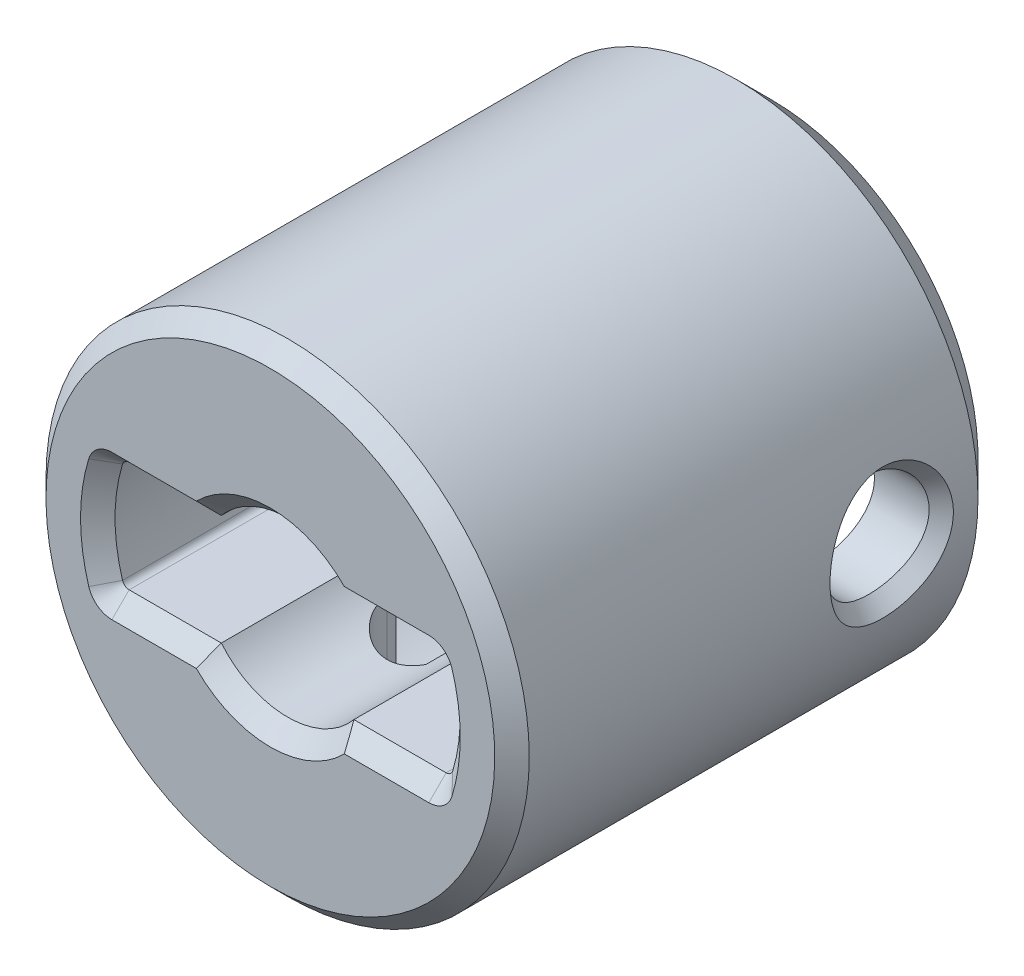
ISO-10303-21;
HEADER;
FILE_DESCRIPTION(('STEP AP214'),'2;1');
FILE_NAME('part.step','',(''),(''),'','','');
FILE_SCHEMA(('AUTOMOTIVE_DESIGN { 1 0 10303 214 1 1 1 1 }'));
ENDSEC;
DATA;
#1=APPLICATION_CONTEXT('core data for automotive mechanical design processes');
#2=APPLICATION_PROTOCOL_DEFINITION('international standard','automotive_design',2000,#1);
#3=PRODUCT_CONTEXT('',#1,'mechanical');
#4=PRODUCT('Part','Part','',(#3));
#5=PRODUCT_RELATED_PRODUCT_CATEGORY('part','',(#4));
#6=PRODUCT_DEFINITION_FORMATION('','',#4);
#7=PRODUCT_DEFINITION_CONTEXT('part definition',#1,'design');
#8=PRODUCT_DEFINITION('design','',#6,#7);
#9=PRODUCT_DEFINITION_SHAPE('','',#8);
#10=(LENGTH_UNIT() NAMED_UNIT(*) SI_UNIT(.MILLI.,.METRE.));
#11=(NAMED_UNIT(*) PLANE_ANGLE_UNIT() SI_UNIT($,.RADIAN.));
#12=(NAMED_UNIT(*) SI_UNIT($,.STERADIAN.) SOLID_ANGLE_UNIT());
#13=UNCERTAINTY_MEASURE_WITH_UNIT(LENGTH_MEASURE(1.E-05),#10,'distance_accuracy_value','');
#14=(GEOMETRIC_REPRESENTATION_CONTEXT(3) GLOBAL_UNCERTAINTY_ASSIGNED_CONTEXT((#13)) GLOBAL_UNIT_ASSIGNED_CONTEXT((#10,
#11,#12)) REPRESENTATION_CONTEXT('',''));
#15=CARTESIAN_POINT('',(0.,0.,0.));
#16=DIRECTION('',(0.,0.,1.));
#17=DIRECTION('',(1.,0.,0.));
#18=AXIS2_PLACEMENT_3D('',#15,#16,#17);
#19=CARTESIAN_POINT('',(0.,0.,-0.5));
#20=DIRECTION('',(0.,0.,1.));
#21=DIRECTION('',(0.,-1.,0.));
#22=AXIS2_PLACEMENT_3D('',#19,#20,#21);
#23=CONICAL_SURFACE('',#22,2.5,0.785398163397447);
#24=CARTESIAN_POINT('',(0.,0.,0.));
#25=DIRECTION('',(0.,0.,1.));
#26=DIRECTION('',(0.,-1.,0.));
#27=AXIS2_PLACEMENT_3D('',#24,#25,#26);
#28=CIRCLE('',#27,3.);
#29=CARTESIAN_POINT('',(2.14242852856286,-2.1,0.));
#30=VERTEX_POINT('',#29);
#31=CARTESIAN_POINT('',(-2.14242852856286,-2.1,0.));
#32=VERTEX_POINT('',#31);
#33=EDGE_CURVE('E419',#30,#32,#28,.F.);
#34=ORIENTED_EDGE('',*,*,#33,.F.);
#35=CARTESIAN_POINT('',(2.14242852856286,-2.1,0.));
#36=CARTESIAN_POINT('',(2.12484409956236,-2.05814213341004,-0.0418578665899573));
#37=CARTESIAN_POINT('',(2.10706179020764,-2.01632566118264,-0.0836743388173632));
#38=CARTESIAN_POINT('',(2.07107243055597,-1.93278699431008,-0.16721300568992));
#39=CARTESIAN_POINT('',(2.05286540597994,-1.89106479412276,-0.208935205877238));
#40=CARTESIAN_POINT('',(2.01599527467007,-1.80772054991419,-0.29227945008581));
#41=CARTESIAN_POINT('',(1.99733216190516,-1.76609850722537,-0.333901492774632));
#42=CARTESIAN_POINT('',(1.95951308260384,-1.68296379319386,-0.417036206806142));
#43=CARTESIAN_POINT('',(1.94035708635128,-1.64145112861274,-0.458548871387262));
#44=CARTESIAN_POINT('',(1.92093727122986,-1.6,-0.5));
#45=B_SPLINE_CURVE_WITH_KNOTS('',3,(#35,#36,#37,#38,#39,#40,#41,#42,#43,#44),.UNSPECIFIED.,.F.,
.F.,(4,2,2,2,4),(0.,0.185257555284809,0.37050392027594,0.555752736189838,0.741012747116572),.UNSPECIFIED.);
#46=CARTESIAN_POINT('',(1.92093727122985,-1.6,-0.5));
#47=VERTEX_POINT('',#46);
#48=EDGE_CURVE('E568',#30,#47,#45,.T.);
#49=ORIENTED_EDGE('',*,*,#48,.T.);
#50=CARTESIAN_POINT('',(0.,0.,-0.5));
#51=DIRECTION('',(0.,0.,1.));
#52=DIRECTION('',(0.,-1.,0.));
#53=AXIS2_PLACEMENT_3D('',#50,#51,#52);
#54=CIRCLE('',#53,2.5);
#55=CARTESIAN_POINT('',(-1.92093727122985,-1.6,-0.5));
#56=VERTEX_POINT('',#55);
#57=EDGE_CURVE('E356',#56,#47,#54,.T.);
#58=ORIENTED_EDGE('',*,*,#57,.F.);
#59=CARTESIAN_POINT('',(-1.92093727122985,-1.6,-0.5));
#60=CARTESIAN_POINT('',(-1.94035708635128,-1.64145112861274,-0.458548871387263));
#61=CARTESIAN_POINT('',(-1.95951308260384,-1.68296379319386,-0.417036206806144));
#62=CARTESIAN_POINT('',(-1.99733216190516,-1.76609850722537,-0.333901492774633));
#63=CARTESIAN_POINT('',(-2.01599527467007,-1.80772054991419,-0.292279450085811));
#64=CARTESIAN_POINT('',(-2.05286540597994,-1.89106479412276,-0.208935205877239));
#65=CARTESIAN_POINT('',(-2.07107243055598,-1.93278699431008,-0.167213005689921));
#66=CARTESIAN_POINT('',(-2.10706179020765,-2.01632566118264,-0.0836743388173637));
#67=CARTESIAN_POINT('',(-2.12484409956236,-2.05814213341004,-0.0418578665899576));
#68=CARTESIAN_POINT('',(-2.14242852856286,-2.1,0.));
#69=B_SPLINE_CURVE_WITH_KNOTS('',3,(#59,#60,#61,#62,#63,#64,#65,#66,#67,#68),.UNSPECIFIED.,.F.,
.F.,(4,2,2,2,4),(0.,0.185260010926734,0.370508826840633,0.555755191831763,0.741012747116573),.UNSPECIFIED.);
#70=EDGE_CURVE('E561',#56,#32,#69,.T.);
#71=ORIENTED_EDGE('',*,*,#70,.T.);
#72=EDGE_LOOP('',(#34,#49,#58,#71));
#73=FACE_BOUND('',#72,.T.);
#74=ADVANCED_FACE('F14',(#73),#23,.F.);
#75=CARTESIAN_POINT('',(-4.73708771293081,-1.6,-0.5));
#76=DIRECTION('',(0.,0.707106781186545,0.70710678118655));
#77=DIRECTION('',(0.,-0.70710678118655,0.707106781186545));
#78=AXIS2_PLACEMENT_3D('',#75,#76,#77);
#79=PLANE('',#78);
#80=ORIENTED_EDGE('',*,*,#48,.F.);
#81=DIRECTION('',(-1.,0.,0.));
#82=VECTOR('',#81,1.);
#83=CARTESIAN_POINT('',(2.53771550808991,-2.1,0.));
#84=LINE('',#83,#82);
#85=CARTESIAN_POINT('',(4.5912961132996,-2.1,0.));
#86=VERTEX_POINT('',#85);
#87=EDGE_CURVE('E1080',#86,#30,#84,.T.);
#88=ORIENTED_EDGE('',*,*,#87,.F.);
#89=DIRECTION('',(0.,-0.70710678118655,0.707106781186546));
#90=VECTOR('',#89,1.);
#91=CARTESIAN_POINT('',(4.5912961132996,-1.6,-0.5));
#92=LINE('',#91,#90);
#93=CARTESIAN_POINT('',(4.5912961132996,-1.6,-0.5));
#94=VERTEX_POINT('',#93);
#95=EDGE_CURVE('E698',#94,#86,#92,.T.);
#96=ORIENTED_EDGE('',*,*,#95,.F.);
#97=DIRECTION('',(1.,0.,0.));
#98=VECTOR('',#97,1.);
#99=CARTESIAN_POINT('',(4.5912961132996,-1.6,-0.5));
#100=LINE('',#99,#98);
#101=EDGE_CURVE('E569',#47,#94,#100,.T.);
#102=ORIENTED_EDGE('',*,*,#101,.F.);
#103=EDGE_LOOP('',(#80,#88,#96,#102));
#104=FACE_BOUND('',#103,.T.);
#105=ADVANCED_FACE('F536',(#104),#79,.T.);
#106=CARTESIAN_POINT('',(-4.73708771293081,1.6,-0.5));
#107=DIRECTION('',(0.,-0.707106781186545,0.70710678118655));
#108=DIRECTION('',(0.,-0.70710678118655,-0.707106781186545));
#109=AXIS2_PLACEMENT_3D('',#106,#107,#108);
#110=PLANE('',#109);
#111=DIRECTION('',(0.,0.70710678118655,0.707106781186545));
#112=VECTOR('',#111,1.);
#113=CARTESIAN_POINT('',(4.5912961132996,1.6,-0.5));
#114=LINE('',#113,#112);
#115=CARTESIAN_POINT('',(4.5912961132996,1.6,-0.5));
#116=VERTEX_POINT('',#115);
#117=CARTESIAN_POINT('',(4.5912961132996,2.1,0.));
#118=VERTEX_POINT('',#117);
#119=EDGE_CURVE('E703',#116,#118,#114,.T.);
#120=ORIENTED_EDGE('',*,*,#119,.T.);
#121=DIRECTION('',(1.,0.,0.));
#122=VECTOR('',#121,1.);
#123=CARTESIAN_POINT('',(4.5912961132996,2.1,0.));
#124=LINE('',#123,#122);
#125=CARTESIAN_POINT('',(2.14242852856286,2.1,0.));
#126=VERTEX_POINT('',#125);
#127=EDGE_CURVE('E1087',#126,#118,#124,.T.);
#128=ORIENTED_EDGE('',*,*,#127,.F.);
#129=CARTESIAN_POINT('',(1.92093727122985,1.6,-0.5));
#130=CARTESIAN_POINT('',(1.94035708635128,1.64145112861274,-0.458548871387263));
#131=CARTESIAN_POINT('',(1.95951308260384,1.68296379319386,-0.417036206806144));
#132=CARTESIAN_POINT('',(1.99733216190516,1.76609850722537,-0.333901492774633));
#133=CARTESIAN_POINT('',(2.01599527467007,1.80772054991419,-0.292279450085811));
#134=CARTESIAN_POINT('',(2.05286540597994,1.89106479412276,-0.208935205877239));
#135=CARTESIAN_POINT('',(2.07107243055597,1.93278699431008,-0.16721300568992));
#136=CARTESIAN_POINT('',(2.10706179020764,2.01632566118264,-0.0836743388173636));
#137=CARTESIAN_POINT('',(2.12484409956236,2.05814213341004,-0.0418578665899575));
#138=CARTESIAN_POINT('',(2.14242852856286,2.1,0.));
#139=B_SPLINE_CURVE_WITH_KNOTS('',3,(#129,#130,#131,#132,#133,#134,#135,#136,#137,#138),
.UNSPECIFIED.,.F.,.F.,(4,2,2,2,4),(0.,0.185260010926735,0.370508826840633,0.555755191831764,
0.741012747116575),.UNSPECIFIED.);
#140=CARTESIAN_POINT('',(1.92093727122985,1.6,-0.5));
#141=VERTEX_POINT('',#140);
#142=EDGE_CURVE('E501',#141,#126,#139,.T.);
#143=ORIENTED_EDGE('',*,*,#142,.F.);
#144=DIRECTION('',(-1.,0.,0.));
#145=VECTOR('',#144,1.);
#146=CARTESIAN_POINT('',(2.53771550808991,1.6,-0.5));
#147=LINE('',#146,#145);
#148=EDGE_CURVE('E496',#116,#141,#147,.T.);
#149=ORIENTED_EDGE('',*,*,#148,.F.);
#150=EDGE_LOOP('',(#120,#128,#143,#149));
#151=FACE_BOUND('',#150,.T.);
#152=ADVANCED_FACE('F555',(#151),#110,.T.);
#153=CARTESIAN_POINT('',(-4.73708771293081,-1.6,-0.5));
#154=DIRECTION('',(0.,0.707106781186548,0.707106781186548));
#155=DIRECTION('',(0.,-0.707106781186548,0.707106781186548));
#156=AXIS2_PLACEMENT_3D('',#153,#154,#155);
#157=PLANE('',#156);
#158=ORIENTED_EDGE('',*,*,#70,.F.);
#159=DIRECTION('',(1.,0.,0.));
#160=VECTOR('',#159,1.);
#161=CARTESIAN_POINT('',(-2.53771550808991,-1.6,-0.5));
#162=LINE('',#161,#160);
#163=CARTESIAN_POINT('',(-4.5912961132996,-1.6,-0.5));
#164=VERTEX_POINT('',#163);
#165=EDGE_CURVE('E1060',#164,#56,#162,.T.);
#166=ORIENTED_EDGE('',*,*,#165,.F.);
#167=DIRECTION('',(0.,0.707106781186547,-0.707106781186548));
#168=VECTOR('',#167,1.);
#169=CARTESIAN_POINT('',(-4.5912961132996,-2.1,0.));
#170=LINE('',#169,#168);
#171=CARTESIAN_POINT('',(-4.5912961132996,-2.1,0.));
#172=VERTEX_POINT('',#171);
#173=EDGE_CURVE('E714',#172,#164,#170,.T.);
#174=ORIENTED_EDGE('',*,*,#173,.F.);
#175=DIRECTION('',(-1.,0.,0.));
#176=VECTOR('',#175,1.);
#177=CARTESIAN_POINT('',(-4.5912961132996,-2.1,0.));
#178=LINE('',#177,#176);
#179=EDGE_CURVE('E508',#32,#172,#178,.T.);
#180=ORIENTED_EDGE('',*,*,#179,.F.);
#181=EDGE_LOOP('',(#158,#166,#174,#180));
#182=FACE_BOUND('',#181,.T.);
#183=ADVANCED_FACE('F533',(#182),#157,.T.);
#184=CARTESIAN_POINT('',(-4.73708771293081,1.6,-0.5));
#185=DIRECTION('',(0.,-0.707106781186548,0.707106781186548));
#186=DIRECTION('',(0.,-0.707106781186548,-0.707106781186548));
#187=AXIS2_PLACEMENT_3D('',#184,#185,#186);
#188=PLANE('',#187);
#189=CARTESIAN_POINT('',(-2.14242852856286,2.1,0.));
#190=CARTESIAN_POINT('',(-2.12484409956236,2.05814213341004,-0.0418578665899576));
#191=CARTESIAN_POINT('',(-2.10706179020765,2.01632566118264,-0.0836743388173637));
#192=CARTESIAN_POINT('',(-2.07107243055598,1.93278699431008,-0.167213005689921));
#193=CARTESIAN_POINT('',(-2.05286540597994,1.89106479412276,-0.208935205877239));
#194=CARTESIAN_POINT('',(-2.01599527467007,1.80772054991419,-0.292279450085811));
#195=CARTESIAN_POINT('',(-1.99733216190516,1.76609850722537,-0.333901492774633));
#196=CARTESIAN_POINT('',(-1.95951308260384,1.68296379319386,-0.417036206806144));
#197=CARTESIAN_POINT('',(-1.94035708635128,1.64145112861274,-0.458548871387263));
#198=CARTESIAN_POINT('',(-1.92093727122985,1.6,-0.5));
#199=B_SPLINE_CURVE_WITH_KNOTS('',3,(#189,#190,#191,#192,#193,#194,#195,#196,#197,#198),
.UNSPECIFIED.,.F.,.F.,(4,2,2,2,4),(0.,0.18525755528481,0.370503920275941,0.555752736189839,
0.741012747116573),.UNSPECIFIED.);
#200=CARTESIAN_POINT('',(-2.14242852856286,2.1,0.));
#201=VERTEX_POINT('',#200);
#202=CARTESIAN_POINT('',(-1.92093727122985,1.6,-0.5));
#203=VERTEX_POINT('',#202);
#204=EDGE_CURVE('E503',#201,#203,#199,.T.);
#205=ORIENTED_EDGE('',*,*,#204,.F.);
#206=DIRECTION('',(1.,0.,0.));
#207=VECTOR('',#206,1.);
#208=CARTESIAN_POINT('',(-2.53771550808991,2.1,0.));
#209=LINE('',#208,#207);
#210=CARTESIAN_POINT('',(-4.5912961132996,2.1,0.));
#211=VERTEX_POINT('',#210);
#212=EDGE_CURVE('E1078',#211,#201,#209,.T.);
#213=ORIENTED_EDGE('',*,*,#212,.F.);
#214=DIRECTION('',(0.,-0.707106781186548,-0.707106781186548));
#215=VECTOR('',#214,1.);
#216=CARTESIAN_POINT('',(-4.5912961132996,2.1,0.));
#217=LINE('',#216,#215);
#218=CARTESIAN_POINT('',(-4.5912961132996,1.6,-0.5));
#219=VERTEX_POINT('',#218);
#220=EDGE_CURVE('E349',#211,#219,#217,.T.);
#221=ORIENTED_EDGE('',*,*,#220,.T.);
#222=DIRECTION('',(-1.,0.,0.));
#223=VECTOR('',#222,1.);
#224=CARTESIAN_POINT('',(-4.5912961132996,1.6,-0.5));
#225=LINE('',#224,#223);
#226=EDGE_CURVE('E649',#203,#219,#225,.T.);
#227=ORIENTED_EDGE('',*,*,#226,.F.);
#228=EDGE_LOOP('',(#205,#213,#221,#227));
#229=FACE_BOUND('',#228,.T.);
#230=ADVANCED_FACE('F528',(#229),#188,.T.);
#231=CARTESIAN_POINT('',(0.,0.,-0.5));
#232=DIRECTION('',(0.,0.,1.));
#233=DIRECTION('',(0.,-1.,0.));
#234=AXIS2_PLACEMENT_3D('',#231,#232,#233);
#235=CONICAL_SURFACE('',#234,2.5,0.785398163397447);
#236=CARTESIAN_POINT('',(0.,0.,-0.5));
#237=DIRECTION('',(0.,0.,1.));
#238=DIRECTION('',(0.,-1.,0.));
#239=AXIS2_PLACEMENT_3D('',#236,#237,#238);
#240=CIRCLE('',#239,2.5);
#241=EDGE_CURVE('E422',#141,#203,#240,.T.);
#242=ORIENTED_EDGE('',*,*,#241,.F.);
#243=ORIENTED_EDGE('',*,*,#142,.T.);
#244=CARTESIAN_POINT('',(0.,0.,0.));
#245=DIRECTION('',(0.,0.,1.));
#246=DIRECTION('',(0.,-1.,0.));
#247=AXIS2_PLACEMENT_3D('',#244,#245,#246);
#248=CIRCLE('',#247,3.);
#249=EDGE_CURVE('E416',#201,#126,#248,.F.);
#250=ORIENTED_EDGE('',*,*,#249,.F.);
#251=ORIENTED_EDGE('',*,*,#204,.T.);
#252=EDGE_LOOP('',(#242,#243,#250,#251));
#253=FACE_BOUND('',#252,.T.);
#254=ADVANCED_FACE('F499',(#253),#235,.F.);
#255=CARTESIAN_POINT('',(-4.73708771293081,1.6,-4.884875));
#256=DIRECTION('',(0.,1.,0.));
#257=DIRECTION('',(-1.,0.,0.));
#258=AXIS2_PLACEMENT_3D('',#255,#256,#257);
#259=PLANE('',#258);
#260=DIRECTION('',(0.,0.,-1.));
#261=VECTOR('',#260,1.);
#262=CARTESIAN_POINT('',(4.5912961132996,1.6,0.));
#263=LINE('',#262,#261);
#264=CARTESIAN_POINT('',(4.5912961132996,1.6,-4.884875));
#265=VERTEX_POINT('',#264);
#266=EDGE_CURVE('E432',#265,#116,#263,.F.);
#267=ORIENTED_EDGE('',*,*,#266,.T.);
#268=ORIENTED_EDGE('',*,*,#148,.T.);
#269=DIRECTION('',(0.,0.,1.));
#270=VECTOR('',#269,1.);
#271=CARTESIAN_POINT('',(1.92093727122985,1.6,-10.));
#272=LINE('',#271,#270);
#273=CARTESIAN_POINT('',(1.92093727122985,1.6,-4.884875));
#274=VERTEX_POINT('',#273);
#275=EDGE_CURVE('E397',#274,#141,#272,.T.);
#276=ORIENTED_EDGE('',*,*,#275,.F.);
#277=DIRECTION('',(-1.,0.,0.));
#278=VECTOR('',#277,1.);
#279=CARTESIAN_POINT('',(-4.73708771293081,1.6,-4.884875));
#280=LINE('',#279,#278);
#281=EDGE_CURVE('E393',#265,#274,#280,.T.);
#282=ORIENTED_EDGE('',*,*,#281,.F.);
#283=EDGE_LOOP('',(#267,#268,#276,#282));
#284=FACE_BOUND('',#283,.T.);
#285=ADVANCED_FACE('F462',(#284),#259,.F.);
#286=CARTESIAN_POINT('',(4.5912961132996,1.4,0.));
#287=DIRECTION('',(0.,0.,1.));
#288=DIRECTION('',(0.,-1.,0.));
#289=AXIS2_PLACEMENT_3D('',#286,#287,#288);
#290=CONICAL_SURFACE('',#289,0.7,0.785398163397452);
#291=DIRECTION('',(0.676361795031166,0.206239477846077,0.707106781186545));
#292=VECTOR('',#291,1.);
#293=CARTESIAN_POINT('',(4.78260011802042,1.45833333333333,-0.5));
#294=LINE('',#293,#292);
#295=CARTESIAN_POINT('',(4.78260011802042,1.45833333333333,-0.5));
#296=VERTEX_POINT('',#295);
#297=CARTESIAN_POINT('',(5.26086012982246,1.60416666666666,0.));
#298=VERTEX_POINT('',#297);
#299=EDGE_CURVE('E699',#296,#298,#294,.T.);
#300=ORIENTED_EDGE('',*,*,#299,.T.);
#301=CARTESIAN_POINT('',(4.5912961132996,1.4,0.));
#302=DIRECTION('',(0.,0.,1.));
#303=DIRECTION('',(0.,-1.,0.));
#304=AXIS2_PLACEMENT_3D('',#301,#302,#303);
#305=CIRCLE('',#304,0.7);
#306=EDGE_CURVE('E1085',#118,#298,#305,.F.);
#307=ORIENTED_EDGE('',*,*,#306,.F.);
#308=ORIENTED_EDGE('',*,*,#119,.F.);
#309=CARTESIAN_POINT('',(4.5912961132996,1.4,-0.5));
#310=DIRECTION('',(0.,0.,1.));
#311=DIRECTION('',(0.,-1.,0.));
#312=AXIS2_PLACEMENT_3D('',#309,#310,#311);
#313=CIRCLE('',#312,0.2);
#314=EDGE_CURVE('E1089',#296,#116,#313,.T.);
#315=ORIENTED_EDGE('',*,*,#314,.F.);
#316=EDGE_LOOP('',(#300,#307,#308,#315));
#317=FACE_BOUND('',#316,.T.);
#318=ADVANCED_FACE('F635',(#317),#290,.F.);
#319=CARTESIAN_POINT('',(4.5912961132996,-1.4,0.));
#320=DIRECTION('',(0.,0.,1.));
#321=DIRECTION('',(0.,-1.,0.));
#322=AXIS2_PLACEMENT_3D('',#319,#320,#321);
#323=CONICAL_SURFACE('',#322,0.7,0.785398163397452);
#324=ORIENTED_EDGE('',*,*,#95,.T.);
#325=CARTESIAN_POINT('',(4.5912961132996,-1.4,0.));
#326=DIRECTION('',(0.,0.,1.));
#327=DIRECTION('',(0.,-1.,0.));
#328=AXIS2_PLACEMENT_3D('',#325,#326,#327);
#329=CIRCLE('',#328,0.7);
#330=CARTESIAN_POINT('',(5.26086012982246,-1.60416666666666,0.));
#331=VERTEX_POINT('',#330);
#332=EDGE_CURVE('E1082',#331,#86,#329,.F.);
#333=ORIENTED_EDGE('',*,*,#332,.F.);
#334=DIRECTION('',(0.676361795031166,-0.206239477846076,0.707106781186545));
#335=VECTOR('',#334,1.);
#336=CARTESIAN_POINT('',(4.78260011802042,-1.45833333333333,-0.5));
#337=LINE('',#336,#335);
#338=CARTESIAN_POINT('',(4.78260011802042,-1.45833333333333,-0.5));
#339=VERTEX_POINT('',#338);
#340=EDGE_CURVE('E691',#339,#331,#337,.T.);
#341=ORIENTED_EDGE('',*,*,#340,.F.);
#342=CARTESIAN_POINT('',(4.5912961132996,-1.4,-0.5));
#343=DIRECTION('',(0.,0.,1.));
#344=DIRECTION('',(0.,-1.,0.));
#345=AXIS2_PLACEMENT_3D('',#342,#343,#344);
#346=CIRCLE('',#345,0.2);
#347=EDGE_CURVE('E1093',#94,#339,#346,.T.);
#348=ORIENTED_EDGE('',*,*,#347,.F.);
#349=EDGE_LOOP('',(#324,#333,#341,#348));
#350=FACE_BOUND('',#349,.T.);
#351=ADVANCED_FACE('F640',(#350),#323,.F.);
#352=CARTESIAN_POINT('',(-4.73708771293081,-1.6,-4.884875));
#353=DIRECTION('',(0.,-1.,0.));
#354=DIRECTION('',(1.,0.,0.));
#355=AXIS2_PLACEMENT_3D('',#352,#353,#354);
#356=PLANE('',#355);
#357=DIRECTION('',(1.,-1.72961820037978E-13,0.));
#358=VECTOR('',#357,1.);
#359=CARTESIAN_POINT('',(1.92093727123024,-1.59999999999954,-4.884875));
#360=LINE('',#359,#358);
#361=CARTESIAN_POINT('',(1.92093727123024,-1.59999999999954,-4.884875));
#362=VERTEX_POINT('',#361);
#363=CARTESIAN_POINT('',(4.5912961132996,-1.6,-4.884875));
#364=VERTEX_POINT('',#363);
#365=EDGE_CURVE('E318',#362,#364,#360,.T.);
#366=ORIENTED_EDGE('',*,*,#365,.F.);
#367=DIRECTION('',(0.,0.,1.));
#368=VECTOR('',#367,1.);
#369=CARTESIAN_POINT('',(1.92093727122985,-1.6,-10.));
#370=LINE('',#369,#368);
#371=EDGE_CURVE('E353',#47,#362,#370,.F.);
#372=ORIENTED_EDGE('',*,*,#371,.F.);
#373=ORIENTED_EDGE('',*,*,#101,.T.);
#374=DIRECTION('',(0.,0.,-1.));
#375=VECTOR('',#374,1.);
#376=CARTESIAN_POINT('',(4.5912961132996,-1.6,-2.88774987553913));
#377=LINE('',#376,#375);
#378=EDGE_CURVE('E369',#94,#364,#377,.T.);
#379=ORIENTED_EDGE('',*,*,#378,.T.);
#380=EDGE_LOOP('',(#366,#372,#373,#379));
#381=FACE_BOUND('',#380,.T.);
#382=ADVANCED_FACE('F631',(#381),#356,.F.);
#383=CARTESIAN_POINT('',(0.,0.,-10.));
#384=DIRECTION('',(0.,0.,1.));
#385=DIRECTION('',(0.,-1.,0.));
#386=AXIS2_PLACEMENT_3D('',#383,#384,#385);
#387=CYLINDRICAL_SURFACE('',#386,2.5);
#388=DIRECTION('',(0.,0.,-1.));
#389=VECTOR('',#388,1.);
#390=CARTESIAN_POINT('',(0.819377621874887,-2.36191031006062,-1.884875));
#391=LINE('',#390,#389);
#392=CARTESIAN_POINT('',(0.819377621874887,-2.36191031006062,-3.69100830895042));
#393=VERTEX_POINT('',#392);
#394=CARTESIAN_POINT('',(0.819377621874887,-2.36191031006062,-4.884875));
#395=VERTEX_POINT('',#394);
#396=EDGE_CURVE('E324',#393,#395,#391,.T.);
#397=ORIENTED_EDGE('',*,*,#396,.F.);
#398=CARTESIAN_POINT('',(-1.25,-2.1650635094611,-4.635));
#399=CARTESIAN_POINT('',(-1.25000243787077,-2.16505700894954,-4.60225494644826));
#400=CARTESIAN_POINT('',(-1.24871248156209,-2.16580729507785,-4.56952849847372));
#401=CARTESIAN_POINT('',(-1.24358381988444,-2.16875832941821,-4.50436146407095));
#402=CARTESIAN_POINT('',(-1.23974668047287,-2.17095818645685,-4.47192071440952));
#403=CARTESIAN_POINT('',(-1.22453317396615,-2.17960088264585,-4.37576316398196));
#404=CARTESIAN_POINT('',(-1.20945360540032,-2.18808852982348,-4.3127739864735));
#405=CARTESIAN_POINT('',(-1.1701396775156,-2.20935798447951,-4.19071718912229));
#406=CARTESIAN_POINT('',(-1.14592393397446,-2.22213105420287,-4.13164188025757));
#407=CARTESIAN_POINT('',(-1.08913344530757,-2.25051005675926,-4.01830520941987));
#408=CARTESIAN_POINT('',(-1.056545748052,-2.26612036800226,-3.96405148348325));
#409=CARTESIAN_POINT('',(-0.980828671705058,-2.29996280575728,-3.85711031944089));
#410=CARTESIAN_POINT('',(-0.937055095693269,-2.31830494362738,-3.8049139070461));
#411=CARTESIAN_POINT('',(-0.841555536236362,-2.35465388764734,-3.70822974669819));
#412=CARTESIAN_POINT('',(-0.789827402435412,-2.37266060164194,-3.66374409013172));
#413=CARTESIAN_POINT('',(-0.675612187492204,-2.40776838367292,-3.58079113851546));
#414=CARTESIAN_POINT('',(-0.612634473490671,-2.42472619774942,-3.54293305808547));
#415=CARTESIAN_POINT('',(-0.480196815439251,-2.45438435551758,-3.47857416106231));
#416=CARTESIAN_POINT('',(-0.410740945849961,-2.4670873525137,-3.45206626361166));
#417=CARTESIAN_POINT('',(-0.272556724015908,-2.4860056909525,-3.41311932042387));
#418=CARTESIAN_POINT('',(-0.204128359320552,-2.49261839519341,-3.39981330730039));
#419=CARTESIAN_POINT('',(-0.0657144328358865,-2.50009478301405,-3.38479238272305));
#420=CARTESIAN_POINT('',(0.00427018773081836,-2.50096185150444,-3.38307064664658));
#421=CARTESIAN_POINT('',(0.137291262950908,-2.49703725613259,-3.39093337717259));
#422=CARTESIAN_POINT('',(0.200402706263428,-2.49273111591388,-3.39954768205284));
#423=CARTESIAN_POINT('',(0.324143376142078,-2.47967789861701,-3.42610140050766));
#424=CARTESIAN_POINT('',(0.384772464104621,-2.47093057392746,-3.4440413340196));
#425=CARTESIAN_POINT('',(0.502886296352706,-2.44964487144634,-3.48885303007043));
#426=CARTESIAN_POINT('',(0.560315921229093,-2.43705570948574,-3.51584495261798));
#427=CARTESIAN_POINT('',(0.669970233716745,-2.4092207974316,-3.5778287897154));
#428=CARTESIAN_POINT('',(0.72219297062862,-2.39397405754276,-3.61282368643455));
#429=CARTESIAN_POINT('',(0.825213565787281,-2.36055607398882,-3.69361630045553));
#430=CARTESIAN_POINT('',(0.875410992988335,-2.34224462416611,-3.74012215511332));
#431=CARTESIAN_POINT('',(0.967625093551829,-2.30568157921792,-3.84073072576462));
#432=CARTESIAN_POINT('',(1.0096344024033,-2.28743005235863,-3.89484020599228));
#433=CARTESIAN_POINT('',(1.08690857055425,-2.25178956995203,-4.01334965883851));
#434=CARTESIAN_POINT('',(1.12156774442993,-2.23453109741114,-4.07818713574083));
#435=CARTESIAN_POINT('',(1.1791819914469,-2.20467498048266,-4.21377873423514));
#436=CARTESIAN_POINT('',(1.20216510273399,-2.19206619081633,-4.2845182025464));
#437=CARTESIAN_POINT('',(1.22904514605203,-2.17706007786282,-4.40238864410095));
#438=CARTESIAN_POINT('',(1.23686948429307,-2.17260571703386,-4.44839122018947));
#439=CARTESIAN_POINT('',(1.24736007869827,-2.16658814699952,-4.54124558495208));
#440=CARTESIAN_POINT('',(1.25001722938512,-2.16503004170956,-4.58809872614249));
#441=CARTESIAN_POINT('',(1.25,-2.1650635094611,-4.635));
#442=B_SPLINE_CURVE_WITH_KNOTS('',3,(#398,#399,#400,#401,#402,#403,#404,#405,#406,#407,#408,
#409,#410,#411,#412,#413,#414,#415,#416,#417,#418,#419,#420,#421,#422,#423,#424,#425,#426,#427,
#428,#429,#430,#431,#432,#433,#434,#435,#436,#437,#438,#439,#440,#441),.UNSPECIFIED.,.F.,.F.,(4,
2,2,2,2,2,2,2,2,2,2,2,2,2,2,2,2,2,2,2,2,4),(0.,0.0981657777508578,0.196271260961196,
0.391189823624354,0.585713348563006,0.780539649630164,0.991300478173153,1.2021183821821,
1.42717153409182,1.65208408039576,1.86099060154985,2.06977403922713,2.26040177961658,
2.45104014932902,2.64431649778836,2.83766498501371,3.04927493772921,3.26107434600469,
3.48646332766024,3.71130848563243,3.8515789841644,3.99209644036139),.UNSPECIFIED.);
#443=CARTESIAN_POINT('',(-1.25,-2.1650635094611,-4.635));
#444=VERTEX_POINT('',#443);
#445=EDGE_CURVE('E360',#444,#393,#442,.T.);
#446=ORIENTED_EDGE('',*,*,#445,.F.);
#447=DIRECTION('',(0.,0.,1.));
#448=VECTOR('',#447,1.);
#449=CARTESIAN_POINT('',(-1.25,-2.1650635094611,-10.));
#450=LINE('',#449,#448);
#451=CARTESIAN_POINT('',(-1.25,-2.1650635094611,-4.884875));
#452=VERTEX_POINT('',#451);
#453=EDGE_CURVE('E1113',#452,#444,#450,.T.);
#454=ORIENTED_EDGE('',*,*,#453,.F.);
#455=CARTESIAN_POINT('',(0.,0.,-4.884875));
#456=DIRECTION('',(0.,0.,1.));
#457=DIRECTION('',(1.,0.,0.));
#458=AXIS2_PLACEMENT_3D('',#455,#456,#457);
#459=CIRCLE('',#458,2.5);
#460=CARTESIAN_POINT('',(-1.92093727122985,-1.6,-4.884875));
#461=VERTEX_POINT('',#460);
#462=EDGE_CURVE('E377',#461,#452,#459,.T.);
#463=ORIENTED_EDGE('',*,*,#462,.F.);
#464=DIRECTION('',(0.,0.,1.));
#465=VECTOR('',#464,1.);
#466=CARTESIAN_POINT('',(-1.92093727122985,-1.6,-10.));
#467=LINE('',#466,#465);
#468=EDGE_CURVE('E359',#461,#56,#467,.T.);
#469=ORIENTED_EDGE('',*,*,#468,.T.);
#470=ORIENTED_EDGE('',*,*,#57,.T.);
#471=ORIENTED_EDGE('',*,*,#371,.T.);
#472=CARTESIAN_POINT('',(0.,0.,-4.884875));
#473=DIRECTION('',(0.,0.,1.));
#474=DIRECTION('',(1.,0.,0.));
#475=AXIS2_PLACEMENT_3D('',#472,#473,#474);
#476=CIRCLE('',#475,2.5);
#477=EDGE_CURVE('E315',#395,#362,#476,.T.);
#478=ORIENTED_EDGE('',*,*,#477,.F.);
#479=EDGE_LOOP('',(#397,#446,#454,#463,#469,#470,#471,#478));
#480=FACE_BOUND('',#479,.T.);
#481=ADVANCED_FACE('F350',(#480),#387,.F.);
#482=DIRECTION('',(0.,0.,-1.));
#483=VECTOR('',#482,1.);
#484=CARTESIAN_POINT('',(-4.5912961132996,-1.6,0.));
#485=LINE('',#484,#483);
#486=CARTESIAN_POINT('',(-4.5912961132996,-1.6,-4.884875));
#487=VERTEX_POINT('',#486);
#488=EDGE_CURVE('E438',#487,#164,#485,.F.);
#489=ORIENTED_EDGE('',*,*,#488,.T.);
#490=ORIENTED_EDGE('',*,*,#165,.T.);
#491=ORIENTED_EDGE('',*,*,#468,.F.);
#492=DIRECTION('',(1.,0.,0.));
#493=VECTOR('',#492,1.);
#494=CARTESIAN_POINT('',(-4.73708771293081,-1.6,-4.884875));
#495=LINE('',#494,#493);
#496=EDGE_CURVE('E362',#487,#461,#495,.T.);
#497=ORIENTED_EDGE('',*,*,#496,.F.);
#498=EDGE_LOOP('',(#489,#490,#491,#497));
#499=FACE_BOUND('',#498,.T.);
#500=ADVANCED_FACE('F624',(#499),#356,.F.);
#501=CARTESIAN_POINT('',(0.,0.,0.));
#502=DIRECTION('',(0.,0.,1.));
#503=DIRECTION('',(0.,-1.,0.));
#504=AXIS2_PLACEMENT_3D('',#501,#502,#503);
#505=PLANE('',#504);
#506=CARTESIAN_POINT('',(0.,0.,0.));
#507=DIRECTION('',(0.,0.,1.));
#508=DIRECTION('',(0.,-1.,0.));
#509=AXIS2_PLACEMENT_3D('',#506,#507,#508);
#510=CIRCLE('',#509,6.5);
#511=CARTESIAN_POINT('',(0.,-6.5,0.));
#512=VERTEX_POINT('',#511);
#513=EDGE_CURVE('E24',#512,#512,#510,.T.);
#514=ORIENTED_EDGE('',*,*,#513,.T.);
#515=EDGE_LOOP('',(#514));
#516=FACE_BOUND('',#515,.T.);
#517=ORIENTED_EDGE('',*,*,#249,.T.);
#518=ORIENTED_EDGE('',*,*,#127,.T.);
#519=ORIENTED_EDGE('',*,*,#306,.T.);
#520=CARTESIAN_POINT('',(0.,0.,0.));
#521=DIRECTION('',(0.,0.,1.));
#522=DIRECTION('',(0.,-1.,0.));
#523=AXIS2_PLACEMENT_3D('',#520,#521,#522);
#524=CIRCLE('',#523,5.5);
#525=EDGE_CURVE('E693',#298,#331,#524,.F.);
#526=ORIENTED_EDGE('',*,*,#525,.T.);
#527=ORIENTED_EDGE('',*,*,#332,.T.);
#528=ORIENTED_EDGE('',*,*,#87,.T.);
#529=ORIENTED_EDGE('',*,*,#33,.T.);
#530=ORIENTED_EDGE('',*,*,#179,.T.);
#531=CARTESIAN_POINT('',(-4.5912961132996,-1.4,0.));
#532=DIRECTION('',(0.,0.,1.));
#533=DIRECTION('',(0.,-1.,0.));
#534=AXIS2_PLACEMENT_3D('',#531,#532,#533);
#535=CIRCLE('',#534,0.7);
#536=CARTESIAN_POINT('',(-5.26086012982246,-1.60416666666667,0.));
#537=VERTEX_POINT('',#536);
#538=EDGE_CURVE('E1070',#172,#537,#535,.F.);
#539=ORIENTED_EDGE('',*,*,#538,.T.);
#540=CARTESIAN_POINT('',(0.,0.,0.));
#541=DIRECTION('',(0.,0.,1.));
#542=DIRECTION('',(0.,-1.,0.));
#543=AXIS2_PLACEMENT_3D('',#540,#541,#542);
#544=CIRCLE('',#543,5.5);
#545=CARTESIAN_POINT('',(-5.26086012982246,1.60416666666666,0.));
#546=VERTEX_POINT('',#545);
#547=EDGE_CURVE('E1072',#537,#546,#544,.F.);
#548=ORIENTED_EDGE('',*,*,#547,.T.);
#549=CARTESIAN_POINT('',(-4.5912961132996,1.4,0.));
#550=DIRECTION('',(0.,0.,1.));
#551=DIRECTION('',(0.,-1.,0.));
#552=AXIS2_PLACEMENT_3D('',#549,#550,#551);
#553=CIRCLE('',#552,0.7);
#554=EDGE_CURVE('E1074',#546,#211,#553,.F.);
#555=ORIENTED_EDGE('',*,*,#554,.T.);
#556=ORIENTED_EDGE('',*,*,#212,.T.);
#557=EDGE_LOOP('',(#517,#518,#519,#526,#527,#528,#529,#530,#539,#548,#555,#556));
#558=FACE_BOUND('',#557,.T.);
#559=ADVANCED_FACE('F550',(#516,#558),#505,.T.);
#560=CARTESIAN_POINT('',(-4.5912961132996,-1.4,0.));
#561=DIRECTION('',(0.,0.,1.));
#562=DIRECTION('',(0.,-1.,0.));
#563=AXIS2_PLACEMENT_3D('',#560,#561,#562);
#564=CONICAL_SURFACE('',#563,0.7,0.785398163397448);
#565=ORIENTED_EDGE('',*,*,#173,.T.);
#566=CARTESIAN_POINT('',(-4.5912961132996,-1.4,-0.5));
#567=DIRECTION('',(0.,0.,1.));
#568=DIRECTION('',(0.,-1.,0.));
#569=AXIS2_PLACEMENT_3D('',#566,#567,#568);
#570=CIRCLE('',#569,0.2);
#571=CARTESIAN_POINT('',(-4.78260011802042,-1.45833333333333,-0.5));
#572=VERTEX_POINT('',#571);
#573=EDGE_CURVE('E1066',#572,#164,#570,.T.);
#574=ORIENTED_EDGE('',*,*,#573,.F.);
#575=DIRECTION('',(0.676361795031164,0.206239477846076,-0.707106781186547));
#576=VECTOR('',#575,1.);
#577=CARTESIAN_POINT('',(-5.26086012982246,-1.60416666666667,0.));
#578=LINE('',#577,#576);
#579=EDGE_CURVE('E711',#537,#572,#578,.T.);
#580=ORIENTED_EDGE('',*,*,#579,.F.);
#581=ORIENTED_EDGE('',*,*,#538,.F.);
#582=EDGE_LOOP('',(#565,#574,#580,#581));
#583=FACE_BOUND('',#582,.T.);
#584=ADVANCED_FACE('F541',(#583),#564,.F.);
#585=CARTESIAN_POINT('',(-4.5912961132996,1.4,0.));
#586=DIRECTION('',(0.,0.,1.));
#587=DIRECTION('',(0.,-1.,0.));
#588=AXIS2_PLACEMENT_3D('',#585,#586,#587);
#589=CONICAL_SURFACE('',#588,0.7,0.785398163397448);
#590=DIRECTION('',(0.676361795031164,-0.206239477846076,-0.707106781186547));
#591=VECTOR('',#590,1.);
#592=CARTESIAN_POINT('',(-5.26086012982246,1.60416666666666,0.));
#593=LINE('',#592,#591);
#594=CARTESIAN_POINT('',(-4.78260011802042,1.45833333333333,-0.5));
#595=VERTEX_POINT('',#594);
#596=EDGE_CURVE('E708',#546,#595,#593,.T.);
#597=ORIENTED_EDGE('',*,*,#596,.T.);
#598=CARTESIAN_POINT('',(-4.5912961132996,1.4,-0.5));
#599=DIRECTION('',(0.,0.,1.));
#600=DIRECTION('',(0.,-1.,0.));
#601=AXIS2_PLACEMENT_3D('',#598,#599,#600);
#602=CIRCLE('',#601,0.2);
#603=EDGE_CURVE('E651',#219,#595,#602,.T.);
#604=ORIENTED_EDGE('',*,*,#603,.F.);
#605=ORIENTED_EDGE('',*,*,#220,.F.);
#606=ORIENTED_EDGE('',*,*,#554,.F.);
#607=EDGE_LOOP('',(#597,#604,#605,#606));
#608=FACE_BOUND('',#607,.T.);
#609=ADVANCED_FACE('F535',(#608),#589,.F.);
#610=DIRECTION('',(0.,0.,-1.));
#611=VECTOR('',#610,1.);
#612=CARTESIAN_POINT('',(-4.5912961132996,1.6,-2.88774987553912));
#613=LINE('',#612,#611);
#614=CARTESIAN_POINT('',(-4.5912961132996,1.6,-4.884875));
#615=VERTEX_POINT('',#614);
#616=EDGE_CURVE('E435',#219,#615,#613,.T.);
#617=ORIENTED_EDGE('',*,*,#616,.T.);
#618=DIRECTION('',(-1.,1.72880617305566E-13,0.));
#619=VECTOR('',#618,1.);
#620=CARTESIAN_POINT('',(-1.92093727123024,1.59999999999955,-4.884875));
#621=LINE('',#620,#619);
#622=CARTESIAN_POINT('',(-1.92093727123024,1.59999999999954,-4.884875));
#623=VERTEX_POINT('',#622);
#624=EDGE_CURVE('E213',#623,#615,#621,.T.);
#625=ORIENTED_EDGE('',*,*,#624,.F.);
#626=DIRECTION('',(0.,0.,1.));
#627=VECTOR('',#626,1.);
#628=CARTESIAN_POINT('',(-1.92093727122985,1.6,-10.));
#629=LINE('',#628,#627);
#630=EDGE_CURVE('E18',#203,#623,#629,.F.);
#631=ORIENTED_EDGE('',*,*,#630,.F.);
#632=ORIENTED_EDGE('',*,*,#226,.T.);
#633=EDGE_LOOP('',(#617,#625,#631,#632));
#634=FACE_BOUND('',#633,.T.);
#635=ADVANCED_FACE('F460',(#634),#259,.F.);
#636=CARTESIAN_POINT('',(0.,0.,-10.));
#637=DIRECTION('',(0.,0.,1.));
#638=DIRECTION('',(0.,-1.,0.));
#639=AXIS2_PLACEMENT_3D('',#636,#637,#638);
#640=CYLINDRICAL_SURFACE('',#639,2.5);
#641=ORIENTED_EDGE('',*,*,#630,.T.);
#642=CARTESIAN_POINT('',(0.,0.,-4.884875));
#643=DIRECTION('',(0.,0.,1.));
#644=DIRECTION('',(1.,0.,0.));
#645=AXIS2_PLACEMENT_3D('',#642,#643,#644);
#646=CIRCLE('',#645,2.5);
#647=CARTESIAN_POINT('',(-0.819377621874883,2.36191031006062,-4.884875));
#648=VERTEX_POINT('',#647);
#649=EDGE_CURVE('E206',#648,#623,#646,.T.);
#650=ORIENTED_EDGE('',*,*,#649,.F.);
#651=DIRECTION('',(0.,0.,-1.));
#652=VECTOR('',#651,1.);
#653=CARTESIAN_POINT('',(-0.819377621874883,2.36191031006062,-1.884875));
#654=LINE('',#653,#652);
#655=CARTESIAN_POINT('',(-0.819377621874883,2.36191031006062,-3.69100830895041));
#656=VERTEX_POINT('',#655);
#657=EDGE_CURVE('E192',#656,#648,#654,.T.);
#658=ORIENTED_EDGE('',*,*,#657,.F.);
#659=CARTESIAN_POINT('',(1.25,2.1650635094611,-4.635));
#660=CARTESIAN_POINT('',(1.25000243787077,2.16505700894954,-4.60225494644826));
#661=CARTESIAN_POINT('',(1.24871248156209,2.16580729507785,-4.56952849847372));
#662=CARTESIAN_POINT('',(1.24358381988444,2.16875832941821,-4.50436146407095));
#663=CARTESIAN_POINT('',(1.23974668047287,2.17095818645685,-4.47192071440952));
#664=CARTESIAN_POINT('',(1.22453317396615,2.17960088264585,-4.37576316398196));
#665=CARTESIAN_POINT('',(1.20945360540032,2.18808852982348,-4.3127739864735));
#666=CARTESIAN_POINT('',(1.1701396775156,2.20935798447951,-4.19071718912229));
#667=CARTESIAN_POINT('',(1.14592393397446,2.22213105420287,-4.13164188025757));
#668=CARTESIAN_POINT('',(1.08913344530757,2.25051005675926,-4.01830520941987));
#669=CARTESIAN_POINT('',(1.056545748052,2.26612036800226,-3.96405148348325));
#670=CARTESIAN_POINT('',(0.980828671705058,2.29996280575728,-3.85711031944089));
#671=CARTESIAN_POINT('',(0.937055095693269,2.31830494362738,-3.8049139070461));
#672=CARTESIAN_POINT('',(0.841555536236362,2.35465388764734,-3.70822974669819));
#673=CARTESIAN_POINT('',(0.789827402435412,2.37266060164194,-3.66374409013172));
#674=CARTESIAN_POINT('',(0.675612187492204,2.40776838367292,-3.58079113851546));
#675=CARTESIAN_POINT('',(0.612634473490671,2.42472619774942,-3.54293305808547));
#676=CARTESIAN_POINT('',(0.480196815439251,2.45438435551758,-3.47857416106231));
#677=CARTESIAN_POINT('',(0.410740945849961,2.4670873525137,-3.45206626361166));
#678=CARTESIAN_POINT('',(0.272556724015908,2.4860056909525,-3.41311932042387));
#679=CARTESIAN_POINT('',(0.204128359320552,2.49261839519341,-3.39981330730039));
#680=CARTESIAN_POINT('',(0.0657144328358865,2.50009478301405,-3.38479238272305));
#681=CARTESIAN_POINT('',(-0.00427018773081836,2.50096185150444,-3.38307064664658));
#682=CARTESIAN_POINT('',(-0.137291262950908,2.49703725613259,-3.39093337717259));
#683=CARTESIAN_POINT('',(-0.200402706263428,2.49273111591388,-3.39954768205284));
#684=CARTESIAN_POINT('',(-0.324143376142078,2.47967789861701,-3.42610140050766));
#685=CARTESIAN_POINT('',(-0.384772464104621,2.47093057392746,-3.4440413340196));
#686=CARTESIAN_POINT('',(-0.502886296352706,2.44964487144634,-3.48885303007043));
#687=CARTESIAN_POINT('',(-0.560315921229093,2.43705570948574,-3.51584495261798));
#688=CARTESIAN_POINT('',(-0.669970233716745,2.4092207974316,-3.5778287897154));
#689=CARTESIAN_POINT('',(-0.72219297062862,2.39397405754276,-3.61282368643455));
#690=CARTESIAN_POINT('',(-0.825213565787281,2.36055607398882,-3.69361630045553));
#691=CARTESIAN_POINT('',(-0.875410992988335,2.34224462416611,-3.74012215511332));
#692=CARTESIAN_POINT('',(-0.967625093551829,2.30568157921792,-3.84073072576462));
#693=CARTESIAN_POINT('',(-1.0096344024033,2.28743005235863,-3.89484020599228));
#694=CARTESIAN_POINT('',(-1.08690857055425,2.25178956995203,-4.01334965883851));
#695=CARTESIAN_POINT('',(-1.12156774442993,2.23453109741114,-4.07818713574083));
#696=CARTESIAN_POINT('',(-1.1791819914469,2.20467498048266,-4.21377873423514));
#697=CARTESIAN_POINT('',(-1.20216510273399,2.19206619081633,-4.2845182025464));
#698=CARTESIAN_POINT('',(-1.22904514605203,2.17706007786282,-4.40238864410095));
#699=CARTESIAN_POINT('',(-1.23686948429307,2.17260571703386,-4.44839122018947));
#700=CARTESIAN_POINT('',(-1.24736007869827,2.16658814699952,-4.54124558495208));
#701=CARTESIAN_POINT('',(-1.25001722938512,2.16503004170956,-4.58809872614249));
#702=CARTESIAN_POINT('',(-1.25,2.1650635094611,-4.635));
#703=B_SPLINE_CURVE_WITH_KNOTS('',3,(#659,#660,#661,#662,#663,#664,#665,#666,#667,#668,#669,
#670,#671,#672,#673,#674,#675,#676,#677,#678,#679,#680,#681,#682,#683,#684,#685,#686,#687,#688,
#689,#690,#691,#692,#693,#694,#695,#696,#697,#698,#699,#700,#701,#702),.UNSPECIFIED.,.F.,.F.,(4,
2,2,2,2,2,2,2,2,2,2,2,2,2,2,2,2,2,2,2,2,4),(0.,0.0981657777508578,0.196271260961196,
0.391189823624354,0.585713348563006,0.780539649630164,0.991300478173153,1.2021183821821,
1.42717153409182,1.65208408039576,1.86099060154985,2.06977403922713,2.26040177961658,
2.45104014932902,2.64431649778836,2.83766498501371,3.04927493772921,3.26107434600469,
3.48646332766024,3.71130848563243,3.8515789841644,3.99209644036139),.UNSPECIFIED.);
#704=CARTESIAN_POINT('',(1.25,2.1650635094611,-4.635));
#705=VERTEX_POINT('',#704);
#706=EDGE_CURVE('E408',#705,#656,#703,.T.);
#707=ORIENTED_EDGE('',*,*,#706,.F.);
#708=DIRECTION('',(0.,0.,1.));
#709=VECTOR('',#708,1.);
#710=CARTESIAN_POINT('',(1.25,2.1650635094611,-10.));
#711=LINE('',#710,#709);
#712=CARTESIAN_POINT('',(1.25,2.1650635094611,-4.884875));
#713=VERTEX_POINT('',#712);
#714=EDGE_CURVE('E406',#713,#705,#711,.T.);
#715=ORIENTED_EDGE('',*,*,#714,.F.);
#716=CARTESIAN_POINT('',(0.,0.,-4.884875));
#717=DIRECTION('',(0.,0.,1.));
#718=DIRECTION('',(1.,0.,0.));
#719=AXIS2_PLACEMENT_3D('',#716,#717,#718);
#720=CIRCLE('',#719,2.5);
#721=EDGE_CURVE('E400',#274,#713,#720,.T.);
#722=ORIENTED_EDGE('',*,*,#721,.F.);
#723=ORIENTED_EDGE('',*,*,#275,.T.);
#724=ORIENTED_EDGE('',*,*,#241,.T.);
#725=EDGE_LOOP('',(#641,#650,#658,#707,#715,#722,#723,#724));
#726=FACE_BOUND('',#725,.T.);
#727=ADVANCED_FACE('F207',(#726),#640,.F.);
#728=CARTESIAN_POINT('',(0.,0.,-13.5));
#729=DIRECTION('',(0.,0.,1.));
#730=DIRECTION('',(0.,-1.,0.));
#731=AXIS2_PLACEMENT_3D('',#728,#729,#730);
#732=CONICAL_SURFACE('',#731,7.,0.785398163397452);
#733=CARTESIAN_POINT('',(0.,0.,-14.5));
#734=DIRECTION('',(0.,0.,1.));
#735=DIRECTION('',(0.,-1.,0.));
#736=AXIS2_PLACEMENT_3D('',#733,#734,#735);
#737=CIRCLE('',#736,6.);
#738=CARTESIAN_POINT('',(0.,-6.,-14.5));
#739=VERTEX_POINT('',#738);
#740=EDGE_CURVE('E412',#739,#739,#737,.F.);
#741=ORIENTED_EDGE('',*,*,#740,.F.);
#742=EDGE_LOOP('',(#741));
#743=FACE_BOUND('',#742,.T.);
#744=CARTESIAN_POINT('',(0.,0.,-13.5));
#745=DIRECTION('',(0.,0.,1.));
#746=DIRECTION('',(0.,-1.,0.));
#747=AXIS2_PLACEMENT_3D('',#744,#745,#746);
#748=CIRCLE('',#747,7.);
#749=CARTESIAN_POINT('',(0.,-7.,-13.5));
#750=VERTEX_POINT('',#749);
#751=EDGE_CURVE('E409',#750,#750,#748,.T.);
#752=ORIENTED_EDGE('',*,*,#751,.F.);
#753=EDGE_LOOP('',(#752));
#754=FACE_BOUND('',#753,.T.);
#755=ADVANCED_FACE('F579',(#743,#754),#732,.T.);
#756=CARTESIAN_POINT('',(0.,0.,0.));
#757=DIRECTION('',(0.,0.,-1.));
#758=DIRECTION('',(0.,1.,0.));
#759=AXIS2_PLACEMENT_3D('',#756,#757,#758);
#760=CONICAL_SURFACE('',#759,6.5,0.785398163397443);
#761=CARTESIAN_POINT('',(0.,0.,-0.500000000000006));
#762=DIRECTION('',(0.,0.,1.));
#763=DIRECTION('',(0.,-1.,0.));
#764=AXIS2_PLACEMENT_3D('',#761,#762,#763);
#765=CIRCLE('',#764,7.);
#766=CARTESIAN_POINT('',(0.,-7.,-0.500000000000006));
#767=VERTEX_POINT('',#766);
#768=EDGE_CURVE('E9',#767,#767,#765,.F.);
#769=ORIENTED_EDGE('',*,*,#768,.F.);
#770=EDGE_LOOP('',(#769));
#771=FACE_BOUND('',#770,.T.);
#772=ORIENTED_EDGE('',*,*,#513,.F.);
#773=EDGE_LOOP('',(#772));
#774=FACE_BOUND('',#773,.T.);
#775=ADVANCED_FACE('F16',(#771,#774),#760,.T.);
#776=CARTESIAN_POINT('',(0.,0.,0.));
#777=DIRECTION('',(0.,0.,1.));
#778=DIRECTION('',(0.,-1.,0.));
#779=AXIS2_PLACEMENT_3D('',#776,#777,#778);
#780=CYLINDRICAL_SURFACE('',#779,7.);
#781=ORIENTED_EDGE('',*,*,#768,.T.);
#782=EDGE_LOOP('',(#781));
#783=FACE_BOUND('',#782,.T.);
#784=CARTESIAN_POINT('',(-7.,0.,-9.2129017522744));
#785=CARTESIAN_POINT('',(-7.00000493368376,0.0312904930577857,-9.21288156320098));
#786=CARTESIAN_POINT('',(-6.99977411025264,0.062580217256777,-9.21361973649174));
#787=CARTESIAN_POINT('',(-6.99886454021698,0.125018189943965,-9.21658861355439));
#788=CARTESIAN_POINT('',(-6.99818671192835,0.156166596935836,-9.21881625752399));
#789=CARTESIAN_POINT('',(-6.99640809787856,0.2182569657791,-9.22473484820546));
#790=CARTESIAN_POINT('',(-6.99530804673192,0.249199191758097,-9.22842325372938));
#791=CARTESIAN_POINT('',(-6.99271012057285,0.310813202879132,-9.23723372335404));
#792=CARTESIAN_POINT('',(-6.99121285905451,0.34148533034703,-9.24235357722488));
#793=CARTESIAN_POINT('',(-6.98784552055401,0.402494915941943,-9.25399765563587));
#794=CARTESIAN_POINT('',(-6.98597598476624,0.432832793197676,-9.26051984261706));
#795=CARTESIAN_POINT('',(-6.98188907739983,0.493109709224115,-9.27493940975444));
#796=CARTESIAN_POINT('',(-6.97967221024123,0.523049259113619,-9.28283479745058));
#797=CARTESIAN_POINT('',(-6.97491558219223,0.582465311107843,-9.29997172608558));
#798=CARTESIAN_POINT('',(-6.97237631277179,0.61194244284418,-9.30921122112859));
#799=CARTESIAN_POINT('',(-6.96699980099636,0.670369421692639,-9.32900741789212));
#800=CARTESIAN_POINT('',(-6.96416305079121,0.699320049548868,-9.33956194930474));
#801=CARTESIAN_POINT('',(-6.95821648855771,0.7566297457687,-9.36195934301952));
#802=CARTESIAN_POINT('',(-6.95510717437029,0.784989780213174,-9.37379986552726));
#803=CARTESIAN_POINT('',(-6.94864038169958,0.841053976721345,-9.3987404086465));
#804=CARTESIAN_POINT('',(-6.94528340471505,0.868759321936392,-9.41183789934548));
#805=CARTESIAN_POINT('',(-6.93834622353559,0.923449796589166,-9.43926357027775));
#806=CARTESIAN_POINT('',(-6.93476651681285,0.950436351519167,-9.4535890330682));
#807=CARTESIAN_POINT('',(-6.92740868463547,1.00362486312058,-9.48344182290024));
#808=CARTESIAN_POINT('',(-6.92363104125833,1.02982850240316,-9.49896626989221));
#809=CARTESIAN_POINT('',(-6.91590266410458,1.08138683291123,-9.53118823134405));
#810=CARTESIAN_POINT('',(-6.91195238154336,1.10674346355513,-9.54788274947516));
#811=CARTESIAN_POINT('',(-6.90390217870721,1.15654325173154,-9.58241581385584));
#812=CARTESIAN_POINT('',(-6.89980266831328,1.18098858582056,-9.6002513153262));
#813=CARTESIAN_POINT('',(-6.89148450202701,1.22890193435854,-9.63703797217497));
#814=CARTESIAN_POINT('',(-6.88726618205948,1.25237231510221,-9.65598611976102));
#815=CARTESIAN_POINT('',(-6.87871478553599,1.29826952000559,-9.69496688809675));
#816=CARTESIAN_POINT('',(-6.87438202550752,1.32069882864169,-9.71499665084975));
#817=CARTESIAN_POINT('',(-6.86570550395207,1.36444543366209,-9.75610879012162));
#818=CARTESIAN_POINT('',(-6.86136180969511,1.38576573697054,-9.77718798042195));
#819=CARTESIAN_POINT('',(-6.85277018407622,1.42725734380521,-9.82033566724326));
#820=CARTESIAN_POINT('',(-6.84852199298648,1.44743207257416,-9.84240081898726));
#821=CARTESIAN_POINT('',(-6.84012851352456,1.48659926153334,-9.88745688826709));
#822=CARTESIAN_POINT('',(-6.83598295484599,1.50559508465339,-9.91044483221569));
#823=CARTESIAN_POINT('',(-6.82782781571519,1.54237355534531,-9.95728575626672));
#824=CARTESIAN_POINT('',(-6.82381787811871,1.56015953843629,-9.98113605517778));
#825=CARTESIAN_POINT('',(-6.81596013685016,1.59448673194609,-10.029640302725));
#826=CARTESIAN_POINT('',(-6.81211191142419,1.61103128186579,-10.054291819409));
#827=CARTESIAN_POINT('',(-6.80460559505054,1.64284415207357,-10.1043373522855));
#828=CARTESIAN_POINT('',(-6.800947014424,1.65811582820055,-10.1297291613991));
#829=CARTESIAN_POINT('',(-6.79384749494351,1.68735143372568,-10.1811940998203));
#830=CARTESIAN_POINT('',(-6.79040600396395,1.70131872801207,-10.2072652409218));
#831=CARTESIAN_POINT('',(-6.78376829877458,1.7279140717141,-10.2600276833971));
#832=CARTESIAN_POINT('',(-6.78057147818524,1.74054546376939,-10.2867172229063));
#833=CARTESIAN_POINT('',(-6.77445070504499,1.76443753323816,-10.3406552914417));
#834=CARTESIAN_POINT('',(-6.77152610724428,1.77570147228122,-10.3679023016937));
#835=CARTESIAN_POINT('',(-6.76597736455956,1.79682722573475,-10.4228941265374));
#836=CARTESIAN_POINT('',(-6.76335255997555,1.80669213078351,-10.4506376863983));
#837=CARTESIAN_POINT('',(-6.75843095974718,1.82498850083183,-10.5065614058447));
#838=CARTESIAN_POINT('',(-6.75613352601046,1.8334227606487,-10.5347405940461));
#839=CARTESIAN_POINT('',(-6.75189418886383,1.84882664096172,-10.5914743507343));
#840=CARTESIAN_POINT('',(-6.74995171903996,1.85579859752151,-10.6200282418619));
#841=CARTESIAN_POINT('',(-6.74644976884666,1.86824688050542,-10.6774501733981));
#842=CARTESIAN_POINT('',(-6.7448898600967,1.87372488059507,-10.7063178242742));
#843=CARTESIAN_POINT('',(-6.74218045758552,1.88315431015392,-10.7643060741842));
#844=CARTESIAN_POINT('',(-6.74103075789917,1.8871065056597,-10.7934265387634));
#845=CARTESIAN_POINT('',(-6.73916897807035,1.89345422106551,-10.8518591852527));
#846=CARTESIAN_POINT('',(-6.73845701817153,1.89584931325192,-10.8811714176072));
#847=CARTESIAN_POINT('',(-6.73749831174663,1.89905081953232,-10.9399267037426));
#848=CARTESIAN_POINT('',(-6.73725213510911,1.89985528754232,-10.9693698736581));
#849=CARTESIAN_POINT('',(-6.73725060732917,1.89985204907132,-11.0282560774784));
#850=CARTESIAN_POINT('',(-6.7374952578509,1.89904433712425,-11.0576991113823));
#851=CARTESIAN_POINT('',(-6.73844831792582,1.89584819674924,-11.1164546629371));
#852=CARTESIAN_POINT('',(-6.73915615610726,1.89346171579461,-11.1457672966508));
#853=CARTESIAN_POINT('',(-6.74100818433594,1.88713860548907,-11.2042016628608));
#854=CARTESIAN_POINT('',(-6.74215224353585,1.88320244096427,-11.233323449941));
#855=CARTESIAN_POINT('',(-6.74484895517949,1.87381235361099,-11.2913157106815));
#856=CARTESIAN_POINT('',(-6.74640179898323,1.86835771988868,-11.320186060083));
#857=CARTESIAN_POINT('',(-6.74988856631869,1.8559621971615,-11.3776151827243));
#858=CARTESIAN_POINT('',(-6.75182290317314,1.84901969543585,-11.4061735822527));
#859=CARTESIAN_POINT('',(-6.75604520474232,1.83367982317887,-11.4629185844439));
#860=CARTESIAN_POINT('',(-6.75833372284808,1.82528017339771,-11.4911045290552));
#861=CARTESIAN_POINT('',(-6.76323702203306,1.80705711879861,-11.5470444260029));
#862=CARTESIAN_POINT('',(-6.76585243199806,1.79723096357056,-11.5747974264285));
#863=CARTESIAN_POINT('',(-6.77138220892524,1.77618583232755,-11.629811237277));
#864=CARTESIAN_POINT('',(-6.77429723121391,1.76496379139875,-11.6570708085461));
#865=CARTESIAN_POINT('',(-6.78039897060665,1.74115766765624,-11.7110375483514));
#866=CARTESIAN_POINT('',(-6.78358633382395,1.72857032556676,-11.7377432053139));
#867=CARTESIAN_POINT('',(-6.79020553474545,1.70206426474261,-11.7905418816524));
#868=CARTESIAN_POINT('',(-6.79363798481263,1.68814217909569,-11.8166331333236));
#869=CARTESIAN_POINT('',(-6.80072012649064,1.65899720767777,-11.868142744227));
#870=CARTESIAN_POINT('',(-6.80437038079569,1.6437709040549,-11.8935590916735));
#871=CARTESIAN_POINT('',(-6.81186104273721,1.61204803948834,-11.9436586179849));
#872=CARTESIAN_POINT('',(-6.81570195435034,1.59554804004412,-11.9683395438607));
#873=CARTESIAN_POINT('',(-6.82354636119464,1.56130822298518,-12.0169079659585));
#874=CARTESIAN_POINT('',(-6.8275502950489,1.54356495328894,-12.0407929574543));
#875=CARTESIAN_POINT('',(-6.83569501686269,1.50686931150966,-12.0877091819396));
#876=CARTESIAN_POINT('',(-6.83983618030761,1.48791346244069,-12.1107376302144));
#877=CARTESIAN_POINT('',(-6.84822275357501,1.448822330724,-12.1558807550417));
#878=CARTESIAN_POINT('',(-6.85246845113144,1.42868351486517,-12.177992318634));
#879=CARTESIAN_POINT('',(-6.86105729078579,1.38726011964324,-12.2212406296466));
#880=CARTESIAN_POINT('',(-6.86540071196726,1.36597192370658,-12.2423738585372));
#881=CARTESIAN_POINT('',(-6.87407857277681,1.32228294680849,-12.2835950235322));
#882=CARTESIAN_POINT('',(-6.87841294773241,1.29987905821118,-12.303679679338));
#883=CARTESIAN_POINT('',(-6.88696871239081,1.25402473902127,-12.3427640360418));
#884=CARTESIAN_POINT('',(-6.89118979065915,1.23057181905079,-12.3617608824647));
#885=CARTESIAN_POINT('',(-6.89951453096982,1.1826875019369,-12.3986405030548));
#886=CARTESIAN_POINT('',(-6.90361786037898,1.15825372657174,-12.4165202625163));
#887=CARTESIAN_POINT('',(-6.9116766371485,1.10847168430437,-12.4511374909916));
#888=CARTESIAN_POINT('',(-6.91563167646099,1.08312122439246,-12.4678718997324));
#889=CARTESIAN_POINT('',(-6.92337039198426,1.03157079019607,-12.5001698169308));
#890=CARTESIAN_POINT('',(-6.92715361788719,1.00536886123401,-12.515730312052));
#891=CARTESIAN_POINT('',(-6.9345233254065,0.952180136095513,-12.5456517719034));
#892=CARTESIAN_POINT('',(-6.93810932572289,0.925191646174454,-12.5600098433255));
#893=CARTESIAN_POINT('',(-6.94505968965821,0.870494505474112,-12.5874977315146));
#894=CARTESIAN_POINT('',(-6.94842355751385,0.842784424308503,-12.6006248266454));
#895=CARTESIAN_POINT('',(-6.95490461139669,0.786708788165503,-12.6256219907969));
#896=CARTESIAN_POINT('',(-6.95802129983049,0.758342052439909,-12.6374895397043));
#897=CARTESIAN_POINT('',(-6.96398297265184,0.70101781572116,-12.6599388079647));
#898=CARTESIAN_POINT('',(-6.96682746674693,0.672059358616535,-12.6705182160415));
#899=CARTESIAN_POINT('',(-6.9722197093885,0.613616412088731,-12.6903623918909));
#900=CARTESIAN_POINT('',(-6.97476697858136,0.584131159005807,-12.6996250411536));
#901=CARTESIAN_POINT('',(-6.97953972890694,0.524699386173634,-12.7168069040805));
#902=CARTESIAN_POINT('',(-6.98176473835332,0.494752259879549,-12.724724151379));
#903=CARTESIAN_POINT('',(-6.9858679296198,0.434461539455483,-12.7391864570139));
#904=CARTESIAN_POINT('',(-6.98774563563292,0.404117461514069,-12.7457296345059));
#905=CARTESIAN_POINT('',(-6.99112919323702,0.343097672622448,-12.7574151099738));
#906=CARTESIAN_POINT('',(-6.99263454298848,0.312421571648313,-12.7625555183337));
#907=CARTESIAN_POINT('',(-6.99524838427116,0.250802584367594,-12.7714068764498));
#908=CARTESIAN_POINT('',(-6.99635631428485,0.2198593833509,-12.7751158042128));
#909=CARTESIAN_POINT('',(-6.99815034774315,0.157771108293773,-12.7810756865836));
#910=CARTESIAN_POINT('',(-6.99883578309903,0.12662579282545,-12.7833243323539));
#911=CARTESIAN_POINT('',(-6.99975990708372,0.0641980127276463,-12.786335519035));
#912=CARTESIAN_POINT('',(-6.99999775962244,0.0329154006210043,-12.7870952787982));
#913=CARTESIAN_POINT('',(-7.00000186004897,-0.0296575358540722,-12.787099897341));
#914=CARTESIAN_POINT('',(-6.99976799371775,-0.0609478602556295,-12.7863443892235));
#915=CARTESIAN_POINT('',(-6.99885201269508,-0.123405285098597,-12.7833414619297));
#916=CARTESIAN_POINT('',(-6.99817053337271,-0.154572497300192,-12.7810961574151));
#917=CARTESIAN_POINT('',(-6.99638453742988,-0.216717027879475,-12.7751434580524));
#918=CARTESIAN_POINT('',(-6.99528052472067,-0.247694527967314,-12.7714378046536));
#919=CARTESIAN_POINT('',(-6.99267459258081,-0.309392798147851,-12.7625937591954));
#920=CARTESIAN_POINT('',(-6.99117310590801,-0.340113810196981,-12.7574569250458));
#921=CARTESIAN_POINT('',(-6.98779730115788,-0.401232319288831,-12.7457797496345));
#922=CARTESIAN_POINT('',(-6.98592338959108,-0.431630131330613,-12.739240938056));
#923=CARTESIAN_POINT('',(-6.98182776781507,-0.492035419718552,-12.7247888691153));
#924=CARTESIAN_POINT('',(-6.97960646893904,-0.522043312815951,-12.7168772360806));
#925=CARTESIAN_POINT('',(-6.97484107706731,-0.581601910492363,-12.699708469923));
#926=CARTESIAN_POINT('',(-6.97229741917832,-0.611153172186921,-12.690453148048));
#927=CARTESIAN_POINT('',(-6.96691229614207,-0.669731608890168,-12.670625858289));
#928=CARTESIAN_POINT('',(-6.96407129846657,-0.698759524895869,-12.6600559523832));
#929=CARTESIAN_POINT('',(-6.95811647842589,-0.756224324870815,-12.6376282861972));
#930=CARTESIAN_POINT('',(-6.9550031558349,-0.784662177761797,-12.6257728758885));
#931=CARTESIAN_POINT('',(-6.94852865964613,-0.840879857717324,-12.6008029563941));
#932=CARTESIAN_POINT('',(-6.94516801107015,-0.868660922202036,-12.5876910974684));
#933=CARTESIAN_POINT('',(-6.93822388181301,-0.923497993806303,-12.5602370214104));
#934=CARTESIAN_POINT('',(-6.93464093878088,-0.950555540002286,-12.5458977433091));
#935=CARTESIAN_POINT('',(-6.92727711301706,-1.00387849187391,-12.5160175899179));
#936=CARTESIAN_POINT('',(-6.92349676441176,-1.03014575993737,-12.5004799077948));
#937=CARTESIAN_POINT('',(-6.91576355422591,-1.08182111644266,-12.4682317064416));
#938=CARTESIAN_POINT('',(-6.91181120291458,-1.10723139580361,-12.4515245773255));
#939=CARTESIAN_POINT('',(-6.90375750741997,-1.15712548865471,-12.4169664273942));
#940=CARTESIAN_POINT('',(-6.8996566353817,-1.18161180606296,-12.3991189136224));
#941=CARTESIAN_POINT('',(-6.89133659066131,-1.22959161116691,-12.3623085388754));
#942=CARTESIAN_POINT('',(-6.88711781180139,-1.2530878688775,-12.3433492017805));
#943=CARTESIAN_POINT('',(-6.87856608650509,-1.29901788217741,-12.3043456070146));
#944=CARTESIAN_POINT('',(-6.87423351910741,-1.32145460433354,-12.2843047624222));
#945=CARTESIAN_POINT('',(-6.86555834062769,-1.36520221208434,-12.2431679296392));
#946=CARTESIAN_POINT('',(-6.86121580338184,-1.3865164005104,-12.2220754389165));
#947=CARTESIAN_POINT('',(-6.85262763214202,-1.42799086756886,-12.1788982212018));
#948=CARTESIAN_POINT('',(-6.84838173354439,-1.4481546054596,-12.1568168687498));
#949=CARTESIAN_POINT('',(-6.83999350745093,-1.48729506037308,-12.1117256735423));
#950=CARTESIAN_POINT('',(-6.83585090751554,-1.50627515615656,-12.0887188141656));
#951=CARTESIAN_POINT('',(-6.8277023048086,-1.54301850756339,-12.0418384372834));
#952=CARTESIAN_POINT('',(-6.82369594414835,-1.56078509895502,-12.0179675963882));
#953=CARTESIAN_POINT('',(-6.81584581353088,-1.59507067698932,-11.9694214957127));
#954=CARTESIAN_POINT('',(-6.8120016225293,-1.61159299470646,-11.9447486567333));
#955=CARTESIAN_POINT('',(-6.80450370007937,-1.64335946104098,-11.8946606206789));
#956=CARTESIAN_POINT('',(-6.80084948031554,-1.65860695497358,-11.8692476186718));
#957=CARTESIAN_POINT('',(-6.79375886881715,-1.6877931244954,-11.8177413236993));
#958=CARTESIAN_POINT('',(-6.79032192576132,-1.70173515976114,-11.791650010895));
#959=CARTESIAN_POINT('',(-6.78369336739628,-1.72827977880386,-11.7388491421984));
#960=CARTESIAN_POINT('',(-6.78050114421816,-1.74088571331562,-11.7121413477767));
#961=CARTESIAN_POINT('',(-6.77438948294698,-1.76472751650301,-11.6581695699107));
#962=CARTESIAN_POINT('',(-6.7714693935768,-1.77596667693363,-11.6309071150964));
#963=CARTESIAN_POINT('',(-6.76592945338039,-1.79704436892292,-11.5758880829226));
#964=CARTESIAN_POINT('',(-6.76330892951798,-1.80688605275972,-11.5481327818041));
#965=CARTESIAN_POINT('',(-6.75839554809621,-1.82513831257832,-11.4921901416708));
#966=CARTESIAN_POINT('',(-6.75610202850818,-1.8335517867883,-11.4640038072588));
#967=CARTESIAN_POINT('',(-6.7518700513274,-1.8489172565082,-11.407261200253));
#968=CARTESIAN_POINT('',(-6.74993098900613,-1.85587174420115,-11.3787056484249));
#969=CARTESIAN_POINT('',(-6.74643526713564,-1.86828905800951,-11.3212867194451));
#970=CARTESIAN_POINT('',(-6.74487812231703,-1.87375377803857,-11.2924237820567));
#971=CARTESIAN_POINT('',(-6.74217353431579,-1.88316144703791,-11.2344521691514));
#972=CARTESIAN_POINT('',(-6.74102580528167,-1.88710545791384,-11.20534367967));
#973=CARTESIAN_POINT('',(-6.73916717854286,-1.89344229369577,-11.1469430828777));
#974=CARTESIAN_POINT('',(-6.7384562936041,-1.89583507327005,-11.1176509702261));
#975=CARTESIAN_POINT('',(-6.73749870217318,-1.89903860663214,-11.0589449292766));
#976=CARTESIAN_POINT('',(-6.73725242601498,-1.89984789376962,-11.0295309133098));
#977=CARTESIAN_POINT('',(-6.7372500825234,-1.89986027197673,-10.9707074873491));
#978=CARTESIAN_POINT('',(-6.7374939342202,-1.89906362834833,-10.9412980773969));
#979=CARTESIAN_POINT('',(-6.73844519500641,-1.89589363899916,-10.8826091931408));
#980=CARTESIAN_POINT('',(-6.73915202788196,-1.89352225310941,-10.8533296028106));
#981=CARTESIAN_POINT('',(-6.741001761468,-1.88723265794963,-10.7949607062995));
#982=CARTESIAN_POINT('',(-6.74214452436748,-1.88331493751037,-10.7658713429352));
#983=CARTESIAN_POINT('',(-6.74483845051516,-1.87396390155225,-10.7079432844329));
#984=CARTESIAN_POINT('',(-6.7463897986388,-1.86852989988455,-10.6791047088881));
#985=CARTESIAN_POINT('',(-6.74987342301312,-1.85617678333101,-10.6217384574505));
#986=CARTESIAN_POINT('',(-6.75180610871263,-1.84925607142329,-10.5932111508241));
#987=CARTESIAN_POINT('',(-6.75602500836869,-1.83395987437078,-10.5365276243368));
#988=CARTESIAN_POINT('',(-6.75831177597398,-1.82558210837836,-10.5083720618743));
#989=CARTESIAN_POINT('',(-6.76321152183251,-1.80740188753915,-10.452492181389));
#990=CARTESIAN_POINT('',(-6.76582513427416,-1.79759665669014,-10.4247688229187));
#991=CARTESIAN_POINT('',(-6.77135131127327,-1.77659141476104,-10.3698135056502));
#992=CARTESIAN_POINT('',(-6.77426454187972,-1.76538828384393,-10.3425828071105));
#993=CARTESIAN_POINT('',(-6.78036274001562,-1.74161700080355,-10.2886729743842));
#994=CARTESIAN_POINT('',(-6.78354836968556,-1.72904550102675,-10.2619953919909));
#995=CARTESIAN_POINT('',(-6.79016419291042,-1.70256712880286,-10.2092519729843));
#996=CARTESIAN_POINT('',(-6.79359501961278,-1.68865676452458,-10.1831879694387));
#997=CARTESIAN_POINT('',(-6.80067405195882,-1.65953022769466,-10.1317319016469));
#998=CARTESIAN_POINT('',(-6.80432284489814,-1.64431047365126,-10.1063419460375));
#999=CARTESIAN_POINT('',(-6.81181077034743,-1.61259468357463,-10.0562941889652));
#1000=CARTESIAN_POINT('',(-6.81565043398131,-1.59609500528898,-10.0316387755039));
#1001=CARTESIAN_POINT('',(-6.82349258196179,-1.56184881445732,-9.98312027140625));
#1002=CARTESIAN_POINT('',(-6.82749553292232,-1.54409860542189,-9.95925986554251));
#1003=CARTESIAN_POINT('',(-6.83563857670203,-1.50738098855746,-9.91239169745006));
#1004=CARTESIAN_POINT('',(-6.83977907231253,-1.48840981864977,-9.88938695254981));
#1005=CARTESIAN_POINT('',(-6.848164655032,-1.4492792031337,-9.84428976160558));
#1006=CARTESIAN_POINT('',(-6.85241005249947,-1.42911590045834,-9.82220071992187));
#1007=CARTESIAN_POINT('',(-6.86099868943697,-1.3876326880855,-9.77899690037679));
#1008=CARTESIAN_POINT('',(-6.86534223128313,-1.36630879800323,-9.75788600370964));
#1009=CARTESIAN_POINT('',(-6.8740205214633,-1.32254155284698,-9.71670619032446));
#1010=CARTESIAN_POINT('',(-6.87835519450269,-1.30009476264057,-9.69664090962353));
#1011=CARTESIAN_POINT('',(-6.88691163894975,-1.25415266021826,-9.65758920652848));
#1012=CARTESIAN_POINT('',(-6.89113306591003,-1.23065462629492,-9.63860591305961));
#1013=CARTESIAN_POINT('',(-6.89945860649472,-1.18267778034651,-9.60174875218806));
#1014=CARTESIAN_POINT('',(-6.90356235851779,-1.15819640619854,-9.58387814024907));
#1015=CARTESIAN_POINT('',(-6.91162209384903,-1.10831777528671,-9.54927468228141));
#1016=CARTESIAN_POINT('',(-6.91557764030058,-1.08291818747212,-9.53254509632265));
#1017=CARTESIAN_POINT('',(-6.92331749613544,-1.03126869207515,-9.50025278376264));
#1018=CARTESIAN_POINT('',(-6.92710132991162,-1.00501673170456,-9.48469322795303));
#1019=CARTESIAN_POINT('',(-6.93447238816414,-0.951727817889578,-9.45476999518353));
#1020=CARTESIAN_POINT('',(-6.93805911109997,-0.924689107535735,-9.44040932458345));
#1021=CARTESIAN_POINT('',(-6.94501106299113,-0.869892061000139,-9.41291300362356));
#1022=CARTESIAN_POINT('',(-6.94837578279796,-0.842132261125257,-9.39978014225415));
#1023=CARTESIAN_POINT('',(-6.95485868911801,-0.785958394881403,-9.37476862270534));
#1024=CARTESIAN_POINT('',(-6.9579763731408,-0.757543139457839,-9.3628925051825));
#1025=CARTESIAN_POINT('',(-6.96394018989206,-0.700123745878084,-9.34042369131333));
#1026=CARTESIAN_POINT('',(-6.9667858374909,-0.671118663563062,-9.32983327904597));
#1027=CARTESIAN_POINT('',(-6.97218054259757,-0.612585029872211,-9.30996510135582));
#1028=CARTESIAN_POINT('',(-6.97472913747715,-0.583055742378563,-9.30068937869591));
#1029=CARTESIAN_POINT('',(-6.97950469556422,-0.523539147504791,-9.2834797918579));
#1030=CARTESIAN_POINT('',(-6.98173121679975,-0.493551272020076,-9.27554776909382));
#1031=CARTESIAN_POINT('',(-6.98583758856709,-0.433182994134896,-9.26105475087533));
#1032=CARTESIAN_POINT('',(-6.98771700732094,-0.402802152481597,-9.25449546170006));
#1033=CARTESIAN_POINT('',(-6.99110414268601,-0.341713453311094,-9.24277702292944));
#1034=CARTESIAN_POINT('',(-6.99261141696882,-0.311005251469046,-9.23761953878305));
#1035=CARTESIAN_POINT('',(-6.99522926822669,-0.249327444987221,-9.22873368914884));
#1036=CARTESIAN_POINT('',(-6.99633935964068,-0.218357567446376,-9.2250070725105));
#1037=CARTESIAN_POINT('',(-6.99813783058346,-0.156221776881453,-9.21901195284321));
#1038=CARTESIAN_POINT('',(-6.99882563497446,-0.125055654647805,-9.21674543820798));
#1039=CARTESIAN_POINT('',(-6.99975476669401,-0.0625937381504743,-9.21369882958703));
#1040=CARTESIAN_POINT('',(-6.99999536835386,-0.0312978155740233,-9.21292115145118));
#1041=CARTESIAN_POINT('',(-7.,0.,-9.2129017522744));
#1042=B_SPLINE_CURVE_WITH_KNOTS('',3,(#784,#785,#786,#787,#788,#789,#790,#791,#792,#793,#794,
#795,#796,#797,#798,#799,#800,#801,#802,#803,#804,#805,#806,#807,#808,#809,#810,#811,#812,#813,
#814,#815,#816,#817,#818,#819,#820,#821,#822,#823,#824,#825,#826,#827,#828,#829,#830,#831,#832,
#833,#834,#835,#836,#837,#838,#839,#840,#841,#842,#843,#844,#845,#846,#847,#848,#849,#850,#851,
#852,#853,#854,#855,#856,#857,#858,#859,#860,#861,#862,#863,#864,#865,#866,#867,#868,#869,#870,
#871,#872,#873,#874,#875,#876,#877,#878,#879,#880,#881,#882,#883,#884,#885,#886,#887,#888,#889,
#890,#891,#892,#893,#894,#895,#896,#897,#898,#899,#900,#901,#902,#903,#904,#905,#906,#907,#908,
#909,#910,#911,#912,#913,#914,#915,#916,#917,#918,#919,#920,#921,#922,#923,#924,#925,#926,#927,
#928,#929,#930,#931,#932,#933,#934,#935,#936,#937,#938,#939,#940,#941,#942,#943,#944,#945,#946,
#947,#948,#949,#950,#951,#952,#953,#954,#955,#956,#957,#958,#959,#960,#961,#962,#963,#964,#965,
#966,#967,#968,#969,#970,#971,#972,#973,#974,#975,#976,#977,#978,#979,#980,#981,#982,#983,#984,
#985,#986,#987,#988,#989,#990,#991,#992,#993,#994,#995,#996,#997,#998,#999,#1000,#1001,#1002,
#1003,#1004,#1005,#1006,#1007,#1008,#1009,#1010,#1011,#1012,#1013,#1014,#1015,#1016,#1017,#1018,
#1019,#1020,#1021,#1022,#1023,#1024,#1025,#1026,#1027,#1028,#1029,#1030,#1031,#1032,#1033,#1034,
#1035,#1036,#1037,#1038,#1039,#1040,#1041),.UNSPECIFIED.,.F.,.F.,(4,2,2,2,2,2,2,2,2,2,2,2,2,2,2,
2,2,2,2,2,2,2,2,2,2,2,2,2,2,2,2,2,2,2,2,2,2,2,2,2,2,2,2,2,2,2,2,2,2,2,2,2,2,2,2,2,2,2,2,2,2,2,2,
2,2,2,2,2,2,2,2,2,2,2,2,2,2,2,2,2,2,2,2,2,2,2,2,2,2,2,2,2,2,2,2,2,2,2,2,2,2,2,2,2,2,2,2,2,2,2,2,
2,2,2,2,2,2,2,2,2,2,2,2,2,2,2,2,2,4),(0.,0.0938595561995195,0.187526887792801,0.281031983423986,
0.374393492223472,0.467620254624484,0.560712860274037,0.653665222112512,0.746466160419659,
0.839100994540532,0.931553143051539,1.02380573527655,1.11584323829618,1.20765310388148,
1.29922743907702,1.39056470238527,1.48167142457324,1.57251665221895,1.66307415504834,
1.75336018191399,1.84338625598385,1.93316076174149,2.02269055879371,2.11198261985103,
2.20104569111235,2.28989197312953,2.37853881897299,2.46701044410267,2.55533963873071,
2.64356946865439,2.73175494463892,2.81996463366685,2.90828217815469,2.99660002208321,
3.0848091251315,3.1729917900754,3.26121580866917,3.34953594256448,3.43799549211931,
3.5266279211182,3.61545851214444,3.70450603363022,3.79378440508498,3.88330435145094,
3.97307504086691,4.06310570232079,4.15340722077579,4.24399370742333,4.3348840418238,
4.42604349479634,4.51743211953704,4.60905757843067,4.70091899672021,4.79300871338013,
4.88531400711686,4.97781879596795,5.07050531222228,5.16335575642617,5.25635393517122,
5.34948688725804,5.44274650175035,5.53613112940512,5.62964718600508,5.72331074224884,
5.8171490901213,5.91101016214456,6.00473828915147,6.09835498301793,6.19187016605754,
6.28528383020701,6.37858771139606,6.47176697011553,6.56480187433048,6.65766948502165,
6.75034534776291,6.84280519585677,6.9350266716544,7.02699107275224,7.11868512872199,
7.21010281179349,7.30124718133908,7.39210638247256,7.48267617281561,7.57297432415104,
7.66301333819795,7.75280204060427,7.84234720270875,7.93165518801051,8.02073362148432,
8.10959308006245,8.19824880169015,8.2867224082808,8.37504363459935,8.46325205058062,
8.55139875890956,8.63954804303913,8.72777893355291,8.81599524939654,8.90410198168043,
8.99218088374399,9.08029970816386,9.16851366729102,9.25686697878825,9.34539446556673,
9.43412318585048,9.52307407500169,9.61226358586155,9.70170531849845,9.79141163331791,
9.88139524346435,9.97167078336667,10.0622563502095,10.1531750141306,10.2443912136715,
10.33585904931,10.4275830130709,10.5195589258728,10.6117757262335,10.7042172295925,
10.796863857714,10.8896943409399,10.9826873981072,11.0758233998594,11.1690860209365,
11.2624638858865,11.3559522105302,11.4495544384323,11.5432838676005,11.6371652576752),.UNSPECIFIED.);
#1043=CARTESIAN_POINT('',(-7.,0.,-9.2129017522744));
#1044=VERTEX_POINT('',#1043);
#1045=EDGE_CURVE('E747',#1044,#1044,#1042,.F.);
#1046=ORIENTED_EDGE('',*,*,#1045,.T.);
#1047=EDGE_LOOP('',(#1046));
#1048=FACE_BOUND('',#1047,.T.);
#1049=CARTESIAN_POINT('',(6.73725125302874,1.89985408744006,-11.));
#1050=CARTESIAN_POINT('',(6.73724678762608,1.89987233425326,-10.9705601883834));
#1051=CARTESIAN_POINT('',(6.73748819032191,1.89908303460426,-10.9411216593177));
#1052=CARTESIAN_POINT('',(6.73843557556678,1.89591927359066,-10.8823794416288));
#1053=CARTESIAN_POINT('',(6.7391408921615,1.89354708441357,-10.8530756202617));
#1054=CARTESIAN_POINT('',(6.74098865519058,1.88724884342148,-10.7946639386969));
#1055=CARTESIAN_POINT('',(6.74213089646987,1.88332352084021,-10.7655559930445));
#1056=CARTESIAN_POINT('',(6.74482463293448,1.87395174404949,-10.7075956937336));
#1057=CARTESIAN_POINT('',(6.74637626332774,1.86850478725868,-10.6787434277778));
#1058=CARTESIAN_POINT('',(6.74986117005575,1.85612168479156,-10.6213543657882));
#1059=CARTESIAN_POINT('',(6.75179481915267,1.84918408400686,-10.5928179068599));
#1060=CARTESIAN_POINT('',(6.75601621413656,1.83385148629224,-10.5361201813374));
#1061=CARTESIAN_POINT('',(6.75830448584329,1.82545432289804,-10.5079595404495));
#1062=CARTESIAN_POINT('',(6.76320766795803,1.80723412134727,-10.4520731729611));
#1063=CARTESIAN_POINT('',(6.7658231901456,1.79740840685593,-10.4243483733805));
#1064=CARTESIAN_POINT('',(6.77135347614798,1.77636243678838,-10.3693934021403));
#1065=CARTESIAN_POINT('',(6.77426888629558,1.76513915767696,-10.3421644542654));
#1066=CARTESIAN_POINT('',(6.78037159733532,1.74132923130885,-10.288260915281));
#1067=CARTESIAN_POINT('',(6.78355954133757,1.7287393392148,-10.2615878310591));
#1068=CARTESIAN_POINT('',(6.7901800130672,1.70222724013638,-10.2088557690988));
#1069=CARTESIAN_POINT('',(6.79361315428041,1.68830165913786,-10.1827985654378));
#1070=CARTESIAN_POINT('',(6.80069670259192,1.65914914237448,-10.1313580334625));
#1071=CARTESIAN_POINT('',(6.80434767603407,1.64391876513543,-10.1059767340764));
#1072=CARTESIAN_POINT('',(6.81183971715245,1.6121875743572,-10.0559478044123));
#1073=CARTESIAN_POINT('',(6.81568129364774,1.59568328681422,-10.0313024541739));
#1074=CARTESIAN_POINT('',(6.82352688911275,1.56143509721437,-9.98280519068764));
#1075=CARTESIAN_POINT('',(6.8275313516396,1.54368770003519,-9.95895581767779));
#1076=CARTESIAN_POINT('',(6.83567690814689,1.50698434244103,-9.9121103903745));
#1077=CARTESIAN_POINT('',(6.83981838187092,1.48802485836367,-9.88911716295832));
#1078=CARTESIAN_POINT('',(6.84820527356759,1.44892748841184,-9.84404342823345));
#1079=CARTESIAN_POINT('',(6.85245098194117,1.42878602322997,-9.82196607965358));
#1080=CARTESIAN_POINT('',(6.86103945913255,1.38735824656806,-9.77878516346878));
#1081=CARTESIAN_POINT('',(6.8653825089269,1.36606827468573,-9.75768516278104));
#1082=CARTESIAN_POINT('',(6.87405963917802,1.32237642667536,-9.71652482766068));
#1083=CARTESIAN_POINT('',(6.87839364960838,1.29997129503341,-9.69646793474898));
#1084=CARTESIAN_POINT('',(6.88694919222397,1.25411444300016,-9.65742984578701));
#1085=CARTESIAN_POINT('',(6.89117038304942,1.23066001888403,-9.63845175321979));
#1086=CARTESIAN_POINT('',(6.89949577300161,1.18277210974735,-9.60160193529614));
#1087=CARTESIAN_POINT('',(6.90359961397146,1.15833608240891,-9.58373343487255));
#1088=CARTESIAN_POINT('',(6.91165975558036,1.10854901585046,-9.54913192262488));
#1089=CARTESIAN_POINT('',(6.91561562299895,1.0831956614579,-9.53240214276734));
#1090=CARTESIAN_POINT('',(6.9233562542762,1.03163883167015,-9.50010775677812));
#1091=CARTESIAN_POINT('',(6.9271405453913,1.00543331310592,-9.48454630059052));
#1092=CARTESIAN_POINT('',(6.93451255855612,0.952236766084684,-9.45461821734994));
#1093=CARTESIAN_POINT('',(6.93809978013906,0.925243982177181,-9.44025458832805));
#1094=CARTESIAN_POINT('',(6.94505267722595,0.870537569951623,-9.41275191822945));
#1095=CARTESIAN_POINT('',(6.94841784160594,0.842822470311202,-9.39961567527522));
#1096=CARTESIAN_POINT('',(6.95490149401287,0.786736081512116,-9.37459757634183));
#1097=CARTESIAN_POINT('',(6.95801947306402,0.758363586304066,-9.36271829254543));
#1098=CARTESIAN_POINT('',(6.96398364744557,0.701027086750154,-9.34024393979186));
#1099=CARTESIAN_POINT('',(6.96682934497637,0.672062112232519,-9.32965121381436));
#1100=CARTESIAN_POINT('',(6.97222382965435,0.613605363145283,-9.3097798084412));
#1101=CARTESIAN_POINT('',(6.97477213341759,0.584112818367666,-9.30050326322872));
#1102=CARTESIAN_POINT('',(6.97954670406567,0.524665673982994,-9.28329402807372));
#1103=CARTESIAN_POINT('',(6.98177249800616,0.494710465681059,-9.27536330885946));
#1104=CARTESIAN_POINT('',(6.9858769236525,0.434402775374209,-9.2608754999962));
#1105=CARTESIAN_POINT('',(6.98775508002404,0.404049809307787,-9.25432028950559));
#1106=CARTESIAN_POINT('',(6.99113912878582,0.343011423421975,-9.24261315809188));
#1107=CARTESIAN_POINT('',(6.99264452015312,0.312325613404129,-9.23746312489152));
#1108=CARTESIAN_POINT('',(6.99525792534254,0.25068637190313,-9.22859606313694));
#1109=CARTESIAN_POINT('',(6.99636537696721,0.219732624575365,-9.22488106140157));
#1110=CARTESIAN_POINT('',(6.99815796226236,0.157622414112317,-9.21891306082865));
#1111=CARTESIAN_POINT('',(6.99884242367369,0.126465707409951,-9.21666238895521));
#1112=CARTESIAN_POINT('',(6.99976363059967,0.0640142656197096,-9.21365407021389));
#1113=CARTESIAN_POINT('',(6.99999952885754,0.0327193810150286,-9.21289924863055));
#1114=CARTESIAN_POINT('',(7.00000018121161,-0.0298712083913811,-9.2129052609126));
#1115=CARTESIAN_POINT('',(6.99976491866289,-0.0611669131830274,-9.21366614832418));
#1116=CARTESIAN_POINT('',(6.99884770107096,-0.123622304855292,-9.21667460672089));
#1117=CARTESIAN_POINT('',(6.99816656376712,-0.154782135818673,-9.21891945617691));
#1118=CARTESIAN_POINT('',(6.9963822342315,-0.216901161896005,-9.22486832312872));
#1119=CARTESIAN_POINT('',(6.99527969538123,-0.247860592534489,-9.22857008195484));
#1120=CARTESIAN_POINT('',(6.9926776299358,-0.309514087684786,-9.23740329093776));
#1121=CARTESIAN_POINT('',(6.99117865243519,-0.340208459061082,-9.24253276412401));
#1122=CARTESIAN_POINT('',(6.98780858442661,-0.401267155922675,-9.25419268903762));
#1123=CARTESIAN_POINT('',(6.98593798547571,-0.431631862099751,-9.2607212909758));
#1124=CARTESIAN_POINT('',(6.98184954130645,-0.491966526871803,-9.27515075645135));
#1125=CARTESIAN_POINT('',(6.97963216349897,-0.521936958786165,-9.28304977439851));
#1126=CARTESIAN_POINT('',(6.97487498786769,-0.581418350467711,-9.30019151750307));
#1127=CARTESIAN_POINT('',(6.97233565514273,-0.610929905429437,-9.30943230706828));
#1128=CARTESIAN_POINT('',(6.96695937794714,-0.669428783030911,-9.32922912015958));
#1129=CARTESIAN_POINT('',(6.96412290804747,-0.698416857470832,-9.33978305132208));
#1130=CARTESIAN_POINT('',(6.95817715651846,-0.755803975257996,-9.36217774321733));
#1131=CARTESIAN_POINT('',(6.9550683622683,-0.784203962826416,-9.37401621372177));
#1132=CARTESIAN_POINT('',(6.9486027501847,-0.840350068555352,-9.39895161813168));
#1133=CARTESIAN_POINT('',(6.94524642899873,-0.868097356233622,-9.41204604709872));
#1134=CARTESIAN_POINT('',(6.9383105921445,-0.9228731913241,-9.43946502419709));
#1135=CARTESIAN_POINT('',(6.93473157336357,-0.949903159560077,-9.45378685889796));
#1136=CARTESIAN_POINT('',(6.92737504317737,-1.00317944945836,-9.48363227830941));
#1137=CARTESIAN_POINT('',(6.9235980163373,-1.02942745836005,-9.4991529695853));
#1138=CARTESIAN_POINT('',(6.91587069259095,-1.08107493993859,-9.53136777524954));
#1139=CARTESIAN_POINT('',(6.91192085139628,-1.10647636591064,-9.54805886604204));
#1140=CARTESIAN_POINT('',(6.90387124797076,-1.15636567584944,-9.58258583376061));
#1141=CARTESIAN_POINT('',(6.8997719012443,-1.18085575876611,-9.60041862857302));
#1142=CARTESIAN_POINT('',(6.89145367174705,-1.22885783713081,-9.63720126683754));
#1143=CARTESIAN_POINT('',(6.88723513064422,-1.25237222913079,-9.65614805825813));
#1144=CARTESIAN_POINT('',(6.87868281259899,-1.29835680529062,-9.69512725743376));
#1145=CARTESIAN_POINT('',(6.87434935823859,-1.32082950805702,-9.71515676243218));
#1146=CARTESIAN_POINT('',(6.86567155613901,-1.36465555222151,-9.75626902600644));
#1147=CARTESIAN_POINT('',(6.86132728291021,-1.38601212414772,-9.7773483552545));
#1148=CARTESIAN_POINT('',(6.85273530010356,-1.42756336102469,-9.82049596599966));
#1149=CARTESIAN_POINT('',(6.84848730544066,-1.44776183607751,-9.84256052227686));
#1150=CARTESIAN_POINT('',(6.84009490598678,-1.48696575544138,-9.88761431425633));
#1151=CARTESIAN_POINT('',(6.83595020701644,-1.50597489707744,-9.91060027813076));
#1152=CARTESIAN_POINT('',(6.82779733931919,-1.5427705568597,-9.95743628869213));
#1153=CARTESIAN_POINT('',(6.82378878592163,-1.56056069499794,-9.98128342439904));
#1154=CARTESIAN_POINT('',(6.81593423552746,-1.59488828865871,-10.0297803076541));
#1155=CARTESIAN_POINT('',(6.81208778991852,-1.61142931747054,-10.054427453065));
#1156=CARTESIAN_POINT('',(6.80458532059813,-1.643228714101,-10.1044631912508));
#1157=CARTESIAN_POINT('',(6.80092878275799,-1.65849062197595,-10.1298494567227));
#1158=CARTESIAN_POINT('',(6.7938335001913,-1.68770175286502,-10.1813022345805));
#1159=CARTESIAN_POINT('',(6.79039418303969,-1.70165447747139,-10.2073666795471));
#1160=CARTESIAN_POINT('',(6.78376083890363,-1.72821723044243,-10.2601146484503));
#1161=CARTESIAN_POINT('',(6.78056619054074,-1.74083069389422,-10.2867963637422));
#1162=CARTESIAN_POINT('',(6.77444963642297,-1.76468493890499,-10.3407177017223));
#1163=CARTESIAN_POINT('',(6.77152707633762,-1.77592903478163,-10.3679557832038));
#1164=CARTESIAN_POINT('',(6.7659821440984,-1.79701461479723,-10.4229286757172));
#1165=CARTESIAN_POINT('',(6.76335910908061,-1.80685920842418,-10.4506622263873));
#1166=CARTESIAN_POINT('',(6.75844064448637,-1.82511593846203,-10.5065648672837));
#1167=CARTESIAN_POINT('',(6.75614457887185,-1.83353086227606,-10.5347329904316));
#1168=CARTESIAN_POINT('',(6.75190743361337,-1.84889853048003,-10.5914435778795));
#1169=CARTESIAN_POINT('',(6.74996579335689,-1.85585358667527,-10.6199853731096));
#1170=CARTESIAN_POINT('',(6.74646483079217,-1.86827193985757,-10.677382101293));
#1171=CARTESIAN_POINT('',(6.74490508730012,-1.873736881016,-10.7062366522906));
#1172=CARTESIAN_POINT('',(6.74219517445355,-1.88314567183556,-10.7641977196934));
#1173=CARTESIAN_POINT('',(6.74104480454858,-1.88709026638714,-10.7933041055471));
#1174=CARTESIAN_POINT('',(6.73918084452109,-1.89342907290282,-10.8517076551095));
#1175=CARTESIAN_POINT('',(6.73846737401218,-1.89582286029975,-10.881004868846));
#1176=CARTESIAN_POINT('',(6.73750418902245,-1.89903175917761,-10.9397291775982));
#1177=CARTESIAN_POINT('',(6.73725503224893,-1.89984497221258,-10.9691563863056));
#1178=CARTESIAN_POINT('',(6.73724780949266,-1.89986201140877,-11.0280172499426));
#1179=CARTESIAN_POINT('',(6.73748984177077,-1.89906551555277,-11.0574509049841));
#1180=CARTESIAN_POINT('',(6.7384393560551,-1.89588697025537,-11.1161998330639));
#1181=CARTESIAN_POINT('',(6.73914645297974,-1.89350623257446,-11.1455151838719));
#1182=CARTESIAN_POINT('',(6.74099802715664,-1.88719223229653,-11.2039652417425));
#1183=CARTESIAN_POINT('',(6.7421425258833,-1.88325889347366,-11.2330999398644));
#1184=CARTESIAN_POINT('',(6.7448411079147,-1.87387161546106,-11.2911263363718));
#1185=CARTESIAN_POINT('',(6.74639550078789,-1.86841652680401,-11.3200178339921));
#1186=CARTESIAN_POINT('',(6.74988615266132,-1.85601756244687,-11.3774956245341));
#1187=CARTESIAN_POINT('',(6.75182291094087,-1.84907173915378,-11.4060814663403));
#1188=CARTESIAN_POINT('',(6.75605067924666,-1.8337227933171,-11.4628857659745));
#1189=CARTESIAN_POINT('',(6.75834229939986,-1.82531715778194,-11.4911034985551));
#1190=CARTESIAN_POINT('',(6.76325224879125,-1.80707986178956,-11.5471094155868));
#1191=CARTESIAN_POINT('',(6.76587123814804,-1.79724531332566,-11.5748966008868));
#1192=CARTESIAN_POINT('',(6.77140844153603,-1.7761812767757,-11.6299792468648));
#1193=CARTESIAN_POINT('',(6.77432732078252,-1.76494867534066,-11.6572734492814));
#1194=CARTESIAN_POINT('',(6.78043685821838,-1.74111947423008,-11.7113079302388));
#1195=CARTESIAN_POINT('',(6.78362815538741,-1.72851964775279,-11.73804671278));
#1196=CARTESIAN_POINT('',(6.79025512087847,-1.70198683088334,-11.7909081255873));
#1197=CARTESIAN_POINT('',(6.79369138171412,-1.6880505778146,-11.8170290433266));
#1198=CARTESIAN_POINT('',(6.80078084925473,-1.65887566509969,-11.8685924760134));
#1199=CARTESIAN_POINT('',(6.80443459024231,-1.64363375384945,-11.8940330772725));
#1200=CARTESIAN_POINT('',(6.81193173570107,-1.61187824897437,-11.944173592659));
#1201=CARTESIAN_POINT('',(6.8157756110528,-1.59536143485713,-11.9688713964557));
#1202=CARTESIAN_POINT('',(6.82362524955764,-1.56108678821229,-12.0174640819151));
#1203=CARTESIAN_POINT('',(6.82763141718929,-1.54332576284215,-12.0413566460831));
#1204=CARTESIAN_POINT('',(6.83577973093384,-1.50659351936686,-12.0882764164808));
#1205=CARTESIAN_POINT('',(6.83992222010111,-1.48761911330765,-12.1113010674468));
#1206=CARTESIAN_POINT('',(6.84831027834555,-1.44849036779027,-12.1564233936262));
#1207=CARTESIAN_POINT('',(6.85255610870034,-1.42833280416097,-12.1785182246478));
#1208=CARTESIAN_POINT('',(6.86114414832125,-1.38687025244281,-12.2217163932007));
#1209=CARTESIAN_POINT('',(6.86548661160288,-1.36556195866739,-12.2428165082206));
#1210=CARTESIAN_POINT('',(6.87416166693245,-1.32182899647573,-12.2839655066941));
#1211=CARTESIAN_POINT('',(6.87849419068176,-1.29940118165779,-12.3040110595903));
#1212=CARTESIAN_POINT('',(6.88704592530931,-1.25349443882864,-12.3430246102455));
#1213=CARTESIAN_POINT('',(6.89126477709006,-1.23001269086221,-12.3619893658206));
#1214=CARTESIAN_POINT('',(6.89958506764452,-1.18206594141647,-12.3988102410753));
#1215=CARTESIAN_POINT('',(6.90368613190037,-1.15759829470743,-12.4166629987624));
#1216=CARTESIAN_POINT('',(6.91174033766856,-1.10774525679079,-12.4512316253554));
#1217=CARTESIAN_POINT('',(6.91569302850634,-1.08235746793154,-12.4679441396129));
#1218=CARTESIAN_POINT('',(6.92342706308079,-1.03073018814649,-12.5002031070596));
#1219=CARTESIAN_POINT('',(6.92720791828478,-1.00448859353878,-12.5157463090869));
#1220=CARTESIAN_POINT('',(6.9345729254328,-0.951219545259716,-12.5456375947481));
#1221=CARTESIAN_POINT('',(6.93815656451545,-0.924190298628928,-12.5599826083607));
#1222=CARTESIAN_POINT('',(6.94510227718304,-0.869411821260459,-12.5874483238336));
#1223=CARTESIAN_POINT('',(6.94846383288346,-0.841661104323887,-12.6005661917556));
#1224=CARTESIAN_POINT('',(6.9549403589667,-0.785505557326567,-12.625548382));
#1225=CARTESIAN_POINT('',(6.95805482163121,-0.757099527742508,-12.6374101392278));
#1226=CARTESIAN_POINT('',(6.96401216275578,-0.699699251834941,-12.6598508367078));
#1227=CARTESIAN_POINT('',(6.96685455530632,-0.67070406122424,-12.6704274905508));
#1228=CARTESIAN_POINT('',(6.97224273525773,-0.612191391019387,-12.6902687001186));
#1229=CARTESIAN_POINT('',(6.97478806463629,-0.582673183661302,-12.6995312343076));
#1230=CARTESIAN_POINT('',(6.97955709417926,-0.523180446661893,-12.7167149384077));
#1231=CARTESIAN_POINT('',(6.98178036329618,-0.493205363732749,-12.7246343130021));
#1232=CARTESIAN_POINT('',(6.98588024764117,-0.432864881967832,-12.7391024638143));
#1233=CARTESIAN_POINT('',(6.98775644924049,-0.402499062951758,-12.7456496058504));
#1234=CARTESIAN_POINT('',(6.99113718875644,-0.341443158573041,-12.7573441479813));
#1235=CARTESIAN_POINT('',(6.99264131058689,-0.31075274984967,-12.7624899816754));
#1236=CARTESIAN_POINT('',(6.99525288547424,-0.249113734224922,-12.7713527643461));
#1237=CARTESIAN_POINT('',(6.99635988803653,-0.218164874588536,-12.7750680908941));
#1238=CARTESIAN_POINT('',(6.99815231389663,-0.156075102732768,-12.7810411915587));
#1239=CARTESIAN_POINT('',(6.99883720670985,-0.12493399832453,-12.7832971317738));
#1240=CARTESIAN_POINT('',(6.99976032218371,-0.0625256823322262,-12.7863216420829));
#1241=CARTESIAN_POINT('',(6.99999787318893,-0.0312583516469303,-12.7870879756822));
#1242=CARTESIAN_POINT('',(7.00000212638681,0.0312707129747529,-12.7871085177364));
#1243=CARTESIAN_POINT('',(6.99976891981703,0.0625324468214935,-12.7863630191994));
#1244=CARTESIAN_POINT('',(6.99885546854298,0.12491964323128,-12.7833862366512));
#1245=CARTESIAN_POINT('',(6.99817605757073,0.156045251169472,-12.7811577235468));
#1246=CARTESIAN_POINT('',(6.99639506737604,0.218095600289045,-12.7752425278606));
#1247=CARTESIAN_POINT('',(6.99529415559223,0.249020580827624,-12.7715581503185));
#1248=CARTESIAN_POINT('',(6.99269518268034,0.310604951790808,-12.7627599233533));
#1249=CARTESIAN_POINT('',(6.99119768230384,0.341264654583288,-12.7576480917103));
#1250=CARTESIAN_POINT('',(6.98783043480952,0.402253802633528,-12.7460231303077));
#1251=CARTESIAN_POINT('',(6.98596118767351,0.432583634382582,-12.7395118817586));
#1252=CARTESIAN_POINT('',(6.98187532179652,0.492848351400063,-12.7251162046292));
#1253=CARTESIAN_POINT('',(6.97965917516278,0.522783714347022,-12.7172336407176));
#1254=CARTESIAN_POINT('',(6.9749043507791,0.582194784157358,-12.7001233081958));
#1255=CARTESIAN_POINT('',(6.97236613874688,0.611671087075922,-12.6908974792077));
#1256=CARTESIAN_POINT('',(6.96699200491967,0.670099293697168,-12.6711285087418));
#1257=CARTESIAN_POINT('',(6.96415655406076,0.699051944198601,-12.6605874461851));
#1258=CARTESIAN_POINT('',(6.95821275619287,0.756368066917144,-12.6382158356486));
#1259=CARTESIAN_POINT('',(6.95510488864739,0.784732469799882,-12.6263875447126));
#1260=CARTESIAN_POINT('',(6.94864105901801,0.840807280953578,-12.6014692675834));
#1261=CARTESIAN_POINT('',(6.94528558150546,0.868518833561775,-12.5883817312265));
#1262=CARTESIAN_POINT('',(6.93835137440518,0.923223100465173,-12.5609727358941));
#1263=CARTESIAN_POINT('',(6.9347731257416,0.950217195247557,-12.5466539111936));
#1264=CARTESIAN_POINT('',(6.92741809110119,1.00342166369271,-12.516810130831));
#1265=CARTESIAN_POINT('',(6.92364177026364,1.02963366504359,-12.5012879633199));
#1266=CARTESIAN_POINT('',(6.91591582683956,1.08120911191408,-12.4690652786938));
#1267=CARTESIAN_POINT('',(6.91196663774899,1.10657442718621,-12.452367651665));
#1268=CARTESIAN_POINT('',(6.90391831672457,1.15639145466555,-12.4178220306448));
#1269=CARTESIAN_POINT('',(6.89981957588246,1.18084525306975,-12.3999769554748));
#1270=CARTESIAN_POINT('',(6.89150255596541,1.22877504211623,-12.3631639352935));
#1271=CARTESIAN_POINT('',(6.88728459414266,1.25225328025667,-12.3441988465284));
#1272=CARTESIAN_POINT('',(6.87873340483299,1.29816477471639,-12.3051754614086));
#1273=CARTESIAN_POINT('',(6.87440047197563,1.32060036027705,-12.2851198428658));
#1274=CARTESIAN_POINT('',(6.86572354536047,1.36435714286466,-12.2439502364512));
#1275=CARTESIAN_POINT('',(6.86137961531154,1.38568124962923,-12.2228393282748));
#1276=CARTESIAN_POINT('',(6.85278788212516,1.42717815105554,-12.1796266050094));
#1277=CARTESIAN_POINT('',(6.84853981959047,1.44735435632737,-12.15752811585));
#1278=CARTESIAN_POINT('',(6.84014685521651,1.48652223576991,-12.1124038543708));
#1279=CARTESIAN_POINT('',(6.83600168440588,1.50551725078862,-12.0893810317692));
#1280=CARTESIAN_POINT('',(6.82784750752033,1.54229249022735,-12.0424695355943));
#1281=CARTESIAN_POINT('',(6.82383814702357,1.56007602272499,-12.0185835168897));
#1282=CARTESIAN_POINT('',(6.81598166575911,1.59439718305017,-11.9700075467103));
#1283=CARTESIAN_POINT('',(6.81213412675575,1.6109381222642,-11.945320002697));
#1284=CARTESIAN_POINT('',(6.80462921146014,1.64274316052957,-11.8952027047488));
#1285=CARTESIAN_POINT('',(6.8009713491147,1.65801059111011,-11.8697751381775));
#1286=CARTESIAN_POINT('',(6.7938732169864,1.68723760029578,-11.8182395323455));
#1287=CARTESIAN_POINT('',(6.79043239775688,1.70120052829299,-11.7921334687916));
#1288=CARTESIAN_POINT('',(6.78379591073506,1.72778753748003,-11.7393025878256));
#1289=CARTESIAN_POINT('',(6.78059963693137,1.74041496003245,-11.7125795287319));
#1290=CARTESIAN_POINT('',(6.77447975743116,1.76429998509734,-11.6585763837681));
#1291=CARTESIAN_POINT('',(6.77155550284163,1.77556086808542,-11.6312978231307));
#1292=CARTESIAN_POINT('',(6.76600717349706,1.79668189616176,-11.5762454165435));
#1293=CARTESIAN_POINT('',(6.76338242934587,1.80654517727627,-11.5484728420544));
#1294=CARTESIAN_POINT('',(6.75846060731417,1.82484016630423,-11.4924941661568));
#1295=CARTESIAN_POINT('',(6.75616287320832,1.83327474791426,-11.4642890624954));
#1296=CARTESIAN_POINT('',(6.75192252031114,1.848681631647,-11.4075071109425));
#1297=CARTESIAN_POINT('',(6.74997930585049,1.85565638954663,-11.3789309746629));
#1298=CARTESIAN_POINT('',(6.74647540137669,1.86811304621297,-11.3214687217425));
#1299=CARTESIAN_POINT('',(6.74491423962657,1.87359678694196,-11.2925830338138));
#1300=CARTESIAN_POINT('',(6.74220174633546,1.88304114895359,-11.2345635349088));
#1301=CARTESIAN_POINT('',(6.74105014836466,1.88700276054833,-11.2054298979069));
#1302=CARTESIAN_POINT('',(6.73918414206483,1.89337240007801,-11.1469759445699));
#1303=CARTESIAN_POINT('',(6.73846977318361,1.89578028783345,-11.1176556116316));
#1304=CARTESIAN_POINT('',(6.73750496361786,1.89901396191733,-11.0588910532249));
#1305=CARTESIAN_POINT('',(6.73725498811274,1.89983816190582,-11.0294467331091));
#1306=CARTESIAN_POINT('',(6.73725125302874,1.89985408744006,-11.));
#1307=B_SPLINE_CURVE_WITH_KNOTS('',3,(#1049,#1050,#1051,#1052,#1053,#1054,#1055,#1056,#1057,
#1058,#1059,#1060,#1061,#1062,#1063,#1064,#1065,#1066,#1067,#1068,#1069,#1070,#1071,#1072,#1073,
#1074,#1075,#1076,#1077,#1078,#1079,#1080,#1081,#1082,#1083,#1084,#1085,#1086,#1087,#1088,#1089,
#1090,#1091,#1092,#1093,#1094,#1095,#1096,#1097,#1098,#1099,#1100,#1101,#1102,#1103,#1104,#1105,
#1106,#1107,#1108,#1109,#1110,#1111,#1112,#1113,#1114,#1115,#1116,#1117,#1118,#1119,#1120,#1121,
#1122,#1123,#1124,#1125,#1126,#1127,#1128,#1129,#1130,#1131,#1132,#1133,#1134,#1135,#1136,#1137,
#1138,#1139,#1140,#1141,#1142,#1143,#1144,#1145,#1146,#1147,#1148,#1149,#1150,#1151,#1152,#1153,
#1154,#1155,#1156,#1157,#1158,#1159,#1160,#1161,#1162,#1163,#1164,#1165,#1166,#1167,#1168,#1169,
#1170,#1171,#1172,#1173,#1174,#1175,#1176,#1177,#1178,#1179,#1180,#1181,#1182,#1183,#1184,#1185,
#1186,#1187,#1188,#1189,#1190,#1191,#1192,#1193,#1194,#1195,#1196,#1197,#1198,#1199,#1200,#1201,
#1202,#1203,#1204,#1205,#1206,#1207,#1208,#1209,#1210,#1211,#1212,#1213,#1214,#1215,#1216,#1217,
#1218,#1219,#1220,#1221,#1222,#1223,#1224,#1225,#1226,#1227,#1228,#1229,#1230,#1231,#1232,#1233,
#1234,#1235,#1236,#1237,#1238,#1239,#1240,#1241,#1242,#1243,#1244,#1245,#1246,#1247,#1248,#1249,
#1250,#1251,#1252,#1253,#1254,#1255,#1256,#1257,#1258,#1259,#1260,#1261,#1262,#1263,#1264,#1265,
#1266,#1267,#1268,#1269,#1270,#1271,#1272,#1273,#1274,#1275,#1276,#1277,#1278,#1279,#1280,#1281,
#1282,#1283,#1284,#1285,#1286,#1287,#1288,#1289,#1290,#1291,#1292,#1293,#1294,#1295,#1296,#1297,
#1298,#1299,#1300,#1301,#1302,#1303,#1304,#1305,#1306),.UNSPECIFIED.,.F.,.F.,(4,2,2,2,2,2,2,2,2,
2,2,2,2,2,2,2,2,2,2,2,2,2,2,2,2,2,2,2,2,2,2,2,2,2,2,2,2,2,2,2,2,2,2,2,2,2,2,2,2,2,2,2,2,2,2,2,2,
2,2,2,2,2,2,2,2,2,2,2,2,2,2,2,2,2,2,2,2,2,2,2,2,2,2,2,2,2,2,2,2,2,2,2,2,2,2,2,2,2,2,2,2,2,2,2,2,
2,2,2,2,2,2,2,2,2,2,2,2,2,2,2,2,2,2,2,2,2,2,2,4),(0.,0.0883047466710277,0.176483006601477,
0.26461991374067,0.352785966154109,0.441038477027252,0.529423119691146,0.617975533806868,
0.706722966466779,0.795685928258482,0.884879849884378,0.974316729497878,1.06400676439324,
1.15395996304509,1.24418773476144,1.33470445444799,1.42552899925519,1.51663632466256,
1.60799370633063,1.69960525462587,1.79146682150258,1.88356777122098,1.97589272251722,
2.06842326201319,2.16113963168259,2.25402239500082,2.34705408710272,2.44022085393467,
2.53351408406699,2.62693203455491,2.72048144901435,2.81417916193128,2.90805367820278,
3.00193151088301,3.09563765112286,3.18919908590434,3.28263160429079,3.37594134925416,
3.46912639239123,3.56217832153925,3.65508383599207,3.74782634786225,3.84038759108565,
3.93274924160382,4.02489455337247,4.11681001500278,4.20848703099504,4.29992362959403,
4.39112619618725,4.48204822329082,4.5726515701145,4.66295761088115,4.75298267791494,
4.84273960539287,4.93223930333,5.02149235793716,5.11051065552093,5.199309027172,
5.28790691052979,5.37633002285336,5.46461203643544,5.55279624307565,5.64093718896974,
5.72910225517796,5.81737315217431,5.9056617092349,5.9938772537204,6.08209712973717,
6.17038382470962,6.25878657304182,6.34734303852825,6.43608104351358,6.52502032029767,
6.61417426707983,6.70355169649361,6.79315856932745,6.88299970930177,6.9730804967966,
7.06340854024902,7.15399532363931,7.24485782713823,7.33599191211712,7.4273863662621,
7.51904492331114,7.61096244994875,7.70312676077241,7.79552040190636,7.8881224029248,
7.98091000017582,8.07386033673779,8.16695214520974,8.26016741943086,8.35349308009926,
8.44692263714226,8.54045784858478,8.63411037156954,8.72790339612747,8.82167824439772,
8.91527837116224,9.00873089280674,9.10205197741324,9.19524838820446,9.28831905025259,
9.38125663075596,9.47404912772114,9.56668146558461,9.65913709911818,9.75139962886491,
9.8434544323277,9.93529031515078,10.026901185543,10.1182877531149,10.2094592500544,
10.3003786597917,10.3910120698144,10.4813762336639,10.5714828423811,10.6613401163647,
10.7509544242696,10.8403319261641,10.9294802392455,11.0184101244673,11.107137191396,
11.1956836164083,11.2840798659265,11.3723664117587,11.4605954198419,11.5488323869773,
11.6371576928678),.UNSPECIFIED.);
#1308=CARTESIAN_POINT('',(6.73725125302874,1.89985408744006,-11.));
#1309=VERTEX_POINT('',#1308);
#1310=EDGE_CURVE('E721',#1309,#1309,#1307,.F.);
#1311=ORIENTED_EDGE('',*,*,#1310,.T.);
#1312=EDGE_LOOP('',(#1311));
#1313=FACE_BOUND('',#1312,.T.);
#1314=ORIENTED_EDGE('',*,*,#751,.T.);
#1315=EDGE_LOOP('',(#1314));
#1316=FACE_BOUND('',#1315,.T.);
#1317=ADVANCED_FACE('F588',(#783,#1048,#1313,#1316),#780,.T.);
#1318=CARTESIAN_POINT('',(6.73725125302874,1.89985408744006,-11.));
#1319=CARTESIAN_POINT('',(6.73731668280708,1.89958102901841,-11.4715325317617));
#1320=CARTESIAN_POINT('',(6.80034341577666,1.69262358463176,-11.9350848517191));
#1321=CARTESIAN_POINT('',(6.93976858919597,0.992394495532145,-12.5939282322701));
#1322=CARTESIAN_POINT('',(7.00003164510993,0.50072544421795,-12.7872487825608));
#1323=CARTESIAN_POINT('',(6.99996835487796,-0.500707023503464,-12.7869477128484));
#1324=CARTESIAN_POINT('',(6.93950810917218,-0.993852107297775,-12.5925545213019));
#1325=CARTESIAN_POINT('',(6.80012722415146,-1.6936041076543,-11.934166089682));
#1326=CARTESIAN_POINT('',(6.73719216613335,-1.8999978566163,-11.4698741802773));
#1327=CARTESIAN_POINT('',(6.73731067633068,-1.89970912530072,-10.5272935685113));
#1328=CARTESIAN_POINT('',(6.80028194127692,-1.69347446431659,-10.0647046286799));
#1329=CARTESIAN_POINT('',(6.93972560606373,-0.992078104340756,-9.40678448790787));
#1330=CARTESIAN_POINT('',(6.99999964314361,-0.499832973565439,-9.21297385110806));
#1331=CARTESIAN_POINT('',(7.00000006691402,0.502682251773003,-9.21283065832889));
#1332=CARTESIAN_POINT('',(6.93942556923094,0.994680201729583,-9.40779943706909));
#1333=CARTESIAN_POINT('',(6.80000309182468,1.69383241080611,-10.0664745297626));
#1334=CARTESIAN_POINT('',(6.7371858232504,1.90012714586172,-10.5284674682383));
#1335=CARTESIAN_POINT('',(6.73725125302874,1.89985408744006,-11.));
#1336=CARTESIAN_POINT('',(6.33739716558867,1.5,-11.));
#1337=CARTESIAN_POINT('',(6.33745871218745,1.49978441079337,-11.395780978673));
#1338=CARTESIAN_POINT('',(6.39674482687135,1.33638439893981,-11.7848629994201));
#1339=CARTESIAN_POINT('',(6.52789514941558,0.783529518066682,-12.3378628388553));
#1340=CARTESIAN_POINT('',(6.58458161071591,0.395341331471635,-12.5001263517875));
#1341=CARTESIAN_POINT('',(6.58452207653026,-0.395326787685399,-12.4998736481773));
#1342=CARTESIAN_POINT('',(6.52765012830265,-0.784680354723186,-12.3367098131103));
#1343=CARTESIAN_POINT('',(6.39654146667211,-1.33715855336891,-11.7840918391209));
#1344=CARTESIAN_POINT('',(6.33734158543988,-1.5001135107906,-11.3943889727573));
#1345=CARTESIAN_POINT('',(6.33745306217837,-1.4998855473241,-10.6032337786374));
#1346=CARTESIAN_POINT('',(6.39668700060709,-1.33705619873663,-10.2149603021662));
#1347=CARTESIAN_POINT('',(6.5278547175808,-0.783279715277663,-9.66273538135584));
#1348=CARTESIAN_POINT('',(6.5845515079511,-0.394636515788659,-9.50006051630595));
#1349=CARTESIAN_POINT('',(6.5845519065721,0.396886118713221,-9.49994032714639));
#1350=CARTESIAN_POINT('',(6.52757248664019,0.785334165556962,-9.66358728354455));
#1351=CARTESIAN_POINT('',(6.39642470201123,1.33733880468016,-10.216445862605));
#1352=CARTESIAN_POINT('',(6.3373356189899,1.50021558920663,-10.604219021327));
#1353=CARTESIAN_POINT('',(6.33739716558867,1.5,-11.));
#1354=B_SPLINE_SURFACE_WITH_KNOTS('',1,3,((#1318,#1319,#1320,#1321,#1322,#1323,#1324,#1325,
#1326,#1327,#1328,#1329,#1330,#1331,#1332,#1333,#1334,#1335),(#1336,#1337,#1338,#1339,#1340,
#1341,#1342,#1343,#1344,#1345,#1346,#1347,#1348,#1349,#1350,#1351,#1352,#1353)),.UNSPECIFIED.,
.F.,.T.,.F.,(2,2),(4,2,2,2,2,2,2,2,4),(0.,1.),(0.000511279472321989,0.00191358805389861,
0.00331589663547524,0.00471820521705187,0.0061205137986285,0.00752282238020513,
0.00892513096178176,0.0103274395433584,0.011729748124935),.UNSPECIFIED.);
#1355=CARTESIAN_POINT('',(6.33739716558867,1.5,-11.));
#1356=CARTESIAN_POINT('',(6.33745871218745,1.49978441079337,-11.395780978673));
#1357=CARTESIAN_POINT('',(6.39674482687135,1.33638439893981,-11.7848629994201));
#1358=CARTESIAN_POINT('',(6.52789514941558,0.783529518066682,-12.3378628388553));
#1359=CARTESIAN_POINT('',(6.58458161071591,0.395341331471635,-12.5001263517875));
#1360=CARTESIAN_POINT('',(6.58452207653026,-0.395326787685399,-12.4998736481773));
#1361=CARTESIAN_POINT('',(6.52765012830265,-0.784680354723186,-12.3367098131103));
#1362=CARTESIAN_POINT('',(6.39654146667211,-1.33715855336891,-11.7840918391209));
#1363=CARTESIAN_POINT('',(6.33734158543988,-1.5001135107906,-11.3943889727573));
#1364=CARTESIAN_POINT('',(6.33745306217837,-1.4998855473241,-10.6032337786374));
#1365=CARTESIAN_POINT('',(6.39668700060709,-1.33705619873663,-10.2149603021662));
#1366=CARTESIAN_POINT('',(6.5278547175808,-0.783279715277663,-9.66273538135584));
#1367=CARTESIAN_POINT('',(6.5845515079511,-0.394636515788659,-9.50006051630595));
#1368=CARTESIAN_POINT('',(6.5845519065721,0.396886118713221,-9.49994032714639));
#1369=CARTESIAN_POINT('',(6.52757248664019,0.785334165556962,-9.66358728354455));
#1370=CARTESIAN_POINT('',(6.39642470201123,1.33733880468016,-10.216445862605));
#1371=CARTESIAN_POINT('',(6.3373356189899,1.50021558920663,-10.604219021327));
#1372=CARTESIAN_POINT('',(6.33739716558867,1.5,-11.));
#1373=B_SPLINE_CURVE_WITH_KNOTS('',3,(#1355,#1356,#1357,#1358,#1359,#1360,#1361,#1362,#1363,
#1364,#1365,#1366,#1367,#1368,#1369,#1370,#1371,#1372),.UNSPECIFIED.,.T.,.F.,(4,2,2,2,2,2,2,2,
4),(0.000511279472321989,0.00191358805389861,0.00331589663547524,0.00471820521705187,
0.0061205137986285,0.00752282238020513,0.00892513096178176,0.0103274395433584,
0.011729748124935),.UNSPECIFIED.);
#1374=CARTESIAN_POINT('',(6.33739716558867,1.5,-11.));
#1375=VERTEX_POINT('',#1374);
#1376=EDGE_CURVE('E218',#1375,#1375,#1373,.T.);
#1377=ORIENTED_EDGE('',*,*,#1376,.T.);
#1378=EDGE_LOOP('',(#1377));
#1379=FACE_BOUND('',#1378,.T.);
#1380=ORIENTED_EDGE('',*,*,#1310,.F.);
#1381=EDGE_LOOP('',(#1380));
#1382=FACE_BOUND('',#1381,.T.);
#1383=ADVANCED_FACE('F590',(#1379,#1382),#1354,.T.);
#1384=CARTESIAN_POINT('',(-7.,0.,-9.2129017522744));
#1385=CARTESIAN_POINT('',(-6.99992362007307,-0.5012206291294,-9.2132182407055));
#1386=CARTESIAN_POINT('',(-6.93940007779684,-0.994248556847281,-9.40781906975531));
#1387=CARTESIAN_POINT('',(-6.79994849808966,-1.69467329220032,-10.0668403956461));
#1388=CARTESIAN_POINT('',(-6.73723586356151,-1.89993504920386,-10.5291083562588));
#1389=CARTESIAN_POINT('',(-6.7372666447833,-1.89977311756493,-11.4711251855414));
#1390=CARTESIAN_POINT('',(-6.80019736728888,-1.693344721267,-11.934593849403));
#1391=CARTESIAN_POINT('',(-6.93958089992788,-0.99338064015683,-12.5928143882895));
#1392=CARTESIAN_POINT('',(-7.00003267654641,-0.499423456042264,-12.7871371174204));
#1393=CARTESIAN_POINT('',(-6.99996694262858,0.502688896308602,-12.7870580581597));
#1394=CARTESIAN_POINT('',(-6.93945405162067,0.994594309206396,-12.5928027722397));
#1395=CARTESIAN_POINT('',(-6.80001240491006,1.69372514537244,-11.933105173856));
#1396=CARTESIAN_POINT('',(-6.7372444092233,1.89980437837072,-11.470362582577));
#1397=CARTESIAN_POINT('',(-6.73725833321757,1.89990295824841,-10.5272632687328));
#1398=CARTESIAN_POINT('',(-6.8003316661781,1.69262744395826,-10.0645226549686));
#1399=CARTESIAN_POINT('',(-6.93974339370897,0.992579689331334,-9.40664187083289));
#1400=CARTESIAN_POINT('',(-7.00007637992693,0.501220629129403,-9.21258526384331));
#1401=CARTESIAN_POINT('',(-7.,0.,-9.2129017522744));
#1402=CARTESIAN_POINT('',(-6.58455184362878,0.,-9.5));
#1403=CARTESIAN_POINT('',(-6.58447999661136,-0.395732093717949,-9.5002656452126));
#1404=CARTESIAN_POINT('',(-6.52754850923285,-0.784993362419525,-9.66360375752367));
#1405=CARTESIAN_POINT('',(-6.39637334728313,-1.33800271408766,-10.2167529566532));
#1406=CARTESIAN_POINT('',(-6.33738268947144,-1.50006392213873,-10.6047570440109));
#1407=CARTESIAN_POINT('',(-6.33741164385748,-1.49993607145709,-11.3954389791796));
#1408=CARTESIAN_POINT('',(-6.396607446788,-1.33695375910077,-11.7844508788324));
#1409=CARTESIAN_POINT('',(-6.52771859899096,-0.784308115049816,-12.3369279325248));
#1410=CARTESIAN_POINT('',(-6.58458258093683,-0.394313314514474,-12.5000326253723));
#1411=CARTESIAN_POINT('',(-6.58452074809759,0.396891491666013,-12.4999662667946));
#1412=CARTESIAN_POINT('',(-6.52759927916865,0.785266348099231,-12.336918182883));
#1413=CARTESIAN_POINT('',(-6.39643346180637,1.33725411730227,-11.78320135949));
#1414=CARTESIAN_POINT('',(-6.33739072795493,1.49996075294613,-11.3947989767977));
#1415=CARTESIAN_POINT('',(-6.33740382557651,1.50003858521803,-10.6032082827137));
#1416=CARTESIAN_POINT('',(-6.39673377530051,1.33638744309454,-10.2148075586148));
#1417=CARTESIAN_POINT('',(-6.52787144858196,0.783675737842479,-9.66261567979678));
#1418=CARTESIAN_POINT('',(-6.5846236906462,0.395732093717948,-9.4997343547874));
#1419=CARTESIAN_POINT('',(-6.58455184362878,0.,-9.5));
#1420=B_SPLINE_SURFACE_WITH_KNOTS('',1,3,((#1384,#1385,#1386,#1387,#1388,#1389,#1390,#1391,
#1392,#1393,#1394,#1395,#1396,#1397,#1398,#1399,#1400,#1401),(#1402,#1403,#1404,#1405,#1406,
#1407,#1408,#1409,#1410,#1411,#1412,#1413,#1414,#1415,#1416,#1417,#1418,#1419)),.UNSPECIFIED.,
.F.,.T.,.F.,(2,2),(4,2,2,2,2,2,2,2,4),(0.,1.),(0.000482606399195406,0.00188506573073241,
0.00328752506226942,0.00468998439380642,0.00609244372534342,0.00749490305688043,
0.00889736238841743,0.0102998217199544,0.0117022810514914),.UNSPECIFIED.);
#1421=CARTESIAN_POINT('',(-6.58455184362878,0.,-9.5));
#1422=CARTESIAN_POINT('',(-6.58447999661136,-0.395732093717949,-9.5002656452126));
#1423=CARTESIAN_POINT('',(-6.52754850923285,-0.784993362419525,-9.66360375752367));
#1424=CARTESIAN_POINT('',(-6.39637334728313,-1.33800271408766,-10.2167529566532));
#1425=CARTESIAN_POINT('',(-6.33738268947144,-1.50006392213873,-10.6047570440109));
#1426=CARTESIAN_POINT('',(-6.33741164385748,-1.49993607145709,-11.3954389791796));
#1427=CARTESIAN_POINT('',(-6.396607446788,-1.33695375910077,-11.7844508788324));
#1428=CARTESIAN_POINT('',(-6.52771859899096,-0.784308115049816,-12.3369279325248));
#1429=CARTESIAN_POINT('',(-6.58458258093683,-0.394313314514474,-12.5000326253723));
#1430=CARTESIAN_POINT('',(-6.58452074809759,0.396891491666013,-12.4999662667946));
#1431=CARTESIAN_POINT('',(-6.52759927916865,0.785266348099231,-12.336918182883));
#1432=CARTESIAN_POINT('',(-6.39643346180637,1.33725411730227,-11.78320135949));
#1433=CARTESIAN_POINT('',(-6.33739072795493,1.49996075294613,-11.3947989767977));
#1434=CARTESIAN_POINT('',(-6.33740382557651,1.50003858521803,-10.6032082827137));
#1435=CARTESIAN_POINT('',(-6.39673377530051,1.33638744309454,-10.2148075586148));
#1436=CARTESIAN_POINT('',(-6.52787144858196,0.783675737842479,-9.66261567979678));
#1437=CARTESIAN_POINT('',(-6.5846236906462,0.395732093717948,-9.4997343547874));
#1438=CARTESIAN_POINT('',(-6.58455184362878,0.,-9.5));
#1439=B_SPLINE_CURVE_WITH_KNOTS('',3,(#1421,#1422,#1423,#1424,#1425,#1426,#1427,#1428,#1429,
#1430,#1431,#1432,#1433,#1434,#1435,#1436,#1437,#1438),.UNSPECIFIED.,.T.,.F.,(4,2,2,2,2,2,2,2,
4),(0.000482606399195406,0.00188506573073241,0.00328752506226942,0.00468998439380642,
0.00609244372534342,0.00749490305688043,0.00889736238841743,0.0102998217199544,
0.0117022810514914),.UNSPECIFIED.);
#1440=CARTESIAN_POINT('',(-6.58455184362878,0.,-9.5));
#1441=VERTEX_POINT('',#1440);
#1442=EDGE_CURVE('E760',#1441,#1441,#1439,.T.);
#1443=ORIENTED_EDGE('',*,*,#1442,.T.);
#1444=EDGE_LOOP('',(#1443));
#1445=FACE_BOUND('',#1444,.T.);
#1446=ORIENTED_EDGE('',*,*,#1045,.F.);
#1447=EDGE_LOOP('',(#1446));
#1448=FACE_BOUND('',#1447,.T.);
#1449=ADVANCED_FACE('F534',(#1445,#1448),#1420,.T.);
#1450=CARTESIAN_POINT('',(1.25,-10.,-7.91417831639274));
#1451=DIRECTION('',(-1.,0.,0.));
#1452=DIRECTION('',(0.,0.,-1.));
#1453=AXIS2_PLACEMENT_3D('',#1450,#1451,#1452);
#1454=PLANE('',#1453);
#1455=DIRECTION('',(0.,1.,0.));
#1456=VECTOR('',#1455,1.);
#1457=CARTESIAN_POINT('',(1.25,0.,-4.884875));
#1458=LINE('',#1457,#1456);
#1459=CARTESIAN_POINT('',(1.25,4.84122918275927,-4.884875));
#1460=VERTEX_POINT('',#1459);
#1461=EDGE_CURVE('E387',#713,#1460,#1458,.T.);
#1462=ORIENTED_EDGE('',*,*,#1461,.F.);
#1463=ORIENTED_EDGE('',*,*,#714,.T.);
#1464=DIRECTION('',(0.,1.,0.));
#1465=VECTOR('',#1464,1.);
#1466=CARTESIAN_POINT('',(1.25,-10.,-4.635));
#1467=LINE('',#1466,#1465);
#1468=CARTESIAN_POINT('',(1.25,4.84122918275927,-4.635));
#1469=VERTEX_POINT('',#1468);
#1470=EDGE_CURVE('E385',#705,#1469,#1467,.T.);
#1471=ORIENTED_EDGE('',*,*,#1470,.T.);
#1472=DIRECTION('',(0.,0.,1.));
#1473=VECTOR('',#1472,1.);
#1474=CARTESIAN_POINT('',(1.25,4.84122918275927,-10.));
#1475=LINE('',#1474,#1473);
#1476=EDGE_CURVE('E390',#1460,#1469,#1475,.T.);
#1477=ORIENTED_EDGE('',*,*,#1476,.F.);
#1478=EDGE_LOOP('',(#1462,#1463,#1471,#1477));
#1479=FACE_BOUND('',#1478,.T.);
#1480=ADVANCED_FACE('F459',(#1479),#1454,.T.);
#1481=CARTESIAN_POINT('',(0.,0.,-4.884875));
#1482=DIRECTION('',(0.,0.,-1.));
#1483=DIRECTION('',(1.,0.,0.));
#1484=AXIS2_PLACEMENT_3D('',#1481,#1482,#1483);
#1485=PLANE('',#1484);
#1486=ORIENTED_EDGE('',*,*,#721,.T.);
#1487=ORIENTED_EDGE('',*,*,#1461,.T.);
#1488=CARTESIAN_POINT('',(0.,0.,-4.884875));
#1489=DIRECTION('',(0.,0.,-1.));
#1490=DIRECTION('',(1.,0.,0.));
#1491=AXIS2_PLACEMENT_3D('',#1488,#1489,#1490);
#1492=CIRCLE('',#1491,5.);
#1493=CARTESIAN_POINT('',(4.78260011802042,1.45833333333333,-4.884875));
#1494=VERTEX_POINT('',#1493);
#1495=EDGE_CURVE('E403',#1460,#1494,#1492,.T.);
#1496=ORIENTED_EDGE('',*,*,#1495,.T.);
#1497=CARTESIAN_POINT('',(4.5912961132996,1.4,-4.884875));
#1498=DIRECTION('',(0.,0.,-1.));
#1499=DIRECTION('',(1.,0.,0.));
#1500=AXIS2_PLACEMENT_3D('',#1497,#1498,#1499);
#1501=CIRCLE('',#1500,0.2);
#1502=EDGE_CURVE('E491',#1494,#265,#1501,.F.);
#1503=ORIENTED_EDGE('',*,*,#1502,.T.);
#1504=ORIENTED_EDGE('',*,*,#281,.T.);
#1505=EDGE_LOOP('',(#1486,#1487,#1496,#1503,#1504));
#1506=FACE_BOUND('',#1505,.T.);
#1507=ADVANCED_FACE('F486',(#1506),#1485,.T.);
#1508=CARTESIAN_POINT('',(4.5912961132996,1.4,0.));
#1509=DIRECTION('',(0.,0.,1.));
#1510=DIRECTION('',(0.,-1.,0.));
#1511=AXIS2_PLACEMENT_3D('',#1508,#1509,#1510);
#1512=CYLINDRICAL_SURFACE('',#1511,0.2);
#1513=DIRECTION('',(0.,0.,1.));
#1514=VECTOR('',#1513,1.);
#1515=CARTESIAN_POINT('',(4.78260011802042,1.45833333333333,0.));
#1516=LINE('',#1515,#1514);
#1517=EDGE_CURVE('E427',#296,#1494,#1516,.F.);
#1518=ORIENTED_EDGE('',*,*,#1517,.F.);
#1519=ORIENTED_EDGE('',*,*,#314,.T.);
#1520=ORIENTED_EDGE('',*,*,#266,.F.);
#1521=ORIENTED_EDGE('',*,*,#1502,.F.);
#1522=EDGE_LOOP('',(#1518,#1519,#1520,#1521));
#1523=FACE_BOUND('',#1522,.T.);
#1524=ADVANCED_FACE('F613',(#1523),#1512,.F.);
#1525=CARTESIAN_POINT('',(0.,0.,-0.5));
#1526=DIRECTION('',(0.,0.,1.));
#1527=DIRECTION('',(0.,-1.,0.));
#1528=AXIS2_PLACEMENT_3D('',#1525,#1526,#1527);
#1529=CONICAL_SURFACE('',#1528,5.,0.785398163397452);
#1530=ORIENTED_EDGE('',*,*,#340,.T.);
#1531=ORIENTED_EDGE('',*,*,#525,.F.);
#1532=ORIENTED_EDGE('',*,*,#299,.F.);
#1533=CARTESIAN_POINT('',(0.,0.,-0.5));
#1534=DIRECTION('',(0.,0.,1.));
#1535=DIRECTION('',(0.,-1.,0.));
#1536=AXIS2_PLACEMENT_3D('',#1533,#1534,#1535);
#1537=CIRCLE('',#1536,5.);
#1538=EDGE_CURVE('E695',#339,#296,#1537,.T.);
#1539=ORIENTED_EDGE('',*,*,#1538,.F.);
#1540=EDGE_LOOP('',(#1530,#1531,#1532,#1539));
#1541=FACE_BOUND('',#1540,.T.);
#1542=ADVANCED_FACE('F618',(#1541),#1529,.F.);
#1543=CARTESIAN_POINT('',(4.5912961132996,-1.4,0.));
#1544=DIRECTION('',(0.,0.,1.));
#1545=DIRECTION('',(0.,-1.,0.));
#1546=AXIS2_PLACEMENT_3D('',#1543,#1544,#1545);
#1547=CYLINDRICAL_SURFACE('',#1546,0.2);
#1548=CARTESIAN_POINT('',(4.5912961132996,-1.4,-4.884875));
#1549=DIRECTION('',(0.,0.,1.));
#1550=DIRECTION('',(1.,0.,0.));
#1551=AXIS2_PLACEMENT_3D('',#1548,#1549,#1550);
#1552=CIRCLE('',#1551,0.2);
#1553=CARTESIAN_POINT('',(4.78260011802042,-1.45833333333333,-4.884875));
#1554=VERTEX_POINT('',#1553);
#1555=EDGE_CURVE('E265',#364,#1554,#1552,.T.);
#1556=ORIENTED_EDGE('',*,*,#1555,.F.);
#1557=ORIENTED_EDGE('',*,*,#378,.F.);
#1558=ORIENTED_EDGE('',*,*,#347,.T.);
#1559=DIRECTION('',(0.,0.,1.));
#1560=VECTOR('',#1559,1.);
#1561=CARTESIAN_POINT('',(4.78260011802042,-1.45833333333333,0.));
#1562=LINE('',#1561,#1560);
#1563=EDGE_CURVE('E429',#1554,#339,#1562,.T.);
#1564=ORIENTED_EDGE('',*,*,#1563,.F.);
#1565=EDGE_LOOP('',(#1556,#1557,#1558,#1564));
#1566=FACE_BOUND('',#1565,.T.);
#1567=ADVANCED_FACE('F621',(#1566),#1547,.F.);
#1568=CARTESIAN_POINT('',(4.5912961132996,-1.4,-4.884875));
#1569=DIRECTION('',(0.,0.,-1.));
#1570=DIRECTION('',(1.,0.,0.));
#1571=AXIS2_PLACEMENT_3D('',#1568,#1569,#1570);
#1572=PLANE('',#1571);
#1573=ORIENTED_EDGE('',*,*,#1555,.T.);
#1574=CARTESIAN_POINT('',(0.,0.,-4.884875));
#1575=DIRECTION('',(0.,0.,-1.));
#1576=DIRECTION('',(1.,0.,0.));
#1577=AXIS2_PLACEMENT_3D('',#1574,#1575,#1576);
#1578=CIRCLE('',#1577,5.);
#1579=CARTESIAN_POINT('',(0.944957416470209,-4.90989363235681,-4.884875));
#1580=VERTEX_POINT('',#1579);
#1581=EDGE_CURVE('E304',#1554,#1580,#1578,.T.);
#1582=ORIENTED_EDGE('',*,*,#1581,.T.);
#1583=CARTESIAN_POINT('',(0.819377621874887,-2.36191031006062,-4.884875));
#1584=CARTESIAN_POINT('',(0.860092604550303,-2.78450982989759,-4.884875));
#1585=CARTESIAN_POINT('',(0.883950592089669,-3.20889623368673,-4.884875));
#1586=CARTESIAN_POINT('',(0.921469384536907,-4.05893763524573,-4.884875));
#1587=CARTESIAN_POINT('',(0.934369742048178,-4.48433471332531,-4.884875));
#1588=CARTESIAN_POINT('',(0.944957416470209,-4.90989363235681,-4.884875));
#1589=B_SPLINE_CURVE_WITH_KNOTS('',3,(#1583,#1584,#1585,#1586,#1587,#1588),.UNSPECIFIED.,.F.,
.F.,(4,2,4),(0.,0.5,1.),.UNSPECIFIED.);
#1590=EDGE_CURVE('E312',#1580,#395,#1589,.F.);
#1591=ORIENTED_EDGE('',*,*,#1590,.T.);
#1592=ORIENTED_EDGE('',*,*,#477,.T.);
#1593=ORIENTED_EDGE('',*,*,#365,.T.);
#1594=EDGE_LOOP('',(#1573,#1582,#1591,#1592,#1593));
#1595=FACE_BOUND('',#1594,.T.);
#1596=ADVANCED_FACE('F244',(#1595),#1572,.T.);
#1597=CARTESIAN_POINT('',(0.944957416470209,-4.90989363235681,-1.884875));
#1598=CARTESIAN_POINT('',(0.934369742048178,-4.48433471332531,-1.884875));
#1599=CARTESIAN_POINT('',(0.921469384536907,-4.05893763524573,-1.884875));
#1600=CARTESIAN_POINT('',(0.883950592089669,-3.20889623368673,-1.884875));
#1601=CARTESIAN_POINT('',(0.860092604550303,-2.78450982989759,-1.884875));
#1602=CARTESIAN_POINT('',(0.819377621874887,-2.36191031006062,-1.884875));
#1603=B_SPLINE_CURVE_WITH_KNOTS('',3,(#1597,#1598,#1599,#1600,#1601,#1602),.UNSPECIFIED.,.F.,
.F.,(4,2,4),(0.,0.5,1.),.UNSPECIFIED.);
#1604=DIRECTION('',(0.,0.,-1.));
#1605=VECTOR('',#1604,1.);
#1606=SURFACE_OF_LINEAR_EXTRUSION('',#1603,#1605);
#1607=CARTESIAN_POINT('',(0.944957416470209,-4.90989363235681,-3.81673630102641));
#1608=CARTESIAN_POINT('',(0.941742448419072,-4.78071912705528,-3.81302057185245));
#1609=CARTESIAN_POINT('',(0.938316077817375,-4.65155563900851,-3.80905360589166));
#1610=CARTESIAN_POINT('',(0.93102712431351,-4.39977946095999,-3.80072899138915));
#1611=CARTESIAN_POINT('',(0.927195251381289,-4.2771648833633,-3.79640113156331));
#1612=CARTESIAN_POINT('',(0.919018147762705,-4.03848971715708,-3.78735684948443));
#1613=CARTESIAN_POINT('',(0.914710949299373,-3.92242661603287,-3.78267323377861));
#1614=CARTESIAN_POINT('',(0.905570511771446,-3.69686050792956,-3.7729131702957));
#1615=CARTESIAN_POINT('',(0.900780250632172,-3.58735418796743,-3.76787342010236));
#1616=CARTESIAN_POINT('',(0.890672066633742,-3.37493457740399,-3.75739652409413));
#1617=CARTESIAN_POINT('',(0.885402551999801,-3.27201699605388,-3.75200091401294));
#1618=CARTESIAN_POINT('',(0.874120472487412,-3.07279614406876,-3.74080606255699));
#1619=CARTESIAN_POINT('',(0.868176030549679,-2.97648644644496,-3.73505397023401));
#1620=CARTESIAN_POINT('',(0.85548762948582,-2.79048479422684,-3.72314458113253));
#1621=CARTESIAN_POINT('',(0.848824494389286,-2.70078404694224,-3.71704067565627));
#1622=CARTESIAN_POINT('',(0.834722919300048,-2.52800146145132,-3.70440598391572));
#1623=CARTESIAN_POINT('',(0.827374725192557,-2.44490764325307,-3.69793748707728));
#1624=CARTESIAN_POINT('',(0.819377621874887,-2.36191031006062,-3.69100830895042));
#1625=B_SPLINE_CURVE_WITH_KNOTS('',3,(#1607,#1608,#1609,#1610,#1611,#1612,#1613,#1614,#1615,
#1616,#1617,#1618,#1619,#1620,#1621,#1622,#1623,#1624),.UNSPECIFIED.,.F.,.F.,(4,2,2,2,2,2,2,2,
4),(0.,0.387805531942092,0.756055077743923,1.10476316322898,1.43393935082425,1.74351347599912,
2.03349737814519,2.30394861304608,2.55494572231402),.UNSPECIFIED.);
#1626=CARTESIAN_POINT('',(0.944957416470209,-4.90989363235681,-3.8167363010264));
#1627=VERTEX_POINT('',#1626);
#1628=EDGE_CURVE('E346',#393,#1627,#1625,.F.);
#1629=ORIENTED_EDGE('',*,*,#1628,.F.);
#1630=ORIENTED_EDGE('',*,*,#396,.T.);
#1631=ORIENTED_EDGE('',*,*,#1590,.F.);
#1632=DIRECTION('',(0.,0.,-1.));
#1633=VECTOR('',#1632,1.);
#1634=CARTESIAN_POINT('',(0.944957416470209,-4.90989363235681,-1.884875));
#1635=LINE('',#1634,#1633);
#1636=EDGE_CURVE('E321',#1627,#1580,#1635,.T.);
#1637=ORIENTED_EDGE('',*,*,#1636,.F.);
#1638=EDGE_LOOP('',(#1629,#1630,#1631,#1637));
#1639=FACE_BOUND('',#1638,.T.);
#1640=ADVANCED_FACE('F283',(#1639),#1606,.T.);
#1641=CARTESIAN_POINT('',(0.,-10.,-4.635));
#1642=DIRECTION('',(0.,1.,0.));
#1643=DIRECTION('',(-1.,0.,0.));
#1644=AXIS2_PLACEMENT_3D('',#1641,#1642,#1643);
#1645=CYLINDRICAL_SURFACE('',#1644,1.25);
#1646=ORIENTED_EDGE('',*,*,#445,.T.);
#1647=ORIENTED_EDGE('',*,*,#1628,.T.);
#1648=CARTESIAN_POINT('',(-1.25,-4.84122918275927,-4.635));
#1649=CARTESIAN_POINT('',(-1.25000042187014,-4.84122685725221,-4.60042126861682));
#1650=CARTESIAN_POINT('',(-1.24856425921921,-4.84160012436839,-4.56585967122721));
#1651=CARTESIAN_POINT('',(-1.24283911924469,-4.84307380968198,-4.49699495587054));
#1652=CARTESIAN_POINT('',(-1.23855062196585,-4.84417410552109,-4.46269179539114));
#1653=CARTESIAN_POINT('',(-1.22146904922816,-4.84852138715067,-4.36068353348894));
#1654=CARTESIAN_POINT('',(-1.20445961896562,-4.85281503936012,-4.29367941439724));
#1655=CARTESIAN_POINT('',(-1.15974759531,-4.86369278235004,-4.16359415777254));
#1656=CARTESIAN_POINT('',(-1.1320460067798,-4.87027665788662,-4.10051265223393));
#1657=CARTESIAN_POINT('',(-1.06676922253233,-4.88498918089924,-3.97986068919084));
#1658=CARTESIAN_POINT('',(-1.02919137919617,-4.89311824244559,-3.92229171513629));
#1659=CARTESIAN_POINT('',(-0.944355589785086,-4.91020327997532,-3.81307014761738));
#1660=CARTESIAN_POINT('',(-0.89692158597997,-4.91917238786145,-3.7615563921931));
#1661=CARTESIAN_POINT('',(-0.794094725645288,-4.93681380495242,-3.66712238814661));
#1662=CARTESIAN_POINT('',(-0.738700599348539,-4.94548606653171,-3.62420351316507));
#1663=CARTESIAN_POINT('',(-0.620571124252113,-4.9617022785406,-3.54761124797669));
#1664=CARTESIAN_POINT('',(-0.557744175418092,-4.96922880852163,-3.51407513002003));
#1665=CARTESIAN_POINT('',(-0.427128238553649,-4.98215432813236,-3.45809408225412));
#1666=CARTESIAN_POINT('',(-0.359340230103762,-4.98755373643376,-3.43564696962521));
#1667=CARTESIAN_POINT('',(-0.222180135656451,-4.9955237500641,-3.40292625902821));
#1668=CARTESIAN_POINT('',(-0.152867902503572,-4.99814941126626,-3.39241540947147));
#1669=CARTESIAN_POINT('',(-0.0134159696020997,-5.00046797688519,-3.38312078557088));
#1670=CARTESIAN_POINT('',(0.0567236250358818,-5.00016124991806,-3.38433553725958));
#1671=CARTESIAN_POINT('',(0.19419061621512,-4.9966904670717,-3.39828745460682));
#1672=CARTESIAN_POINT('',(0.261545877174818,-4.99358998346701,-3.41076827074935));
#1673=CARTESIAN_POINT('',(0.393173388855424,-4.9849541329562,-3.44648584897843));
#1674=CARTESIAN_POINT('',(0.457445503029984,-4.97941865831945,-3.46972308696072));
#1675=CARTESIAN_POINT('',(0.581759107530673,-4.96643747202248,-3.52650160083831));
#1676=CARTESIAN_POINT('',(0.641757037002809,-4.95897492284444,-3.56013424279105));
#1677=CARTESIAN_POINT('',(0.755345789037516,-4.94294931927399,-3.63667891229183));
#1678=CARTESIAN_POINT('',(0.80893564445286,-4.93438609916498,-3.67959233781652));
#1679=CARTESIAN_POINT('',(0.909711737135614,-4.91681957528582,-3.77484864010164));
#1680=CARTESIAN_POINT('',(0.956686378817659,-4.90781063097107,-3.82741454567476));
#1681=CARTESIAN_POINT('',(1.0412119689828,-4.89057710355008,-3.93978733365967));
#1682=CARTESIAN_POINT('',(1.07876033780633,-4.88235273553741,-3.99959619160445));
#1683=CARTESIAN_POINT('',(1.14350588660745,-4.86759766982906,-4.12518199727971));
#1684=CARTESIAN_POINT('',(1.17064627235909,-4.86107632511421,-4.19098933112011));
#1685=CARTESIAN_POINT('',(1.21337793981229,-4.85058823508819,-4.32639616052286));
#1686=CARTESIAN_POINT('',(1.22898648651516,-4.84661767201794,-4.3959898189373));
#1687=CARTESIAN_POINT('',(1.24238079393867,-4.84319113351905,-4.49432172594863));
#1688=CARTESIAN_POINT('',(1.24523848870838,-4.84245653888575,-4.52239962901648));
#1689=CARTESIAN_POINT('',(1.24904594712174,-4.84147578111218,-4.57864723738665));
#1690=CARTESIAN_POINT('',(1.24999879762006,-4.84122882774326,-4.60681671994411));
#1691=CARTESIAN_POINT('',(1.25,-4.84122918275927,-4.635));
#1692=B_SPLINE_CURVE_WITH_KNOTS('',3,(#1648,#1649,#1650,#1651,#1652,#1653,#1654,#1655,#1656,
#1657,#1658,#1659,#1660,#1661,#1662,#1663,#1664,#1665,#1666,#1667,#1668,#1669,#1670,#1671,#1672,
#1673,#1674,#1675,#1676,#1677,#1678,#1679,#1680,#1681,#1682,#1683,#1684,#1685,#1686,#1687,#1688,
#1689,#1690,#1691),.UNSPECIFIED.,.F.,.F.,(4,2,2,2,2,2,2,2,2,2,2,2,2,2,2,2,2,2,2,2,2,4),(0.,
0.103670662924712,0.207323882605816,0.414037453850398,0.620731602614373,0.827481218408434,
1.03830237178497,1.24915719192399,1.46295233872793,1.6767053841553,1.88613101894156,
2.09553032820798,2.30028181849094,2.50504236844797,2.7116563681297,2.91830151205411,
3.13051786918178,3.34279223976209,3.55620900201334,3.76930559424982,3.8539481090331,
3.93845334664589),.UNSPECIFIED.);
#1693=CARTESIAN_POINT('',(-1.25,-4.84122918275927,-4.635));
#1694=VERTEX_POINT('',#1693);
#1695=EDGE_CURVE('E364',#1694,#1627,#1692,.T.);
#1696=ORIENTED_EDGE('',*,*,#1695,.F.);
#1697=DIRECTION('',(0.,1.,0.));
#1698=VECTOR('',#1697,1.);
#1699=CARTESIAN_POINT('',(-1.25,-10.,-4.635));
#1700=LINE('',#1699,#1698);
#1701=EDGE_CURVE('E701',#1694,#444,#1700,.T.);
#1702=ORIENTED_EDGE('',*,*,#1701,.T.);
#1703=EDGE_LOOP('',(#1646,#1647,#1696,#1702));
#1704=FACE_BOUND('',#1703,.T.);
#1705=ADVANCED_FACE('F287',(#1704),#1645,.F.);
#1706=CARTESIAN_POINT('',(-1.25,-10.,-4.635));
#1707=DIRECTION('',(1.,0.,0.));
#1708=DIRECTION('',(0.,0.,1.));
#1709=AXIS2_PLACEMENT_3D('',#1706,#1707,#1708);
#1710=PLANE('',#1709);
#1711=ORIENTED_EDGE('',*,*,#453,.T.);
#1712=ORIENTED_EDGE('',*,*,#1701,.F.);
#1713=DIRECTION('',(0.,0.,1.));
#1714=VECTOR('',#1713,1.);
#1715=CARTESIAN_POINT('',(-1.25,-4.84122918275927,-10.));
#1716=LINE('',#1715,#1714);
#1717=CARTESIAN_POINT('',(-1.25,-4.84122918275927,-4.884875));
#1718=VERTEX_POINT('',#1717);
#1719=EDGE_CURVE('E1115',#1718,#1694,#1716,.T.);
#1720=ORIENTED_EDGE('',*,*,#1719,.F.);
#1721=DIRECTION('',(0.,-1.,0.));
#1722=VECTOR('',#1721,1.);
#1723=CARTESIAN_POINT('',(-1.25,0.,-4.884875));
#1724=LINE('',#1723,#1722);
#1725=EDGE_CURVE('E378',#452,#1718,#1724,.T.);
#1726=ORIENTED_EDGE('',*,*,#1725,.F.);
#1727=EDGE_LOOP('',(#1711,#1712,#1720,#1726));
#1728=FACE_BOUND('',#1727,.T.);
#1729=ADVANCED_FACE('F289',(#1728),#1710,.T.);
#1730=CARTESIAN_POINT('',(0.,0.,-4.884875));
#1731=DIRECTION('',(0.,0.,-1.));
#1732=DIRECTION('',(1.,0.,0.));
#1733=AXIS2_PLACEMENT_3D('',#1730,#1731,#1732);
#1734=PLANE('',#1733);
#1735=ORIENTED_EDGE('',*,*,#462,.T.);
#1736=ORIENTED_EDGE('',*,*,#1725,.T.);
#1737=CARTESIAN_POINT('',(0.,0.,-4.884875));
#1738=DIRECTION('',(0.,0.,-1.));
#1739=DIRECTION('',(1.,0.,0.));
#1740=AXIS2_PLACEMENT_3D('',#1737,#1738,#1739);
#1741=CIRCLE('',#1740,5.);
#1742=CARTESIAN_POINT('',(-4.78260011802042,-1.45833333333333,-4.884875));
#1743=VERTEX_POINT('',#1742);
#1744=EDGE_CURVE('E381',#1718,#1743,#1741,.T.);
#1745=ORIENTED_EDGE('',*,*,#1744,.T.);
#1746=CARTESIAN_POINT('',(-4.5912961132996,-1.4,-4.884875));
#1747=DIRECTION('',(0.,0.,-1.));
#1748=DIRECTION('',(1.,0.,0.));
#1749=AXIS2_PLACEMENT_3D('',#1746,#1747,#1748);
#1750=CIRCLE('',#1749,0.2);
#1751=EDGE_CURVE('E510',#1743,#487,#1750,.F.);
#1752=ORIENTED_EDGE('',*,*,#1751,.T.);
#1753=ORIENTED_EDGE('',*,*,#496,.T.);
#1754=EDGE_LOOP('',(#1735,#1736,#1745,#1752,#1753));
#1755=FACE_BOUND('',#1754,.T.);
#1756=ADVANCED_FACE('F594',(#1755),#1734,.T.);
#1757=CARTESIAN_POINT('',(-4.5912961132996,-1.4,0.));
#1758=DIRECTION('',(0.,0.,1.));
#1759=DIRECTION('',(0.,-1.,0.));
#1760=AXIS2_PLACEMENT_3D('',#1757,#1758,#1759);
#1761=CYLINDRICAL_SURFACE('',#1760,0.2);
#1762=DIRECTION('',(0.,0.,1.));
#1763=VECTOR('',#1762,1.);
#1764=CARTESIAN_POINT('',(-4.78260011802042,-1.45833333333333,0.));
#1765=LINE('',#1764,#1763);
#1766=EDGE_CURVE('E424',#572,#1743,#1765,.F.);
#1767=ORIENTED_EDGE('',*,*,#1766,.F.);
#1768=ORIENTED_EDGE('',*,*,#573,.T.);
#1769=ORIENTED_EDGE('',*,*,#488,.F.);
#1770=ORIENTED_EDGE('',*,*,#1751,.F.);
#1771=EDGE_LOOP('',(#1767,#1768,#1769,#1770));
#1772=FACE_BOUND('',#1771,.T.);
#1773=ADVANCED_FACE('F546',(#1772),#1761,.F.);
#1774=CARTESIAN_POINT('',(0.,0.,-0.5));
#1775=DIRECTION('',(0.,0.,1.));
#1776=DIRECTION('',(0.,-1.,0.));
#1777=AXIS2_PLACEMENT_3D('',#1774,#1775,#1776);
#1778=CONICAL_SURFACE('',#1777,5.,0.785398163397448);
#1779=ORIENTED_EDGE('',*,*,#579,.T.);
#1780=CARTESIAN_POINT('',(0.,0.,-0.5));
#1781=DIRECTION('',(0.,0.,1.));
#1782=DIRECTION('',(0.,-1.,0.));
#1783=AXIS2_PLACEMENT_3D('',#1780,#1781,#1782);
#1784=CIRCLE('',#1783,5.);
#1785=EDGE_CURVE('E1091',#595,#572,#1784,.T.);
#1786=ORIENTED_EDGE('',*,*,#1785,.F.);
#1787=ORIENTED_EDGE('',*,*,#596,.F.);
#1788=ORIENTED_EDGE('',*,*,#547,.F.);
#1789=EDGE_LOOP('',(#1779,#1786,#1787,#1788));
#1790=FACE_BOUND('',#1789,.T.);
#1791=ADVANCED_FACE('F543',(#1790),#1778,.F.);
#1792=CARTESIAN_POINT('',(-4.5912961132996,1.4,0.));
#1793=DIRECTION('',(0.,0.,1.));
#1794=DIRECTION('',(0.,-1.,0.));
#1795=AXIS2_PLACEMENT_3D('',#1792,#1793,#1794);
#1796=CYLINDRICAL_SURFACE('',#1795,0.2);
#1797=ORIENTED_EDGE('',*,*,#603,.T.);
#1798=DIRECTION('',(0.,0.,1.));
#1799=VECTOR('',#1798,1.);
#1800=CARTESIAN_POINT('',(-4.78260011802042,1.45833333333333,0.));
#1801=LINE('',#1800,#1799);
#1802=CARTESIAN_POINT('',(-4.78260011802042,1.45833333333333,-4.884875));
#1803=VERTEX_POINT('',#1802);
#1804=EDGE_CURVE('E40',#1803,#595,#1801,.T.);
#1805=ORIENTED_EDGE('',*,*,#1804,.F.);
#1806=CARTESIAN_POINT('',(-4.5912961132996,1.4,-4.884875));
#1807=DIRECTION('',(0.,0.,1.));
#1808=DIRECTION('',(1.,0.,0.));
#1809=AXIS2_PLACEMENT_3D('',#1806,#1807,#1808);
#1810=CIRCLE('',#1809,0.2);
#1811=EDGE_CURVE('E261',#615,#1803,#1810,.T.);
#1812=ORIENTED_EDGE('',*,*,#1811,.F.);
#1813=ORIENTED_EDGE('',*,*,#616,.F.);
#1814=EDGE_LOOP('',(#1797,#1805,#1812,#1813));
#1815=FACE_BOUND('',#1814,.T.);
#1816=ADVANCED_FACE('F236',(#1815),#1796,.F.);
#1817=CARTESIAN_POINT('',(-0.90271699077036,3.63407559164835,-4.884875));
#1818=DIRECTION('',(0.,0.,1.));
#1819=DIRECTION('',(0.,-1.,0.));
#1820=AXIS2_PLACEMENT_3D('',#1817,#1818,#1819);
#1821=PLANE('',#1820);
#1822=CARTESIAN_POINT('',(-0.819377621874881,2.36191031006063,-4.884875));
#1823=CARTESIAN_POINT('',(-0.860128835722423,2.78488588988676,-4.884875));
#1824=CARTESIAN_POINT('',(-0.883967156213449,3.20923620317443,-4.884875));
#1825=CARTESIAN_POINT('',(-0.921466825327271,4.05891498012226,-4.884875));
#1826=CARTESIAN_POINT('',(-0.934368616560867,4.48428947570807,-4.884875));
#1827=CARTESIAN_POINT('',(-0.944957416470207,4.90989363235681,-4.884875));
#1828=B_SPLINE_CURVE_WITH_KNOTS('',3,(#1822,#1823,#1824,#1825,#1826,#1827),.UNSPECIFIED.,.F.,
.F.,(4,2,4),(0.,0.5,1.),.UNSPECIFIED.);
#1829=CARTESIAN_POINT('',(-0.944957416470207,4.90989363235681,-4.884875));
#1830=VERTEX_POINT('',#1829);
#1831=EDGE_CURVE('E196',#1830,#648,#1828,.F.);
#1832=ORIENTED_EDGE('',*,*,#1831,.T.);
#1833=ORIENTED_EDGE('',*,*,#649,.T.);
#1834=ORIENTED_EDGE('',*,*,#624,.T.);
#1835=ORIENTED_EDGE('',*,*,#1811,.T.);
#1836=CARTESIAN_POINT('',(0.,0.,-4.884875));
#1837=DIRECTION('',(0.,0.,-1.));
#1838=DIRECTION('',(1.,0.,0.));
#1839=AXIS2_PLACEMENT_3D('',#1836,#1837,#1838);
#1840=CIRCLE('',#1839,5.);
#1841=EDGE_CURVE('E203',#1803,#1830,#1840,.T.);
#1842=ORIENTED_EDGE('',*,*,#1841,.T.);
#1843=EDGE_LOOP('',(#1832,#1833,#1834,#1835,#1842));
#1844=FACE_BOUND('',#1843,.T.);
#1845=ADVANCED_FACE('F216',(#1844),#1821,.F.);
#1846=CARTESIAN_POINT('',(-0.944957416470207,4.90989363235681,-1.884875));
#1847=CARTESIAN_POINT('',(-0.934368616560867,4.48428947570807,-1.884875));
#1848=CARTESIAN_POINT('',(-0.921466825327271,4.05891498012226,-1.884875));
#1849=CARTESIAN_POINT('',(-0.883967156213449,3.20923620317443,-1.884875));
#1850=CARTESIAN_POINT('',(-0.860128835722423,2.78488588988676,-1.884875));
#1851=CARTESIAN_POINT('',(-0.819377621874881,2.36191031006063,-1.884875));
#1852=B_SPLINE_CURVE_WITH_KNOTS('',3,(#1846,#1847,#1848,#1849,#1850,#1851),.UNSPECIFIED.,.F.,
.F.,(4,2,4),(0.,0.5,1.),.UNSPECIFIED.);
#1853=DIRECTION('',(0.,0.,-1.));
#1854=VECTOR('',#1853,1.);
#1855=SURFACE_OF_LINEAR_EXTRUSION('',#1852,#1854);
#1856=CARTESIAN_POINT('',(-0.944957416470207,4.90989363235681,-3.81673630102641));
#1857=CARTESIAN_POINT('',(-0.941739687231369,4.78061046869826,-3.81301741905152));
#1858=CARTESIAN_POINT('',(-0.938310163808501,4.65133832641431,-3.80904730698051));
#1859=CARTESIAN_POINT('',(-0.931015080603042,4.39939062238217,-3.80071708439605));
#1860=CARTESIAN_POINT('',(-0.927180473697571,4.2767131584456,-3.79638698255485));
#1861=CARTESIAN_POINT('',(-0.918998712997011,4.03795947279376,-3.78733900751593));
#1862=CARTESIAN_POINT('',(-0.914689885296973,3.92188071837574,-3.7826542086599));
#1863=CARTESIAN_POINT('',(-0.905547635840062,3.69632613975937,-3.77289187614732));
#1864=CARTESIAN_POINT('',(-0.900757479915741,3.58684697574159,-3.76785136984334));
#1865=CARTESIAN_POINT('',(-0.890650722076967,3.37449188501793,-3.75737412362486));
#1866=CARTESIAN_POINT('',(-0.885382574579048,3.27161166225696,-3.75197896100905));
#1867=CARTESIAN_POINT('',(-0.874103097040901,3.07246745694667,-3.74078595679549));
#1868=CARTESIAN_POINT('',(-0.868159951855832,2.97619704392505,-3.73503524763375));
#1869=CARTESIAN_POINT('',(-0.855474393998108,2.79027517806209,-3.72312963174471));
#1870=CARTESIAN_POINT('',(-0.848812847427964,2.7006149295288,-3.71702808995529));
#1871=CARTESIAN_POINT('',(-0.834715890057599,2.52791575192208,-3.70439905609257));
#1872=CARTESIAN_POINT('',(-0.82737071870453,2.44486484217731,-3.69793385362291));
#1873=CARTESIAN_POINT('',(-0.819377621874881,2.36191031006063,-3.69100830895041));
#1874=B_SPLINE_CURVE_WITH_KNOTS('',3,(#1856,#1857,#1858,#1859,#1860,#1861,#1862,#1863,#1864,
#1865,#1866,#1867,#1868,#1869,#1870,#1871,#1872,#1873),.UNSPECIFIED.,.F.,.F.,(4,2,2,2,2,2,2,2,
4),(0.,0.388131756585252,0.756570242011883,1.10532553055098,1.43442050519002,1.74388258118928,
2.03374857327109,2.30407810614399,2.55494582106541),.UNSPECIFIED.);
#1875=CARTESIAN_POINT('',(-0.944957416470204,4.90989363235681,-3.8167363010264));
#1876=VERTEX_POINT('',#1875);
#1877=EDGE_CURVE('E199',#656,#1876,#1874,.F.);
#1878=ORIENTED_EDGE('',*,*,#1877,.F.);
#1879=ORIENTED_EDGE('',*,*,#657,.T.);
#1880=ORIENTED_EDGE('',*,*,#1831,.F.);
#1881=DIRECTION('',(0.,0.,-1.));
#1882=VECTOR('',#1881,1.);
#1883=CARTESIAN_POINT('',(-0.944957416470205,4.90989363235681,-1.884875));
#1884=LINE('',#1883,#1882);
#1885=EDGE_CURVE('E32',#1876,#1830,#1884,.T.);
#1886=ORIENTED_EDGE('',*,*,#1885,.F.);
#1887=EDGE_LOOP('',(#1878,#1879,#1880,#1886));
#1888=FACE_BOUND('',#1887,.T.);
#1889=ADVANCED_FACE('F194',(#1888),#1855,.T.);
#1890=CARTESIAN_POINT('',(0.,-10.,-4.635));
#1891=DIRECTION('',(0.,1.,0.));
#1892=DIRECTION('',(-1.,0.,0.));
#1893=AXIS2_PLACEMENT_3D('',#1890,#1891,#1892);
#1894=CYLINDRICAL_SURFACE('',#1893,1.25);
#1895=ORIENTED_EDGE('',*,*,#1470,.F.);
#1896=ORIENTED_EDGE('',*,*,#706,.T.);
#1897=ORIENTED_EDGE('',*,*,#1877,.T.);
#1898=CARTESIAN_POINT('',(1.25,4.84122918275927,-4.635));
#1899=CARTESIAN_POINT('',(1.25000042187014,4.84122685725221,-4.60042126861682));
#1900=CARTESIAN_POINT('',(1.24856425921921,4.84160012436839,-4.56585967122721));
#1901=CARTESIAN_POINT('',(1.24283911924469,4.84307380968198,-4.49699495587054));
#1902=CARTESIAN_POINT('',(1.23855062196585,4.84417410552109,-4.46269179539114));
#1903=CARTESIAN_POINT('',(1.22146904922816,4.84852138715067,-4.36068353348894));
#1904=CARTESIAN_POINT('',(1.20445961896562,4.85281503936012,-4.29367941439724));
#1905=CARTESIAN_POINT('',(1.15974759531,4.86369278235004,-4.16359415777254));
#1906=CARTESIAN_POINT('',(1.1320460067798,4.87027665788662,-4.10051265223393));
#1907=CARTESIAN_POINT('',(1.06676922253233,4.88498918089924,-3.97986068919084));
#1908=CARTESIAN_POINT('',(1.02919137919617,4.89311824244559,-3.92229171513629));
#1909=CARTESIAN_POINT('',(0.944355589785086,4.91020327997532,-3.81307014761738));
#1910=CARTESIAN_POINT('',(0.89692158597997,4.91917238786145,-3.7615563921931));
#1911=CARTESIAN_POINT('',(0.794094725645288,4.93681380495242,-3.66712238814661));
#1912=CARTESIAN_POINT('',(0.738700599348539,4.94548606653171,-3.62420351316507));
#1913=CARTESIAN_POINT('',(0.620571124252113,4.9617022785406,-3.54761124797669));
#1914=CARTESIAN_POINT('',(0.557744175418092,4.96922880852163,-3.51407513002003));
#1915=CARTESIAN_POINT('',(0.427128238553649,4.98215432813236,-3.45809408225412));
#1916=CARTESIAN_POINT('',(0.359340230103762,4.98755373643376,-3.43564696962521));
#1917=CARTESIAN_POINT('',(0.222180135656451,4.9955237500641,-3.40292625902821));
#1918=CARTESIAN_POINT('',(0.152867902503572,4.99814941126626,-3.39241540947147));
#1919=CARTESIAN_POINT('',(0.0134159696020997,5.00046797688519,-3.38312078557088));
#1920=CARTESIAN_POINT('',(-0.0567236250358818,5.00016124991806,-3.38433553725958));
#1921=CARTESIAN_POINT('',(-0.19419061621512,4.9966904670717,-3.39828745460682));
#1922=CARTESIAN_POINT('',(-0.261545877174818,4.99358998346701,-3.41076827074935));
#1923=CARTESIAN_POINT('',(-0.393173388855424,4.9849541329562,-3.44648584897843));
#1924=CARTESIAN_POINT('',(-0.457445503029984,4.97941865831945,-3.46972308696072));
#1925=CARTESIAN_POINT('',(-0.581759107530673,4.96643747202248,-3.52650160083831));
#1926=CARTESIAN_POINT('',(-0.641757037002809,4.95897492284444,-3.56013424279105));
#1927=CARTESIAN_POINT('',(-0.755345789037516,4.94294931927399,-3.63667891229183));
#1928=CARTESIAN_POINT('',(-0.80893564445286,4.93438609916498,-3.67959233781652));
#1929=CARTESIAN_POINT('',(-0.909711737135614,4.91681957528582,-3.77484864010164));
#1930=CARTESIAN_POINT('',(-0.956686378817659,4.90781063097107,-3.82741454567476));
#1931=CARTESIAN_POINT('',(-1.0412119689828,4.89057710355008,-3.93978733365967));
#1932=CARTESIAN_POINT('',(-1.07876033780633,4.88235273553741,-3.99959619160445));
#1933=CARTESIAN_POINT('',(-1.14350588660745,4.86759766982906,-4.12518199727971));
#1934=CARTESIAN_POINT('',(-1.17064627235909,4.86107632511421,-4.19098933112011));
#1935=CARTESIAN_POINT('',(-1.21337793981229,4.85058823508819,-4.32639616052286));
#1936=CARTESIAN_POINT('',(-1.22898648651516,4.84661767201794,-4.3959898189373));
#1937=CARTESIAN_POINT('',(-1.24238079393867,4.84319113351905,-4.49432172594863));
#1938=CARTESIAN_POINT('',(-1.24523848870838,4.84245653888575,-4.52239962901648));
#1939=CARTESIAN_POINT('',(-1.24904594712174,4.84147578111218,-4.57864723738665));
#1940=CARTESIAN_POINT('',(-1.24999879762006,4.84122882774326,-4.60681671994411));
#1941=CARTESIAN_POINT('',(-1.25,4.84122918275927,-4.635));
#1942=B_SPLINE_CURVE_WITH_KNOTS('',3,(#1898,#1899,#1900,#1901,#1902,#1903,#1904,#1905,#1906,
#1907,#1908,#1909,#1910,#1911,#1912,#1913,#1914,#1915,#1916,#1917,#1918,#1919,#1920,#1921,#1922,
#1923,#1924,#1925,#1926,#1927,#1928,#1929,#1930,#1931,#1932,#1933,#1934,#1935,#1936,#1937,#1938,
#1939,#1940,#1941),.UNSPECIFIED.,.F.,.F.,(4,2,2,2,2,2,2,2,2,2,2,2,2,2,2,2,2,2,2,2,2,4),(0.,
0.103670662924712,0.207323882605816,0.414037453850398,0.620731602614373,0.827481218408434,
1.03830237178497,1.24915719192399,1.46295233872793,1.6767053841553,1.88613101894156,
2.09553032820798,2.30028181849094,2.50504236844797,2.7116563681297,2.91830151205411,
3.13051786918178,3.34279223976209,3.55620900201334,3.76930559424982,3.8539481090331,
3.93845334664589),.UNSPECIFIED.);
#1943=EDGE_CURVE('E394',#1469,#1876,#1942,.T.);
#1944=ORIENTED_EDGE('',*,*,#1943,.F.);
#1945=EDGE_LOOP('',(#1895,#1896,#1897,#1944));
#1946=FACE_BOUND('',#1945,.T.);
#1947=ADVANCED_FACE('F243',(#1946),#1894,.F.);
#1948=CARTESIAN_POINT('',(7.,0.,-14.5));
#1949=DIRECTION('',(0.,0.,1.));
#1950=DIRECTION('',(0.,-1.,0.));
#1951=AXIS2_PLACEMENT_3D('',#1948,#1949,#1950);
#1952=PLANE('',#1951);
#1953=ORIENTED_EDGE('',*,*,#740,.T.);
#1954=EDGE_LOOP('',(#1953));
#1955=FACE_BOUND('',#1954,.T.);
#1956=CARTESIAN_POINT('',(0.,0.,-14.5));
#1957=DIRECTION('',(0.,0.,1.));
#1958=DIRECTION('',(0.,-1.,0.));
#1959=AXIS2_PLACEMENT_3D('',#1956,#1957,#1958);
#1960=CIRCLE('',#1959,5.);
#1961=CARTESIAN_POINT('',(0.,-5.,-14.5));
#1962=VERTEX_POINT('',#1961);
#1963=EDGE_CURVE('E382',#1962,#1962,#1960,.T.);
#1964=ORIENTED_EDGE('',*,*,#1963,.T.);
#1965=EDGE_LOOP('',(#1964));
#1966=FACE_BOUND('',#1965,.T.);
#1967=ADVANCED_FACE('F457',(#1955,#1966),#1952,.F.);
#1968=CARTESIAN_POINT('',(0.,0.,0.));
#1969=DIRECTION('',(0.,0.,1.));
#1970=DIRECTION('',(0.,-1.,0.));
#1971=AXIS2_PLACEMENT_3D('',#1968,#1969,#1970);
#1972=CYLINDRICAL_SURFACE('',#1971,5.);
#1973=ORIENTED_EDGE('',*,*,#1963,.F.);
#1974=EDGE_LOOP('',(#1973));
#1975=FACE_BOUND('',#1974,.T.);
#1976=CARTESIAN_POINT('',(5.,0.,-12.5));
#1977=CARTESIAN_POINT('',(4.9999992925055,0.0822886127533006,-12.4999990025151));
#1978=CARTESIAN_POINT('',(4.99794915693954,0.164587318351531,-12.493206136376));
#1979=CARTESIAN_POINT('',(4.98997105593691,0.326788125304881,-12.4662786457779));
#1980=CARTESIAN_POINT('',(4.98404193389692,0.406689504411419,-12.4461400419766));
#1981=CARTESIAN_POINT('',(4.96895552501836,0.561732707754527,-12.3932539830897));
#1982=CARTESIAN_POINT('',(4.95980300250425,0.636881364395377,-12.3605251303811));
#1983=CARTESIAN_POINT('',(4.93922109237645,0.780624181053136,-12.2834639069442));
#1984=CARTESIAN_POINT('',(4.92779140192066,0.849217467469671,-12.2391299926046));
#1985=CARTESIAN_POINT('',(4.90350737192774,0.979871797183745,-12.1387759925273));
#1986=CARTESIAN_POINT('',(4.89062383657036,1.04171807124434,-12.0824833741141));
#1987=CARTESIAN_POINT('',(4.86505834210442,1.15524920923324,-11.9603907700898));
#1988=CARTESIAN_POINT('',(4.85237641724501,1.20693236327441,-11.894589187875));
#1989=CARTESIAN_POINT('',(4.82834113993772,1.29980037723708,-11.7535292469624));
#1990=CARTESIAN_POINT('',(4.81702406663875,1.34072309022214,-11.6780915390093));
#1991=CARTESIAN_POINT('',(4.79743620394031,1.4092139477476,-11.5210107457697));
#1992=CARTESIAN_POINT('',(4.78916468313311,1.43678529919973,-11.439369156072));
#1993=CARTESIAN_POINT('',(4.77690870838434,1.47701633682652,-11.2746097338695));
#1994=CARTESIAN_POINT('',(4.77281069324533,1.49007196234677,-11.1915972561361));
#1995=CARTESIAN_POINT('',(4.76902789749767,1.50213730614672,-11.0244668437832));
#1996=CARTESIAN_POINT('',(4.76934204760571,1.50115042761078,-10.9403491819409));
#1997=CARTESIAN_POINT('',(4.77424744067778,1.48546977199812,-10.7766160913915));
#1998=CARTESIAN_POINT('',(4.7786838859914,1.47127205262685,-10.6969477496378));
#1999=CARTESIAN_POINT('',(4.79108356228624,1.43037420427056,-10.5411802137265));
#2000=CARTESIAN_POINT('',(4.79904714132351,1.40367284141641,-10.4650813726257));
#2001=CARTESIAN_POINT('',(4.81772733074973,1.33816026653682,-10.3173996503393));
#2002=CARTESIAN_POINT('',(4.82848016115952,1.29918816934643,-10.2458929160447));
#2003=CARTESIAN_POINT('',(4.85150987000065,1.21035222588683,-10.1102679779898));
#2004=CARTESIAN_POINT('',(4.86378711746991,1.16048574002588,-10.0461515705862));
#2005=CARTESIAN_POINT('',(4.88911011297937,1.04881290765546,-9.92431380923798));
#2006=CARTESIAN_POINT('',(4.90216654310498,0.98659490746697,-9.86697133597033));
#2007=CARTESIAN_POINT('',(4.92712244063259,0.853263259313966,-9.76344601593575));
#2008=CARTESIAN_POINT('',(4.9390218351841,0.782149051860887,-9.71726387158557));
#2009=CARTESIAN_POINT('',(4.96043160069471,0.632355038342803,-9.63714007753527));
#2010=CARTESIAN_POINT('',(4.96992543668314,0.553627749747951,-9.60328248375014));
#2011=CARTESIAN_POINT('',(4.98533521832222,0.391245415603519,-9.54940040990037));
#2012=CARTESIAN_POINT('',(4.99125216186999,0.307591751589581,-9.52937207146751));
#2013=CARTESIAN_POINT('',(4.99868364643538,0.140952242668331,-9.50434782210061));
#2014=CARTESIAN_POINT('',(5.0003485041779,0.0580500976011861,-9.49883841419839));
#2015=CARTESIAN_POINT('',(4.99952923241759,-0.107499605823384,-9.50156915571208));
#2016=CARTESIAN_POINT('',(4.99704565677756,-0.190147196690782,-9.50980746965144));
#2017=CARTESIAN_POINT('',(4.98830696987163,-0.350903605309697,-9.53938461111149));
#2018=CARTESIAN_POINT('',(4.98213829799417,-0.429072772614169,-9.56042338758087));
#2019=CARTESIAN_POINT('',(4.96674347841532,-0.580754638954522,-9.6146432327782));
#2020=CARTESIAN_POINT('',(4.95751696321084,-0.654266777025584,-9.64782576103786));
#2021=CARTESIAN_POINT('',(4.93669654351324,-0.796437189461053,-9.72625316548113));
#2022=CARTESIAN_POINT('',(4.92505280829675,-0.86494382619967,-9.77175934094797));
#2023=CARTESIAN_POINT('',(4.90073468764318,-0.993523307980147,-9.87322475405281));
#2024=CARTESIAN_POINT('',(4.8880600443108,-1.05359403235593,-9.92918661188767));
#2025=CARTESIAN_POINT('',(4.86253171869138,-1.16585744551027,-10.0523873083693));
#2026=CARTESIAN_POINT('',(4.84968825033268,-1.21768481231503,-10.1199618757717));
#2027=CARTESIAN_POINT('',(4.82576515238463,-1.30928995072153,-10.2631279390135));
#2028=CARTESIAN_POINT('',(4.81468547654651,-1.34906803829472,-10.3387192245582));
#2029=CARTESIAN_POINT('',(4.79567189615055,-1.41517347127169,-10.4955324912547));
#2030=CARTESIAN_POINT('',(4.78772337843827,-1.4415634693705,-10.5767261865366));
#2031=CARTESIAN_POINT('',(4.77591594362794,-1.48021730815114,-10.7426879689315));
#2032=CARTESIAN_POINT('',(4.772055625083,-1.49248598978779,-10.8274548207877));
#2033=CARTESIAN_POINT('',(4.76899972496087,-1.50221984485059,-10.9943615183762));
#2034=CARTESIAN_POINT('',(4.76961647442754,-1.5002805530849,-11.0764636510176));
#2035=CARTESIAN_POINT('',(4.77499401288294,-1.48307505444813,-11.2391141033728));
#2036=CARTESIAN_POINT('',(4.77975463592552,-1.46780938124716,-11.3196624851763));
#2037=CARTESIAN_POINT('',(4.79275763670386,-1.42476888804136,-11.4759453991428));
#2038=CARTESIAN_POINT('',(4.80095604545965,-1.39715175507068,-11.5517272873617));
#2039=CARTESIAN_POINT('',(4.81990278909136,-1.33031507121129,-11.6976424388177));
#2040=CARTESIAN_POINT('',(4.83065161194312,-1.29109329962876,-11.7677746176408));
#2041=CARTESIAN_POINT('',(4.85397676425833,-1.20048763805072,-11.9031631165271));
#2042=CARTESIAN_POINT('',(4.86660540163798,-1.14871276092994,-11.9681487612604));
#2043=CARTESIAN_POINT('',(4.89201320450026,-1.03517434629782,-12.0887024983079));
#2044=CARTESIAN_POINT('',(4.90479240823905,-0.973408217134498,-12.1442681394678));
#2045=CARTESIAN_POINT('',(4.92950936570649,-0.839465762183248,-12.246023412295));
#2046=CARTESIAN_POINT('',(4.94141159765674,-0.767037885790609,-12.2918914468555));
#2047=CARTESIAN_POINT('',(4.96260680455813,-0.615141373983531,-12.370735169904));
#2048=CARTESIAN_POINT('',(4.97190099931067,-0.535676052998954,-12.4037168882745));
#2049=CARTESIAN_POINT('',(4.98602174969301,-0.380757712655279,-12.4528952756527));
#2050=CARTESIAN_POINT('',(4.99122027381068,-0.305786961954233,-12.4705116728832));
#2051=CARTESIAN_POINT('',(4.99820944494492,-0.15388019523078,-12.4940635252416));
#2052=CARTESIAN_POINT('',(5.0000006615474,-0.0769445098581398,-12.5000009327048));
#2053=CARTESIAN_POINT('',(5.,0.,-12.5));
#2054=B_SPLINE_CURVE_WITH_KNOTS('',3,(#1976,#1977,#1978,#1979,#1980,#1981,#1982,#1983,#1984,
#1985,#1986,#1987,#1988,#1989,#1990,#1991,#1992,#1993,#1994,#1995,#1996,#1997,#1998,#1999,#2000,
#2001,#2002,#2003,#2004,#2005,#2006,#2007,#2008,#2009,#2010,#2011,#2012,#2013,#2014,#2015,#2016,
#2017,#2018,#2019,#2020,#2021,#2022,#2023,#2024,#2025,#2026,#2027,#2028,#2029,#2030,#2031,#2032,
#2033,#2034,#2035,#2036,#2037,#2038,#2039,#2040,#2041,#2042,#2043,#2044,#2045,#2046,#2047,#2048,
#2049,#2050,#2051,#2052,#2053),.UNSPECIFIED.,.T.,.F.,(4,2,2,2,2,2,2,2,2,2,2,2,2,2,2,2,2,2,2,2,2,
2,2,2,2,2,2,2,2,2,2,2,2,2,2,2,2,2,4),(0.,0.246583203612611,0.493239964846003,0.739533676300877,
0.985860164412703,1.23855602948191,1.49129437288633,1.74971481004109,2.00807314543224,
2.25919689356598,2.51025978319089,2.75226016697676,2.99428443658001,3.23962426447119,
3.48502360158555,3.74067104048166,3.99633456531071,4.25371046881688,4.51101453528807,
4.75908809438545,5.00712853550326,5.24956746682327,5.49203554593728,5.74011305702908,
5.98825282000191,6.24540400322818,6.50254844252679,6.75847814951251,7.01432009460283,
7.25950155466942,7.50467319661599,7.74680040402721,7.98897397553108,8.23996925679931,
8.49102974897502,8.7494299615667,9.00770911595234,9.23831691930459,9.46888616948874),.UNSPECIFIED.);
#2055=CARTESIAN_POINT('',(5.,0.,-12.5));
#2056=VERTEX_POINT('',#2055);
#2057=EDGE_CURVE('E1047',#2056,#2056,#2054,.T.);
#2058=ORIENTED_EDGE('',*,*,#2057,.T.);
#2059=EDGE_LOOP('',(#2058));
#2060=FACE_BOUND('',#2059,.T.);
#2061=CARTESIAN_POINT('',(-5.,0.,-12.5));
#2062=CARTESIAN_POINT('',(-4.9999992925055,-0.0822886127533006,-12.4999990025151));
#2063=CARTESIAN_POINT('',(-4.99794915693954,-0.164587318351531,-12.493206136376));
#2064=CARTESIAN_POINT('',(-4.98997105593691,-0.326788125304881,-12.4662786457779));
#2065=CARTESIAN_POINT('',(-4.98404193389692,-0.406689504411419,-12.4461400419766));
#2066=CARTESIAN_POINT('',(-4.96895552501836,-0.561732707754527,-12.3932539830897));
#2067=CARTESIAN_POINT('',(-4.95980300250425,-0.636881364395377,-12.3605251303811));
#2068=CARTESIAN_POINT('',(-4.93922109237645,-0.780624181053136,-12.2834639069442));
#2069=CARTESIAN_POINT('',(-4.92779140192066,-0.849217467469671,-12.2391299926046));
#2070=CARTESIAN_POINT('',(-4.90350737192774,-0.979871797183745,-12.1387759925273));
#2071=CARTESIAN_POINT('',(-4.89062383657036,-1.04171807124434,-12.0824833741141));
#2072=CARTESIAN_POINT('',(-4.86505834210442,-1.15524920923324,-11.9603907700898));
#2073=CARTESIAN_POINT('',(-4.85237641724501,-1.20693236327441,-11.894589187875));
#2074=CARTESIAN_POINT('',(-4.82834113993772,-1.29980037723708,-11.7535292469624));
#2075=CARTESIAN_POINT('',(-4.81702406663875,-1.34072309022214,-11.6780915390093));
#2076=CARTESIAN_POINT('',(-4.79743620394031,-1.4092139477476,-11.5210107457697));
#2077=CARTESIAN_POINT('',(-4.78916468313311,-1.43678529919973,-11.439369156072));
#2078=CARTESIAN_POINT('',(-4.77690870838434,-1.47701633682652,-11.2746097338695));
#2079=CARTESIAN_POINT('',(-4.77281069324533,-1.49007196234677,-11.1915972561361));
#2080=CARTESIAN_POINT('',(-4.76902789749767,-1.50213730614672,-11.0244668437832));
#2081=CARTESIAN_POINT('',(-4.76934204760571,-1.50115042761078,-10.9403491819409));
#2082=CARTESIAN_POINT('',(-4.77424744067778,-1.48546977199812,-10.7766160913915));
#2083=CARTESIAN_POINT('',(-4.7786838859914,-1.47127205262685,-10.6969477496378));
#2084=CARTESIAN_POINT('',(-4.79108356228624,-1.43037420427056,-10.5411802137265));
#2085=CARTESIAN_POINT('',(-4.79904714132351,-1.40367284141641,-10.4650813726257));
#2086=CARTESIAN_POINT('',(-4.81772733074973,-1.33816026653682,-10.3173996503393));
#2087=CARTESIAN_POINT('',(-4.82848016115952,-1.29918816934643,-10.2458929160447));
#2088=CARTESIAN_POINT('',(-4.85150987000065,-1.21035222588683,-10.1102679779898));
#2089=CARTESIAN_POINT('',(-4.86378711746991,-1.16048574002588,-10.0461515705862));
#2090=CARTESIAN_POINT('',(-4.88911011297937,-1.04881290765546,-9.92431380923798));
#2091=CARTESIAN_POINT('',(-4.90216654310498,-0.98659490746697,-9.86697133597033));
#2092=CARTESIAN_POINT('',(-4.92712244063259,-0.853263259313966,-9.76344601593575));
#2093=CARTESIAN_POINT('',(-4.9390218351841,-0.782149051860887,-9.71726387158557));
#2094=CARTESIAN_POINT('',(-4.96043160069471,-0.632355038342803,-9.63714007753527));
#2095=CARTESIAN_POINT('',(-4.96992543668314,-0.553627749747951,-9.60328248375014));
#2096=CARTESIAN_POINT('',(-4.98533521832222,-0.391245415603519,-9.54940040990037));
#2097=CARTESIAN_POINT('',(-4.99125216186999,-0.307591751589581,-9.52937207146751));
#2098=CARTESIAN_POINT('',(-4.99868364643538,-0.140952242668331,-9.50434782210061));
#2099=CARTESIAN_POINT('',(-5.0003485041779,-0.0580500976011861,-9.49883841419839));
#2100=CARTESIAN_POINT('',(-4.99952923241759,0.107499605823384,-9.50156915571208));
#2101=CARTESIAN_POINT('',(-4.99704565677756,0.190147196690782,-9.50980746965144));
#2102=CARTESIAN_POINT('',(-4.98830696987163,0.350903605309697,-9.53938461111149));
#2103=CARTESIAN_POINT('',(-4.98213829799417,0.429072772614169,-9.56042338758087));
#2104=CARTESIAN_POINT('',(-4.96674347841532,0.580754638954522,-9.6146432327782));
#2105=CARTESIAN_POINT('',(-4.95751696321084,0.654266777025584,-9.64782576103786));
#2106=CARTESIAN_POINT('',(-4.93669654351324,0.796437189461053,-9.72625316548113));
#2107=CARTESIAN_POINT('',(-4.92505280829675,0.86494382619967,-9.77175934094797));
#2108=CARTESIAN_POINT('',(-4.90073468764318,0.993523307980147,-9.87322475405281));
#2109=CARTESIAN_POINT('',(-4.8880600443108,1.05359403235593,-9.92918661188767));
#2110=CARTESIAN_POINT('',(-4.86253171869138,1.16585744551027,-10.0523873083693));
#2111=CARTESIAN_POINT('',(-4.84968825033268,1.21768481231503,-10.1199618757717));
#2112=CARTESIAN_POINT('',(-4.82576515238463,1.30928995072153,-10.2631279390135));
#2113=CARTESIAN_POINT('',(-4.81468547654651,1.34906803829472,-10.3387192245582));
#2114=CARTESIAN_POINT('',(-4.79567189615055,1.41517347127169,-10.4955324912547));
#2115=CARTESIAN_POINT('',(-4.78772337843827,1.4415634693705,-10.5767261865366));
#2116=CARTESIAN_POINT('',(-4.77591594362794,1.48021730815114,-10.7426879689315));
#2117=CARTESIAN_POINT('',(-4.772055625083,1.49248598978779,-10.8274548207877));
#2118=CARTESIAN_POINT('',(-4.76899972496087,1.50221984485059,-10.9943615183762));
#2119=CARTESIAN_POINT('',(-4.76961647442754,1.5002805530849,-11.0764636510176));
#2120=CARTESIAN_POINT('',(-4.77499401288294,1.48307505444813,-11.2391141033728));
#2121=CARTESIAN_POINT('',(-4.77975463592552,1.46780938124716,-11.3196624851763));
#2122=CARTESIAN_POINT('',(-4.79275763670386,1.42476888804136,-11.4759453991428));
#2123=CARTESIAN_POINT('',(-4.80095604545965,1.39715175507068,-11.5517272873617));
#2124=CARTESIAN_POINT('',(-4.81990278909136,1.33031507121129,-11.6976424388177));
#2125=CARTESIAN_POINT('',(-4.83065161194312,1.29109329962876,-11.7677746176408));
#2126=CARTESIAN_POINT('',(-4.85397676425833,1.20048763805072,-11.9031631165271));
#2127=CARTESIAN_POINT('',(-4.86660540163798,1.14871276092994,-11.9681487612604));
#2128=CARTESIAN_POINT('',(-4.89201320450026,1.03517434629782,-12.0887024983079));
#2129=CARTESIAN_POINT('',(-4.90479240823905,0.973408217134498,-12.1442681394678));
#2130=CARTESIAN_POINT('',(-4.92950936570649,0.839465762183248,-12.246023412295));
#2131=CARTESIAN_POINT('',(-4.94141159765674,0.767037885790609,-12.2918914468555));
#2132=CARTESIAN_POINT('',(-4.96260680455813,0.615141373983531,-12.370735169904));
#2133=CARTESIAN_POINT('',(-4.97190099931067,0.535676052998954,-12.4037168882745));
#2134=CARTESIAN_POINT('',(-4.98602174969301,0.380757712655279,-12.4528952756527));
#2135=CARTESIAN_POINT('',(-4.99122027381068,0.305786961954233,-12.4705116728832));
#2136=CARTESIAN_POINT('',(-4.99820944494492,0.15388019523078,-12.4940635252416));
#2137=CARTESIAN_POINT('',(-5.0000006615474,0.0769445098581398,-12.5000009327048));
#2138=CARTESIAN_POINT('',(-5.,0.,-12.5));
#2139=B_SPLINE_CURVE_WITH_KNOTS('',3,(#2061,#2062,#2063,#2064,#2065,#2066,#2067,#2068,#2069,
#2070,#2071,#2072,#2073,#2074,#2075,#2076,#2077,#2078,#2079,#2080,#2081,#2082,#2083,#2084,#2085,
#2086,#2087,#2088,#2089,#2090,#2091,#2092,#2093,#2094,#2095,#2096,#2097,#2098,#2099,#2100,#2101,
#2102,#2103,#2104,#2105,#2106,#2107,#2108,#2109,#2110,#2111,#2112,#2113,#2114,#2115,#2116,#2117,
#2118,#2119,#2120,#2121,#2122,#2123,#2124,#2125,#2126,#2127,#2128,#2129,#2130,#2131,#2132,#2133,
#2134,#2135,#2136,#2137,#2138),.UNSPECIFIED.,.T.,.F.,(4,2,2,2,2,2,2,2,2,2,2,2,2,2,2,2,2,2,2,2,2,
2,2,2,2,2,2,2,2,2,2,2,2,2,2,2,2,2,4),(0.,0.246583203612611,0.493239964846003,0.739533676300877,
0.985860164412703,1.23855602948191,1.49129437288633,1.74971481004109,2.00807314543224,
2.25919689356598,2.51025978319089,2.75226016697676,2.99428443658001,3.23962426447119,
3.48502360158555,3.74067104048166,3.99633456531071,4.25371046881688,4.51101453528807,
4.75908809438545,5.00712853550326,5.24956746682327,5.49203554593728,5.74011305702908,
5.98825282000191,6.24540400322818,6.50254844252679,6.75847814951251,7.01432009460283,
7.25950155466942,7.50467319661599,7.74680040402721,7.98897397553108,8.23996925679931,
8.49102974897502,8.7494299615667,9.00770911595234,9.23831691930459,9.46888616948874),.UNSPECIFIED.);
#2140=CARTESIAN_POINT('',(-5.,0.,-12.5));
#2141=VERTEX_POINT('',#2140);
#2142=EDGE_CURVE('E1030',#2141,#2141,#2139,.T.);
#2143=ORIENTED_EDGE('',*,*,#2142,.T.);
#2144=EDGE_LOOP('',(#2143));
#2145=FACE_BOUND('',#2144,.T.);
#2146=ORIENTED_EDGE('',*,*,#1943,.T.);
#2147=ORIENTED_EDGE('',*,*,#1885,.T.);
#2148=ORIENTED_EDGE('',*,*,#1841,.F.);
#2149=ORIENTED_EDGE('',*,*,#1804,.T.);
#2150=ORIENTED_EDGE('',*,*,#1785,.T.);
#2151=ORIENTED_EDGE('',*,*,#1766,.T.);
#2152=ORIENTED_EDGE('',*,*,#1744,.F.);
#2153=ORIENTED_EDGE('',*,*,#1719,.T.);
#2154=ORIENTED_EDGE('',*,*,#1695,.T.);
#2155=ORIENTED_EDGE('',*,*,#1636,.T.);
#2156=ORIENTED_EDGE('',*,*,#1581,.F.);
#2157=ORIENTED_EDGE('',*,*,#1563,.T.);
#2158=ORIENTED_EDGE('',*,*,#1538,.T.);
#2159=ORIENTED_EDGE('',*,*,#1517,.T.);
#2160=ORIENTED_EDGE('',*,*,#1495,.F.);
#2161=ORIENTED_EDGE('',*,*,#1476,.T.);
#2162=EDGE_LOOP('',(#2146,#2147,#2148,#2149,#2150,#2151,#2152,#2153,#2154,#2155,#2156,#2157,
#2158,#2159,#2160,#2161));
#2163=FACE_BOUND('',#2162,.T.);
#2164=ADVANCED_FACE('F596',(#1975,#2060,#2145,#2163),#1972,.F.);
#2165=CARTESIAN_POINT('',(-9.,0.,-11.));
#2166=DIRECTION('',(1.,0.,0.));
#2167=DIRECTION('',(0.,0.,-1.));
#2168=AXIS2_PLACEMENT_3D('',#2165,#2166,#2167);
#2169=CYLINDRICAL_SURFACE('',#2168,1.5);
#2170=ORIENTED_EDGE('',*,*,#2057,.F.);
#2171=EDGE_LOOP('',(#2170));
#2172=FACE_BOUND('',#2171,.T.);
#2173=ORIENTED_EDGE('',*,*,#1376,.F.);
#2174=EDGE_LOOP('',(#2173));
#2175=FACE_BOUND('',#2174,.T.);
#2176=ADVANCED_FACE('F237',(#2172,#2175),#2169,.F.);
#2177=ORIENTED_EDGE('',*,*,#2142,.F.);
#2178=EDGE_LOOP('',(#2177));
#2179=FACE_BOUND('',#2178,.T.);
#2180=ORIENTED_EDGE('',*,*,#1442,.F.);
#2181=EDGE_LOOP('',(#2180));
#2182=FACE_BOUND('',#2181,.T.);
#2183=ADVANCED_FACE('F604',(#2179,#2182),#2169,.F.);
#2184=CLOSED_SHELL('',(#74,#105,#152,#183,#230,#254,#285,#318,#351,#382,#481,#500,#559,#584,
#609,#635,#727,#755,#775,#1317,#1383,#1449,#1480,#1507,#1524,#1542,#1567,#1596,#1640,#1705,
#1729,#1756,#1773,#1791,#1816,#1845,#1889,#1947,#1967,#2164,#2176,#2183));
#2185=MANIFOLD_SOLID_BREP('B1',#2184);
#2186=ADVANCED_BREP_SHAPE_REPRESENTATION('',(#18,#2185),#14);
#2187=SHAPE_DEFINITION_REPRESENTATION(#9,#2186);
ENDSEC;
END-ISO-10303-21;
